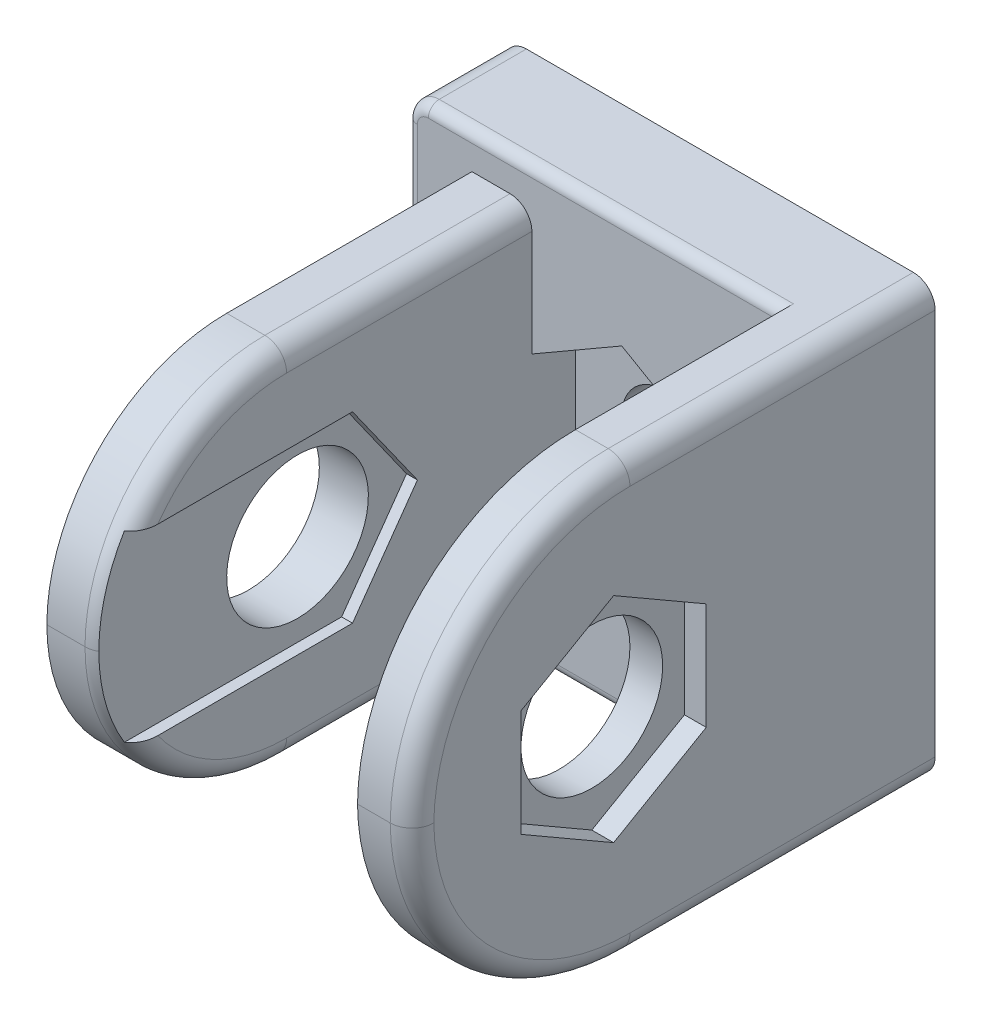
ISO-10303-21;
HEADER;
FILE_DESCRIPTION(('STEP AP214'),'2;1');
FILE_NAME('part.step','',(''),(''),'','','');
FILE_SCHEMA(('AUTOMOTIVE_DESIGN { 1 0 10303 214 1 1 1 1 }'));
ENDSEC;
DATA;
#1=APPLICATION_CONTEXT('core data for automotive mechanical design processes');
#2=APPLICATION_PROTOCOL_DEFINITION('international standard','automotive_design',2000,#1);
#3=PRODUCT_CONTEXT('',#1,'mechanical');
#4=PRODUCT('Part','Part','',(#3));
#5=PRODUCT_RELATED_PRODUCT_CATEGORY('part','',(#4));
#6=PRODUCT_DEFINITION_FORMATION('','',#4);
#7=PRODUCT_DEFINITION_CONTEXT('part definition',#1,'design');
#8=PRODUCT_DEFINITION('design','',#6,#7);
#9=PRODUCT_DEFINITION_SHAPE('','',#8);
#10=(LENGTH_UNIT() NAMED_UNIT(*) SI_UNIT(.MILLI.,.METRE.));
#11=(NAMED_UNIT(*) PLANE_ANGLE_UNIT() SI_UNIT($,.RADIAN.));
#12=(NAMED_UNIT(*) SI_UNIT($,.STERADIAN.) SOLID_ANGLE_UNIT());
#13=UNCERTAINTY_MEASURE_WITH_UNIT(LENGTH_MEASURE(1.E-05),#10,'distance_accuracy_value','');
#14=(GEOMETRIC_REPRESENTATION_CONTEXT(3) GLOBAL_UNCERTAINTY_ASSIGNED_CONTEXT((#13)) GLOBAL_UNIT_ASSIGNED_CONTEXT((#10,
#11,#12)) REPRESENTATION_CONTEXT('',''));
#15=CARTESIAN_POINT('',(0.,0.,0.));
#16=DIRECTION('',(0.,0.,1.));
#17=DIRECTION('',(1.,0.,0.));
#18=AXIS2_PLACEMENT_3D('',#15,#16,#17);
#19=CARTESIAN_POINT('',(0.,0.,9.));
#20=DIRECTION('',(0.,0.,1.));
#21=DIRECTION('',(1.,0.,0.));
#22=AXIS2_PLACEMENT_3D('',#19,#20,#21);
#23=PLANE('',#22);
#24=DIRECTION('',(-0.866025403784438,-0.5,0.));
#25=VECTOR('',#24,1.);
#26=CARTESIAN_POINT('',(0.,9.52627944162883,9.));
#27=LINE('',#26,#25);
#28=CARTESIAN_POINT('',(0.,9.52627944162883,9.));
#29=VERTEX_POINT('',#28);
#30=CARTESIAN_POINT('',(-8.25,4.76313972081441,9.));
#31=VERTEX_POINT('',#30);
#32=EDGE_CURVE('E1265',#29,#31,#27,.T.);
#33=ORIENTED_EDGE('',*,*,#32,.F.);
#34=DIRECTION('',(-0.866025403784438,0.5,0.));
#35=VECTOR('',#34,1.);
#36=CARTESIAN_POINT('',(8.25,4.76313972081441,9.));
#37=LINE('',#36,#35);
#38=CARTESIAN_POINT('',(8.25,4.76313972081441,9.));
#39=VERTEX_POINT('',#38);
#40=EDGE_CURVE('E1271',#39,#29,#37,.T.);
#41=ORIENTED_EDGE('',*,*,#40,.F.);
#42=DIRECTION('',(0.,1.,0.));
#43=VECTOR('',#42,1.);
#44=CARTESIAN_POINT('',(8.25,-4.76313972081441,9.));
#45=LINE('',#44,#43);
#46=CARTESIAN_POINT('',(8.25,-4.76313972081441,9.));
#47=VERTEX_POINT('',#46);
#48=EDGE_CURVE('E1302',#47,#39,#45,.T.);
#49=ORIENTED_EDGE('',*,*,#48,.F.);
#50=DIRECTION('',(0.866025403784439,0.5,0.));
#51=VECTOR('',#50,1.);
#52=CARTESIAN_POINT('',(0.,-9.52627944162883,9.));
#53=LINE('',#52,#51);
#54=CARTESIAN_POINT('',(0.,-9.52627944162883,9.));
#55=VERTEX_POINT('',#54);
#56=EDGE_CURVE('E1298',#55,#47,#53,.T.);
#57=ORIENTED_EDGE('',*,*,#56,.F.);
#58=DIRECTION('',(0.866025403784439,-0.5,0.));
#59=VECTOR('',#58,1.);
#60=CARTESIAN_POINT('',(-8.25,-4.76313972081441,9.));
#61=LINE('',#60,#59);
#62=CARTESIAN_POINT('',(-8.25,-4.76313972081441,9.));
#63=VERTEX_POINT('',#62);
#64=EDGE_CURVE('E1294',#63,#55,#61,.T.);
#65=ORIENTED_EDGE('',*,*,#64,.F.);
#66=DIRECTION('',(0.,1.,0.));
#67=VECTOR('',#66,1.);
#68=CARTESIAN_POINT('',(-8.25,16.5,9.));
#69=LINE('',#68,#67);
#70=CARTESIAN_POINT('',(-8.25,-14.5,9.));
#71=VERTEX_POINT('',#70);
#72=EDGE_CURVE('E1448',#71,#63,#69,.T.);
#73=ORIENTED_EDGE('',*,*,#72,.F.);
#74=CARTESIAN_POINT('',(-10.25,-14.5,9.));
#75=DIRECTION('',(0.,0.,1.));
#76=DIRECTION('',(1.,0.,0.));
#77=AXIS2_PLACEMENT_3D('',#74,#75,#76);
#78=CIRCLE('',#77,2.);
#79=CARTESIAN_POINT('',(-10.25,-16.5,9.));
#80=VERTEX_POINT('',#79);
#81=EDGE_CURVE('E1642',#71,#80,#78,.F.);
#82=ORIENTED_EDGE('',*,*,#81,.T.);
#83=DIRECTION('',(1.,0.,0.));
#84=VECTOR('',#83,1.);
#85=CARTESIAN_POINT('',(-13.75,-16.5,9.));
#86=LINE('',#85,#84);
#87=CARTESIAN_POINT('',(-13.75,-16.5,9.));
#88=VERTEX_POINT('',#87);
#89=EDGE_CURVE('E1459',#88,#80,#86,.T.);
#90=ORIENTED_EDGE('',*,*,#89,.F.);
#91=DIRECTION('',(0.,-1.,0.));
#92=VECTOR('',#91,1.);
#93=CARTESIAN_POINT('',(-13.75,16.5,9.));
#94=LINE('',#93,#92);
#95=CARTESIAN_POINT('',(-13.75,16.5,9.));
#96=VERTEX_POINT('',#95);
#97=EDGE_CURVE('E1455',#96,#88,#94,.T.);
#98=ORIENTED_EDGE('',*,*,#97,.F.);
#99=DIRECTION('',(-1.,0.,0.));
#100=VECTOR('',#99,1.);
#101=CARTESIAN_POINT('',(-13.75,16.5,9.));
#102=LINE('',#101,#100);
#103=CARTESIAN_POINT('',(-10.25,16.5,9.));
#104=VERTEX_POINT('',#103);
#105=EDGE_CURVE('E1451',#104,#96,#102,.T.);
#106=ORIENTED_EDGE('',*,*,#105,.F.);
#107=CARTESIAN_POINT('',(-10.25,14.5,9.));
#108=DIRECTION('',(0.,0.,1.));
#109=DIRECTION('',(1.,0.,0.));
#110=AXIS2_PLACEMENT_3D('',#107,#108,#109);
#111=CIRCLE('',#110,2.);
#112=CARTESIAN_POINT('',(-8.25,14.5,9.));
#113=VERTEX_POINT('',#112);
#114=EDGE_CURVE('E1714',#104,#113,#111,.F.);
#115=ORIENTED_EDGE('',*,*,#114,.T.);
#116=EDGE_CURVE('E1452',#31,#113,#69,.T.);
#117=ORIENTED_EDGE('',*,*,#116,.F.);
#118=EDGE_LOOP('',(#33,#41,#49,#57,#65,#73,#82,#90,#98,#106,#115,#117));
#119=FACE_BOUND('',#118,.T.);
#120=DIRECTION('',(0.,-1.,0.));
#121=VECTOR('',#120,1.);
#122=CARTESIAN_POINT('',(14.75,19.75,9.));
#123=LINE('',#122,#121);
#124=CARTESIAN_POINT('',(14.75,18.75,9.));
#125=VERTEX_POINT('',#124);
#126=CARTESIAN_POINT('',(14.75,-18.75,9.));
#127=VERTEX_POINT('',#126);
#128=EDGE_CURVE('E1470',#125,#127,#123,.T.);
#129=ORIENTED_EDGE('',*,*,#128,.F.);
#130=DIRECTION('',(-1.,0.,0.));
#131=VECTOR('',#130,1.);
#132=CARTESIAN_POINT('',(-17.75,18.75,9.));
#133=LINE('',#132,#131);
#134=CARTESIAN_POINT('',(-17.75,18.75,9.));
#135=VERTEX_POINT('',#134);
#136=EDGE_CURVE('E1652',#125,#135,#133,.T.);
#137=ORIENTED_EDGE('',*,*,#136,.T.);
#138=CARTESIAN_POINT('',(-17.75,17.75,9.));
#139=DIRECTION('',(0.,0.,1.));
#140=DIRECTION('',(1.,0.,0.));
#141=AXIS2_PLACEMENT_3D('',#138,#139,#140);
#142=CIRCLE('',#141,1.);
#143=CARTESIAN_POINT('',(-18.75,17.75,9.));
#144=VERTEX_POINT('',#143);
#145=EDGE_CURVE('E1648',#135,#144,#142,.T.);
#146=ORIENTED_EDGE('',*,*,#145,.T.);
#147=DIRECTION('',(0.,-1.,0.));
#148=VECTOR('',#147,1.);
#149=CARTESIAN_POINT('',(-18.75,-17.75,9.));
#150=LINE('',#149,#148);
#151=CARTESIAN_POINT('',(-18.75,-17.75,9.));
#152=VERTEX_POINT('',#151);
#153=EDGE_CURVE('E1645',#144,#152,#150,.T.);
#154=ORIENTED_EDGE('',*,*,#153,.T.);
#155=CARTESIAN_POINT('',(-17.75,-17.75,9.));
#156=DIRECTION('',(0.,0.,1.));
#157=DIRECTION('',(1.,0.,0.));
#158=AXIS2_PLACEMENT_3D('',#155,#156,#157);
#159=CIRCLE('',#158,1.);
#160=CARTESIAN_POINT('',(-17.75,-18.75,9.));
#161=VERTEX_POINT('',#160);
#162=EDGE_CURVE('E1641',#152,#161,#159,.T.);
#163=ORIENTED_EDGE('',*,*,#162,.T.);
#164=DIRECTION('',(1.,0.,0.));
#165=VECTOR('',#164,1.);
#166=CARTESIAN_POINT('',(14.75,-18.75,9.));
#167=LINE('',#166,#165);
#168=EDGE_CURVE('E1638',#161,#127,#167,.T.);
#169=ORIENTED_EDGE('',*,*,#168,.T.);
#170=EDGE_LOOP('',(#129,#137,#146,#154,#163,#169));
#171=FACE_BOUND('',#170,.T.);
#172=ADVANCED_FACE('F41',(#119,#171),#23,.T.);
#173=CARTESIAN_POINT('',(19.75,19.75,9.));
#174=DIRECTION('',(-1.,0.,0.));
#175=DIRECTION('',(0.,-1.,0.));
#176=AXIS2_PLACEMENT_3D('',#173,#174,#175);
#177=PLANE('',#176);
#178=DIRECTION('',(0.,0.5,-0.866025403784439));
#179=VECTOR('',#178,1.);
#180=CARTESIAN_POINT('',(19.75,-9.81495457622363,29.5005209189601));
#181=LINE('',#180,#179);
#182=CARTESIAN_POINT('',(19.75,-9.81495457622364,29.5005209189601));
#183=VERTEX_POINT('',#182);
#184=CARTESIAN_POINT('',(19.75,-4.90747728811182,21.0005209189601));
#185=VERTEX_POINT('',#184);
#186=EDGE_CURVE('E1410',#183,#185,#181,.T.);
#187=ORIENTED_EDGE('',*,*,#186,.F.);
#188=DIRECTION('',(0.,-0.5,-0.866025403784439));
#189=VECTOR('',#188,1.);
#190=CARTESIAN_POINT('',(19.75,-4.90747728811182,38.0005209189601));
#191=LINE('',#190,#189);
#192=CARTESIAN_POINT('',(19.75,-4.90747728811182,38.0005209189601));
#193=VERTEX_POINT('',#192);
#194=EDGE_CURVE('E1381',#193,#183,#191,.T.);
#195=ORIENTED_EDGE('',*,*,#194,.F.);
#196=DIRECTION('',(0.,-1.,0.));
#197=VECTOR('',#196,1.);
#198=CARTESIAN_POINT('',(19.75,4.90747728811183,38.0005209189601));
#199=LINE('',#198,#197);
#200=CARTESIAN_POINT('',(19.75,4.90747728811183,38.0005209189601));
#201=VERTEX_POINT('',#200);
#202=EDGE_CURVE('E1387',#201,#193,#199,.T.);
#203=ORIENTED_EDGE('',*,*,#202,.F.);
#204=DIRECTION('',(0.,-0.5,0.866025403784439));
#205=VECTOR('',#204,1.);
#206=CARTESIAN_POINT('',(19.75,9.81495457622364,29.5005209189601));
#207=LINE('',#206,#205);
#208=CARTESIAN_POINT('',(19.75,9.81495457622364,29.5005209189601));
#209=VERTEX_POINT('',#208);
#210=EDGE_CURVE('E1422',#209,#201,#207,.T.);
#211=ORIENTED_EDGE('',*,*,#210,.F.);
#212=DIRECTION('',(0.,0.5,0.866025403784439));
#213=VECTOR('',#212,1.);
#214=CARTESIAN_POINT('',(19.75,4.90747728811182,21.0005209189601));
#215=LINE('',#214,#213);
#216=CARTESIAN_POINT('',(19.75,4.90747728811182,21.0005209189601));
#217=VERTEX_POINT('',#216);
#218=EDGE_CURVE('E1418',#217,#209,#215,.T.);
#219=ORIENTED_EDGE('',*,*,#218,.F.);
#220=DIRECTION('',(0.,1.,0.));
#221=VECTOR('',#220,1.);
#222=CARTESIAN_POINT('',(19.75,-4.90747728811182,21.0005209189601));
#223=LINE('',#222,#221);
#224=EDGE_CURVE('E1414',#185,#217,#223,.T.);
#225=ORIENTED_EDGE('',*,*,#224,.F.);
#226=EDGE_LOOP('',(#187,#195,#203,#211,#219,#225));
#227=FACE_BOUND('',#226,.T.);
#228=CARTESIAN_POINT('',(19.75,0.25,28.));
#229=DIRECTION('',(-1.,0.,0.));
#230=DIRECTION('',(0.,-1.,0.));
#231=AXIS2_PLACEMENT_3D('',#228,#229,#230);
#232=CIRCLE('',#231,18.);
#233=CARTESIAN_POINT('',(19.75,0.,45.9982638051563));
#234=VERTEX_POINT('',#233);
#235=CARTESIAN_POINT('',(19.75,-17.75,28.));
#236=VERTEX_POINT('',#235);
#237=EDGE_CURVE('E1702',#234,#236,#232,.F.);
#238=ORIENTED_EDGE('',*,*,#237,.T.);
#239=DIRECTION('',(0.,0.,-1.));
#240=VECTOR('',#239,1.);
#241=CARTESIAN_POINT('',(19.75,-17.75,9.));
#242=LINE('',#241,#240);
#243=CARTESIAN_POINT('',(19.75,-17.75,0.));
#244=VERTEX_POINT('',#243);
#245=EDGE_CURVE('E1698',#236,#244,#242,.T.);
#246=ORIENTED_EDGE('',*,*,#245,.T.);
#247=DIRECTION('',(0.,1.,0.));
#248=VECTOR('',#247,1.);
#249=CARTESIAN_POINT('',(19.75,19.75,0.));
#250=LINE('',#249,#248);
#251=CARTESIAN_POINT('',(19.75,17.75,0.));
#252=VERTEX_POINT('',#251);
#253=EDGE_CURVE('E1478',#244,#252,#250,.T.);
#254=ORIENTED_EDGE('',*,*,#253,.T.);
#255=DIRECTION('',(0.,0.,-1.));
#256=VECTOR('',#255,1.);
#257=CARTESIAN_POINT('',(19.75,17.75,9.));
#258=LINE('',#257,#256);
#259=CARTESIAN_POINT('',(19.75,17.75,28.));
#260=VERTEX_POINT('',#259);
#261=EDGE_CURVE('E1774',#252,#260,#258,.F.);
#262=ORIENTED_EDGE('',*,*,#261,.T.);
#263=CARTESIAN_POINT('',(19.75,-0.25,28.));
#264=DIRECTION('',(-1.,0.,0.));
#265=DIRECTION('',(0.,-1.,0.));
#266=AXIS2_PLACEMENT_3D('',#263,#264,#265);
#267=CIRCLE('',#266,18.);
#268=EDGE_CURVE('E1776',#260,#234,#267,.F.);
#269=ORIENTED_EDGE('',*,*,#268,.T.);
#270=EDGE_LOOP('',(#238,#246,#254,#262,#269));
#271=FACE_BOUND('',#270,.T.);
#272=ADVANCED_FACE('F1860',(#227,#271),#177,.F.);
#273=CARTESIAN_POINT('',(-19.75,19.75,9.));
#274=DIRECTION('',(0.,-1.,0.));
#275=DIRECTION('',(0.,0.,-1.));
#276=AXIS2_PLACEMENT_3D('',#273,#274,#275);
#277=PLANE('',#276);
#278=DIRECTION('',(0.,0.,-1.));
#279=VECTOR('',#278,1.);
#280=CARTESIAN_POINT('',(-17.75,19.75,9.));
#281=LINE('',#280,#279);
#282=CARTESIAN_POINT('',(-17.75,19.75,0.));
#283=VERTEX_POINT('',#282);
#284=CARTESIAN_POINT('',(-17.75,19.75,8.));
#285=VERTEX_POINT('',#284);
#286=EDGE_CURVE('E1809',#283,#285,#281,.F.);
#287=ORIENTED_EDGE('',*,*,#286,.T.);
#288=DIRECTION('',(-1.,0.,0.));
#289=VECTOR('',#288,1.);
#290=CARTESIAN_POINT('',(14.75,19.75,8.));
#291=LINE('',#290,#289);
#292=CARTESIAN_POINT('',(14.75,19.75,8.));
#293=VERTEX_POINT('',#292);
#294=EDGE_CURVE('E1661',#285,#293,#291,.F.);
#295=ORIENTED_EDGE('',*,*,#294,.T.);
#296=DIRECTION('',(0.,0.,-1.));
#297=VECTOR('',#296,1.);
#298=CARTESIAN_POINT('',(14.75,19.75,48.));
#299=LINE('',#298,#297);
#300=CARTESIAN_POINT('',(14.75,19.75,28.));
#301=VERTEX_POINT('',#300);
#302=EDGE_CURVE('E66',#301,#293,#299,.T.);
#303=ORIENTED_EDGE('',*,*,#302,.F.);
#304=DIRECTION('',(-1.,0.,0.));
#305=VECTOR('',#304,1.);
#306=CARTESIAN_POINT('',(19.75,19.75,28.));
#307=LINE('',#306,#305);
#308=CARTESIAN_POINT('',(17.75,19.75,28.));
#309=VERTEX_POINT('',#308);
#310=EDGE_CURVE('E1500',#301,#309,#307,.F.);
#311=ORIENTED_EDGE('',*,*,#310,.T.);
#312=DIRECTION('',(0.,0.,-1.));
#313=VECTOR('',#312,1.);
#314=CARTESIAN_POINT('',(17.75,19.75,9.));
#315=LINE('',#314,#313);
#316=CARTESIAN_POINT('',(17.75,19.75,0.));
#317=VERTEX_POINT('',#316);
#318=EDGE_CURVE('E1806',#309,#317,#315,.T.);
#319=ORIENTED_EDGE('',*,*,#318,.T.);
#320=DIRECTION('',(-1.,0.,0.));
#321=VECTOR('',#320,1.);
#322=CARTESIAN_POINT('',(-19.75,19.75,0.));
#323=LINE('',#322,#321);
#324=EDGE_CURVE('E1482',#317,#283,#323,.T.);
#325=ORIENTED_EDGE('',*,*,#324,.T.);
#326=EDGE_LOOP('',(#287,#295,#303,#311,#319,#325));
#327=FACE_BOUND('',#326,.T.);
#328=ADVANCED_FACE('F1865',(#327),#277,.F.);
#329=CARTESIAN_POINT('',(-19.75,19.75,9.));
#330=DIRECTION('',(1.,0.,0.));
#331=DIRECTION('',(0.,1.,0.));
#332=AXIS2_PLACEMENT_3D('',#329,#330,#331);
#333=PLANE('',#332);
#334=DIRECTION('',(0.,0.,-1.));
#335=VECTOR('',#334,1.);
#336=CARTESIAN_POINT('',(-19.75,-17.75,9.));
#337=LINE('',#336,#335);
#338=CARTESIAN_POINT('',(-19.75,-17.75,0.));
#339=VERTEX_POINT('',#338);
#340=CARTESIAN_POINT('',(-19.75,-17.75,8.));
#341=VERTEX_POINT('',#340);
#342=EDGE_CURVE('E1802',#339,#341,#337,.F.);
#343=ORIENTED_EDGE('',*,*,#342,.T.);
#344=DIRECTION('',(0.,-1.,0.));
#345=VECTOR('',#344,1.);
#346=CARTESIAN_POINT('',(-19.75,17.75,8.));
#347=LINE('',#346,#345);
#348=CARTESIAN_POINT('',(-19.75,17.75,8.));
#349=VERTEX_POINT('',#348);
#350=EDGE_CURVE('E1664',#341,#349,#347,.F.);
#351=ORIENTED_EDGE('',*,*,#350,.T.);
#352=DIRECTION('',(0.,0.,-1.));
#353=VECTOR('',#352,1.);
#354=CARTESIAN_POINT('',(-19.75,17.75,9.));
#355=LINE('',#354,#353);
#356=CARTESIAN_POINT('',(-19.75,17.75,0.));
#357=VERTEX_POINT('',#356);
#358=EDGE_CURVE('E1799',#349,#357,#355,.T.);
#359=ORIENTED_EDGE('',*,*,#358,.T.);
#360=DIRECTION('',(0.,-1.,0.));
#361=VECTOR('',#360,1.);
#362=CARTESIAN_POINT('',(-19.75,19.75,0.));
#363=LINE('',#362,#361);
#364=EDGE_CURVE('E1486',#357,#339,#363,.T.);
#365=ORIENTED_EDGE('',*,*,#364,.T.);
#366=EDGE_LOOP('',(#343,#351,#359,#365));
#367=FACE_BOUND('',#366,.T.);
#368=ADVANCED_FACE('F1879',(#367),#333,.F.);
#369=CARTESIAN_POINT('',(-19.75,-19.75,9.));
#370=DIRECTION('',(0.,1.,0.));
#371=DIRECTION('',(0.,0.,1.));
#372=AXIS2_PLACEMENT_3D('',#369,#370,#371);
#373=PLANE('',#372);
#374=DIRECTION('',(0.,0.,-1.));
#375=VECTOR('',#374,1.);
#376=CARTESIAN_POINT('',(14.75,-19.75,48.));
#377=LINE('',#376,#375);
#378=CARTESIAN_POINT('',(14.75,-19.75,28.));
#379=VERTEX_POINT('',#378);
#380=CARTESIAN_POINT('',(14.75,-19.75,8.));
#381=VERTEX_POINT('',#380);
#382=EDGE_CURVE('E59',#379,#381,#377,.T.);
#383=ORIENTED_EDGE('',*,*,#382,.T.);
#384=DIRECTION('',(1.,0.,0.));
#385=VECTOR('',#384,1.);
#386=CARTESIAN_POINT('',(-17.75,-19.75,8.));
#387=LINE('',#386,#385);
#388=CARTESIAN_POINT('',(-17.75,-19.75,8.));
#389=VERTEX_POINT('',#388);
#390=EDGE_CURVE('E1667',#381,#389,#387,.F.);
#391=ORIENTED_EDGE('',*,*,#390,.T.);
#392=DIRECTION('',(0.,0.,-1.));
#393=VECTOR('',#392,1.);
#394=CARTESIAN_POINT('',(-17.75,-19.75,9.));
#395=LINE('',#394,#393);
#396=CARTESIAN_POINT('',(-17.75,-19.75,0.));
#397=VERTEX_POINT('',#396);
#398=EDGE_CURVE('E1794',#389,#397,#395,.T.);
#399=ORIENTED_EDGE('',*,*,#398,.T.);
#400=DIRECTION('',(1.,0.,0.));
#401=VECTOR('',#400,1.);
#402=CARTESIAN_POINT('',(-19.75,-19.75,0.));
#403=LINE('',#402,#401);
#404=CARTESIAN_POINT('',(17.75,-19.75,0.));
#405=VERTEX_POINT('',#404);
#406=EDGE_CURVE('E1490',#397,#405,#403,.T.);
#407=ORIENTED_EDGE('',*,*,#406,.T.);
#408=DIRECTION('',(0.,0.,-1.));
#409=VECTOR('',#408,1.);
#410=CARTESIAN_POINT('',(17.75,-19.75,9.));
#411=LINE('',#410,#409);
#412=CARTESIAN_POINT('',(17.75,-19.75,28.));
#413=VERTEX_POINT('',#412);
#414=EDGE_CURVE('E1696',#405,#413,#411,.F.);
#415=ORIENTED_EDGE('',*,*,#414,.T.);
#416=DIRECTION('',(1.,0.,0.));
#417=VECTOR('',#416,1.);
#418=CARTESIAN_POINT('',(14.75,-19.75,28.));
#419=LINE('',#418,#417);
#420=EDGE_CURVE('E1504',#413,#379,#419,.F.);
#421=ORIENTED_EDGE('',*,*,#420,.T.);
#422=EDGE_LOOP('',(#383,#391,#399,#407,#415,#421));
#423=FACE_BOUND('',#422,.T.);
#424=ADVANCED_FACE('F1875',(#423),#373,.F.);
#425=CARTESIAN_POINT('',(0.,0.,0.));
#426=DIRECTION('',(0.,0.,1.));
#427=DIRECTION('',(1.,0.,0.));
#428=AXIS2_PLACEMENT_3D('',#425,#426,#427);
#429=PLANE('',#428);
#430=CARTESIAN_POINT('',(7.,14.75,0.));
#431=DIRECTION('',(0.,0.,-1.));
#432=DIRECTION('',(1.,0.,0.));
#433=AXIS2_PLACEMENT_3D('',#430,#431,#432);
#434=CIRCLE('',#433,0.999999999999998);
#435=CARTESIAN_POINT('',(8.,14.75,0.));
#436=VERTEX_POINT('',#435);
#437=CARTESIAN_POINT('',(7.,13.75,0.));
#438=VERTEX_POINT('',#437);
#439=EDGE_CURVE('E710',#436,#438,#434,.T.);
#440=ORIENTED_EDGE('',*,*,#439,.F.);
#441=DIRECTION('',(0.,-1.,0.));
#442=VECTOR('',#441,1.);
#443=CARTESIAN_POINT('',(8.,14.75,0.));
#444=LINE('',#443,#442);
#445=CARTESIAN_POINT('',(8.,17.75,0.));
#446=VERTEX_POINT('',#445);
#447=EDGE_CURVE('E637',#446,#436,#444,.T.);
#448=ORIENTED_EDGE('',*,*,#447,.F.);
#449=DIRECTION('',(1.,0.,0.));
#450=VECTOR('',#449,1.);
#451=CARTESIAN_POINT('',(8.,17.75,0.));
#452=LINE('',#451,#450);
#453=CARTESIAN_POINT('',(-8.,17.75,0.));
#454=VERTEX_POINT('',#453);
#455=EDGE_CURVE('E658',#454,#446,#452,.T.);
#456=ORIENTED_EDGE('',*,*,#455,.F.);
#457=DIRECTION('',(0.,1.,0.));
#458=VECTOR('',#457,1.);
#459=CARTESIAN_POINT('',(-8.,17.75,0.));
#460=LINE('',#459,#458);
#461=CARTESIAN_POINT('',(-8.,14.75,0.));
#462=VERTEX_POINT('',#461);
#463=EDGE_CURVE('E662',#462,#454,#460,.T.);
#464=ORIENTED_EDGE('',*,*,#463,.F.);
#465=CARTESIAN_POINT('',(-7.,14.75,0.));
#466=DIRECTION('',(0.,0.,-1.));
#467=DIRECTION('',(1.,0.,0.));
#468=AXIS2_PLACEMENT_3D('',#465,#466,#467);
#469=CIRCLE('',#468,0.999999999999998);
#470=CARTESIAN_POINT('',(-7.,13.75,0.));
#471=VERTEX_POINT('',#470);
#472=EDGE_CURVE('E750',#471,#462,#469,.T.);
#473=ORIENTED_EDGE('',*,*,#472,.F.);
#474=DIRECTION('',(-1.,0.,0.));
#475=VECTOR('',#474,1.);
#476=CARTESIAN_POINT('',(-7.,13.75,0.));
#477=LINE('',#476,#475);
#478=CARTESIAN_POINT('',(-5.,13.75,0.));
#479=VERTEX_POINT('',#478);
#480=EDGE_CURVE('E746',#479,#471,#477,.T.);
#481=ORIENTED_EDGE('',*,*,#480,.F.);
#482=CARTESIAN_POINT('',(-5.,12.75,0.));
#483=DIRECTION('',(0.,0.,1.));
#484=DIRECTION('',(-1.,0.,0.));
#485=AXIS2_PLACEMENT_3D('',#482,#483,#484);
#486=CIRCLE('',#485,1.);
#487=CARTESIAN_POINT('',(-4.,12.75,0.));
#488=VERTEX_POINT('',#487);
#489=EDGE_CURVE('E742',#488,#479,#486,.T.);
#490=ORIENTED_EDGE('',*,*,#489,.F.);
#491=DIRECTION('',(0.,1.,0.));
#492=VECTOR('',#491,1.);
#493=CARTESIAN_POINT('',(-4.,12.75,0.));
#494=LINE('',#493,#492);
#495=CARTESIAN_POINT('',(-4.,10.75,0.));
#496=VERTEX_POINT('',#495);
#497=EDGE_CURVE('E738',#496,#488,#494,.T.);
#498=ORIENTED_EDGE('',*,*,#497,.F.);
#499=CARTESIAN_POINT('',(-3.,10.75,0.));
#500=DIRECTION('',(0.,0.,-1.));
#501=DIRECTION('',(1.,0.,0.));
#502=AXIS2_PLACEMENT_3D('',#499,#500,#501);
#503=CIRCLE('',#502,1.);
#504=CARTESIAN_POINT('',(-3.,9.75,0.));
#505=VERTEX_POINT('',#504);
#506=EDGE_CURVE('E734',#505,#496,#503,.T.);
#507=ORIENTED_EDGE('',*,*,#506,.F.);
#508=DIRECTION('',(-1.,0.,0.));
#509=VECTOR('',#508,1.);
#510=CARTESIAN_POINT('',(-3.,9.75,0.));
#511=LINE('',#510,#509);
#512=CARTESIAN_POINT('',(3.,9.75,0.));
#513=VERTEX_POINT('',#512);
#514=EDGE_CURVE('E730',#513,#505,#511,.T.);
#515=ORIENTED_EDGE('',*,*,#514,.F.);
#516=CARTESIAN_POINT('',(3.,10.75,0.));
#517=DIRECTION('',(0.,0.,-1.));
#518=DIRECTION('',(1.,0.,0.));
#519=AXIS2_PLACEMENT_3D('',#516,#517,#518);
#520=CIRCLE('',#519,1.);
#521=CARTESIAN_POINT('',(4.,10.75,0.));
#522=VERTEX_POINT('',#521);
#523=EDGE_CURVE('E726',#522,#513,#520,.T.);
#524=ORIENTED_EDGE('',*,*,#523,.F.);
#525=DIRECTION('',(0.,-1.,0.));
#526=VECTOR('',#525,1.);
#527=CARTESIAN_POINT('',(4.,10.75,0.));
#528=LINE('',#527,#526);
#529=CARTESIAN_POINT('',(4.,12.75,0.));
#530=VERTEX_POINT('',#529);
#531=EDGE_CURVE('E722',#530,#522,#528,.T.);
#532=ORIENTED_EDGE('',*,*,#531,.F.);
#533=CARTESIAN_POINT('',(5.,12.75,0.));
#534=DIRECTION('',(0.,0.,1.));
#535=DIRECTION('',(-1.,0.,0.));
#536=AXIS2_PLACEMENT_3D('',#533,#534,#535);
#537=CIRCLE('',#536,1.);
#538=CARTESIAN_POINT('',(5.,13.75,0.));
#539=VERTEX_POINT('',#538);
#540=EDGE_CURVE('E718',#539,#530,#537,.T.);
#541=ORIENTED_EDGE('',*,*,#540,.F.);
#542=DIRECTION('',(-1.,0.,0.));
#543=VECTOR('',#542,1.);
#544=CARTESIAN_POINT('',(5.,13.75,0.));
#545=LINE('',#544,#543);
#546=EDGE_CURVE('E714',#438,#539,#545,.T.);
#547=ORIENTED_EDGE('',*,*,#546,.F.);
#548=EDGE_LOOP('',(#440,#448,#456,#464,#473,#481,#490,#498,#507,#515,#524,#532,#541,#547));
#549=FACE_BOUND('',#548,.T.);
#550=CARTESIAN_POINT('',(-14.75,6.99999999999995,0.));
#551=DIRECTION('',(0.,0.,-1.));
#552=DIRECTION('',(1.,0.,0.));
#553=AXIS2_PLACEMENT_3D('',#550,#551,#552);
#554=CIRCLE('',#553,0.999999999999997);
#555=CARTESIAN_POINT('',(-14.75,7.99999999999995,0.));
#556=VERTEX_POINT('',#555);
#557=CARTESIAN_POINT('',(-13.75,6.99999999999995,0.));
#558=VERTEX_POINT('',#557);
#559=EDGE_CURVE('E857',#556,#558,#554,.T.);
#560=ORIENTED_EDGE('',*,*,#559,.F.);
#561=DIRECTION('',(1.,0.,0.));
#562=VECTOR('',#561,1.);
#563=CARTESIAN_POINT('',(-14.75,7.99999999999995,0.));
#564=LINE('',#563,#562);
#565=CARTESIAN_POINT('',(-17.75,7.99999999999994,0.));
#566=VERTEX_POINT('',#565);
#567=EDGE_CURVE('E854',#566,#556,#564,.T.);
#568=ORIENTED_EDGE('',*,*,#567,.F.);
#569=DIRECTION('',(0.,1.,0.));
#570=VECTOR('',#569,1.);
#571=CARTESIAN_POINT('',(-17.75,7.99999999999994,0.));
#572=LINE('',#571,#570);
#573=CARTESIAN_POINT('',(-17.75,-8.00000000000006,0.));
#574=VERTEX_POINT('',#573);
#575=EDGE_CURVE('E801',#574,#566,#572,.T.);
#576=ORIENTED_EDGE('',*,*,#575,.F.);
#577=DIRECTION('',(-1.,0.,0.));
#578=VECTOR('',#577,1.);
#579=CARTESIAN_POINT('',(-17.75,-8.00000000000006,0.));
#580=LINE('',#579,#578);
#581=CARTESIAN_POINT('',(-14.75,-8.00000000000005,0.));
#582=VERTEX_POINT('',#581);
#583=EDGE_CURVE('E902',#582,#574,#580,.T.);
#584=ORIENTED_EDGE('',*,*,#583,.F.);
#585=CARTESIAN_POINT('',(-14.75,-7.00000000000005,0.));
#586=DIRECTION('',(0.,0.,-1.));
#587=DIRECTION('',(1.,0.,0.));
#588=AXIS2_PLACEMENT_3D('',#585,#586,#587);
#589=CIRCLE('',#588,0.999999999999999);
#590=CARTESIAN_POINT('',(-13.75,-7.00000000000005,0.));
#591=VERTEX_POINT('',#590);
#592=EDGE_CURVE('E898',#591,#582,#589,.T.);
#593=ORIENTED_EDGE('',*,*,#592,.F.);
#594=DIRECTION('',(0.,-1.,0.));
#595=VECTOR('',#594,1.);
#596=CARTESIAN_POINT('',(-13.75,-7.00000000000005,0.));
#597=LINE('',#596,#595);
#598=CARTESIAN_POINT('',(-13.75,-5.00000000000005,0.));
#599=VERTEX_POINT('',#598);
#600=EDGE_CURVE('E894',#599,#591,#597,.T.);
#601=ORIENTED_EDGE('',*,*,#600,.F.);
#602=CARTESIAN_POINT('',(-12.75,-5.00000000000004,0.));
#603=DIRECTION('',(0.,0.,1.));
#604=DIRECTION('',(-1.,0.,0.));
#605=AXIS2_PLACEMENT_3D('',#602,#603,#604);
#606=CIRCLE('',#605,1.);
#607=CARTESIAN_POINT('',(-12.75,-4.00000000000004,0.));
#608=VERTEX_POINT('',#607);
#609=EDGE_CURVE('E890',#608,#599,#606,.T.);
#610=ORIENTED_EDGE('',*,*,#609,.F.);
#611=DIRECTION('',(-1.,0.,0.));
#612=VECTOR('',#611,1.);
#613=CARTESIAN_POINT('',(-12.75,-4.00000000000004,0.));
#614=LINE('',#613,#612);
#615=CARTESIAN_POINT('',(-10.75,-4.00000000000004,0.));
#616=VERTEX_POINT('',#615);
#617=EDGE_CURVE('E886',#616,#608,#614,.T.);
#618=ORIENTED_EDGE('',*,*,#617,.F.);
#619=CARTESIAN_POINT('',(-10.75,-3.00000000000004,0.));
#620=DIRECTION('',(0.,0.,-1.));
#621=DIRECTION('',(1.,0.,0.));
#622=AXIS2_PLACEMENT_3D('',#619,#620,#621);
#623=CIRCLE('',#622,1.);
#624=CARTESIAN_POINT('',(-9.74999999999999,-3.00000000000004,0.));
#625=VERTEX_POINT('',#624);
#626=EDGE_CURVE('E882',#625,#616,#623,.T.);
#627=ORIENTED_EDGE('',*,*,#626,.F.);
#628=DIRECTION('',(0.,-1.,0.));
#629=VECTOR('',#628,1.);
#630=CARTESIAN_POINT('',(-9.74999999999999,-3.00000000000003,0.));
#631=LINE('',#630,#629);
#632=CARTESIAN_POINT('',(-9.75000000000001,2.99999999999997,0.));
#633=VERTEX_POINT('',#632);
#634=EDGE_CURVE('E878',#633,#625,#631,.T.);
#635=ORIENTED_EDGE('',*,*,#634,.F.);
#636=CARTESIAN_POINT('',(-10.75,2.99999999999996,0.));
#637=DIRECTION('',(0.,0.,-1.));
#638=DIRECTION('',(1.,0.,0.));
#639=AXIS2_PLACEMENT_3D('',#636,#637,#638);
#640=CIRCLE('',#639,1.);
#641=CARTESIAN_POINT('',(-10.75,3.99999999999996,0.));
#642=VERTEX_POINT('',#641);
#643=EDGE_CURVE('E874',#642,#633,#640,.T.);
#644=ORIENTED_EDGE('',*,*,#643,.F.);
#645=DIRECTION('',(1.,0.,0.));
#646=VECTOR('',#645,1.);
#647=CARTESIAN_POINT('',(-10.75,3.99999999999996,0.));
#648=LINE('',#647,#646);
#649=CARTESIAN_POINT('',(-12.75,3.99999999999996,0.));
#650=VERTEX_POINT('',#649);
#651=EDGE_CURVE('E870',#650,#642,#648,.T.);
#652=ORIENTED_EDGE('',*,*,#651,.F.);
#653=CARTESIAN_POINT('',(-12.75,4.99999999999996,0.));
#654=DIRECTION('',(0.,0.,1.));
#655=DIRECTION('',(-1.,0.,0.));
#656=AXIS2_PLACEMENT_3D('',#653,#654,#655);
#657=CIRCLE('',#656,1.);
#658=CARTESIAN_POINT('',(-13.75,4.99999999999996,0.));
#659=VERTEX_POINT('',#658);
#660=EDGE_CURVE('E866',#659,#650,#657,.T.);
#661=ORIENTED_EDGE('',*,*,#660,.F.);
#662=DIRECTION('',(0.,-1.,0.));
#663=VECTOR('',#662,1.);
#664=CARTESIAN_POINT('',(-13.75,4.99999999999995,0.));
#665=LINE('',#664,#663);
#666=EDGE_CURVE('E862',#558,#659,#665,.T.);
#667=ORIENTED_EDGE('',*,*,#666,.F.);
#668=EDGE_LOOP('',(#560,#568,#576,#584,#593,#601,#610,#618,#627,#635,#644,#652,#661,#667));
#669=FACE_BOUND('',#668,.T.);
#670=CARTESIAN_POINT('',(-6.9999999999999,-14.75,0.));
#671=DIRECTION('',(0.,0.,-1.));
#672=DIRECTION('',(1.,0.,0.));
#673=AXIS2_PLACEMENT_3D('',#670,#671,#672);
#674=CIRCLE('',#673,0.999999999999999);
#675=CARTESIAN_POINT('',(-7.9999999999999,-14.7500000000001,0.));
#676=VERTEX_POINT('',#675);
#677=CARTESIAN_POINT('',(-6.9999999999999,-13.7500000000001,0.));
#678=VERTEX_POINT('',#677);
#679=EDGE_CURVE('E1011',#676,#678,#674,.T.);
#680=ORIENTED_EDGE('',*,*,#679,.F.);
#681=DIRECTION('',(0.,1.,0.));
#682=VECTOR('',#681,1.);
#683=CARTESIAN_POINT('',(-7.9999999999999,-14.7500000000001,0.));
#684=LINE('',#683,#682);
#685=CARTESIAN_POINT('',(-7.99999999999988,-17.7500000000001,0.));
#686=VERTEX_POINT('',#685);
#687=EDGE_CURVE('E1008',#686,#676,#684,.T.);
#688=ORIENTED_EDGE('',*,*,#687,.F.);
#689=DIRECTION('',(-1.,0.,0.));
#690=VECTOR('',#689,1.);
#691=CARTESIAN_POINT('',(-7.99999999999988,-17.7500000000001,0.));
#692=LINE('',#691,#690);
#693=CARTESIAN_POINT('',(8.00000000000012,-17.75,0.));
#694=VERTEX_POINT('',#693);
#695=EDGE_CURVE('E955',#694,#686,#692,.T.);
#696=ORIENTED_EDGE('',*,*,#695,.F.);
#697=DIRECTION('',(0.,-1.,0.));
#698=VECTOR('',#697,1.);
#699=CARTESIAN_POINT('',(8.00000000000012,-17.75,0.));
#700=LINE('',#699,#698);
#701=CARTESIAN_POINT('',(8.0000000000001,-14.7499999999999,0.));
#702=VERTEX_POINT('',#701);
#703=EDGE_CURVE('E1056',#702,#694,#700,.T.);
#704=ORIENTED_EDGE('',*,*,#703,.F.);
#705=CARTESIAN_POINT('',(7.0000000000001,-14.75,0.));
#706=DIRECTION('',(0.,0.,-1.));
#707=DIRECTION('',(1.,0.,0.));
#708=AXIS2_PLACEMENT_3D('',#705,#706,#707);
#709=CIRCLE('',#708,0.999999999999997);
#710=CARTESIAN_POINT('',(7.0000000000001,-13.75,0.));
#711=VERTEX_POINT('',#710);
#712=EDGE_CURVE('E1052',#711,#702,#709,.T.);
#713=ORIENTED_EDGE('',*,*,#712,.F.);
#714=DIRECTION('',(1.,0.,0.));
#715=VECTOR('',#714,1.);
#716=CARTESIAN_POINT('',(7.0000000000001,-13.75,0.));
#717=LINE('',#716,#715);
#718=CARTESIAN_POINT('',(5.0000000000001,-13.75,0.));
#719=VERTEX_POINT('',#718);
#720=EDGE_CURVE('E1048',#719,#711,#717,.T.);
#721=ORIENTED_EDGE('',*,*,#720,.F.);
#722=CARTESIAN_POINT('',(5.00000000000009,-12.75,0.));
#723=DIRECTION('',(0.,0.,1.));
#724=DIRECTION('',(-1.,0.,0.));
#725=AXIS2_PLACEMENT_3D('',#722,#723,#724);
#726=CIRCLE('',#725,1.);
#727=CARTESIAN_POINT('',(4.00000000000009,-12.75,0.));
#728=VERTEX_POINT('',#727);
#729=EDGE_CURVE('E1044',#728,#719,#726,.T.);
#730=ORIENTED_EDGE('',*,*,#729,.F.);
#731=DIRECTION('',(0.,-1.,0.));
#732=VECTOR('',#731,1.);
#733=CARTESIAN_POINT('',(4.00000000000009,-12.75,0.));
#734=LINE('',#733,#732);
#735=CARTESIAN_POINT('',(4.00000000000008,-10.75,0.));
#736=VERTEX_POINT('',#735);
#737=EDGE_CURVE('E1040',#736,#728,#734,.T.);
#738=ORIENTED_EDGE('',*,*,#737,.F.);
#739=CARTESIAN_POINT('',(3.00000000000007,-10.75,0.));
#740=DIRECTION('',(0.,0.,-1.));
#741=DIRECTION('',(1.,0.,0.));
#742=AXIS2_PLACEMENT_3D('',#739,#740,#741);
#743=CIRCLE('',#742,1.);
#744=CARTESIAN_POINT('',(3.00000000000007,-9.74999999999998,0.));
#745=VERTEX_POINT('',#744);
#746=EDGE_CURVE('E1036',#745,#736,#743,.T.);
#747=ORIENTED_EDGE('',*,*,#746,.F.);
#748=DIRECTION('',(1.,0.,0.));
#749=VECTOR('',#748,1.);
#750=CARTESIAN_POINT('',(3.00000000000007,-9.74999999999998,0.));
#751=LINE('',#750,#749);
#752=CARTESIAN_POINT('',(-2.99999999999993,-9.75000000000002,0.));
#753=VERTEX_POINT('',#752);
#754=EDGE_CURVE('E1032',#753,#745,#751,.T.);
#755=ORIENTED_EDGE('',*,*,#754,.F.);
#756=CARTESIAN_POINT('',(-2.99999999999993,-10.75,0.));
#757=DIRECTION('',(0.,0.,-1.));
#758=DIRECTION('',(1.,0.,0.));
#759=AXIS2_PLACEMENT_3D('',#756,#757,#758);
#760=CIRCLE('',#759,1.);
#761=CARTESIAN_POINT('',(-3.99999999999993,-10.75,0.));
#762=VERTEX_POINT('',#761);
#763=EDGE_CURVE('E1028',#762,#753,#760,.T.);
#764=ORIENTED_EDGE('',*,*,#763,.F.);
#765=DIRECTION('',(0.,1.,0.));
#766=VECTOR('',#765,1.);
#767=CARTESIAN_POINT('',(-3.99999999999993,-10.75,0.));
#768=LINE('',#767,#766);
#769=CARTESIAN_POINT('',(-3.99999999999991,-12.75,0.));
#770=VERTEX_POINT('',#769);
#771=EDGE_CURVE('E1024',#770,#762,#768,.T.);
#772=ORIENTED_EDGE('',*,*,#771,.F.);
#773=CARTESIAN_POINT('',(-4.99999999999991,-12.75,0.));
#774=DIRECTION('',(0.,0.,1.));
#775=DIRECTION('',(-1.,0.,0.));
#776=AXIS2_PLACEMENT_3D('',#773,#774,#775);
#777=CIRCLE('',#776,1.);
#778=CARTESIAN_POINT('',(-4.9999999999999,-13.75,0.));
#779=VERTEX_POINT('',#778);
#780=EDGE_CURVE('E1020',#779,#770,#777,.T.);
#781=ORIENTED_EDGE('',*,*,#780,.F.);
#782=DIRECTION('',(1.,0.,0.));
#783=VECTOR('',#782,1.);
#784=CARTESIAN_POINT('',(-4.9999999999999,-13.75,0.));
#785=LINE('',#784,#783);
#786=EDGE_CURVE('E1016',#678,#779,#785,.T.);
#787=ORIENTED_EDGE('',*,*,#786,.F.);
#788=EDGE_LOOP('',(#680,#688,#696,#704,#713,#721,#730,#738,#747,#755,#764,#772,#781,#787));
#789=FACE_BOUND('',#788,.T.);
#790=CARTESIAN_POINT('',(14.7500000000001,-6.99999999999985,0.));
#791=DIRECTION('',(0.,0.,-1.));
#792=DIRECTION('',(1.,0.,0.));
#793=AXIS2_PLACEMENT_3D('',#790,#791,#792);
#794=CIRCLE('',#793,0.999999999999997);
#795=CARTESIAN_POINT('',(14.7500000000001,-7.99999999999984,0.));
#796=VERTEX_POINT('',#795);
#797=CARTESIAN_POINT('',(13.7500000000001,-6.99999999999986,0.));
#798=VERTEX_POINT('',#797);
#799=EDGE_CURVE('E1165',#796,#798,#794,.T.);
#800=ORIENTED_EDGE('',*,*,#799,.F.);
#801=DIRECTION('',(-1.,0.,0.));
#802=VECTOR('',#801,1.);
#803=CARTESIAN_POINT('',(14.7500000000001,-7.99999999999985,0.));
#804=LINE('',#803,#802);
#805=CARTESIAN_POINT('',(17.7500000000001,-7.99999999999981,0.));
#806=VERTEX_POINT('',#805);
#807=EDGE_CURVE('E1162',#806,#796,#804,.T.);
#808=ORIENTED_EDGE('',*,*,#807,.F.);
#809=DIRECTION('',(0.,-1.,0.));
#810=VECTOR('',#809,1.);
#811=CARTESIAN_POINT('',(17.7500000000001,-7.99999999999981,0.));
#812=LINE('',#811,#810);
#813=CARTESIAN_POINT('',(17.7499999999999,8.00000000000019,0.));
#814=VERTEX_POINT('',#813);
#815=EDGE_CURVE('E1109',#814,#806,#812,.T.);
#816=ORIENTED_EDGE('',*,*,#815,.F.);
#817=DIRECTION('',(1.,0.,0.));
#818=VECTOR('',#817,1.);
#819=CARTESIAN_POINT('',(17.7499999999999,8.00000000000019,0.));
#820=LINE('',#819,#818);
#821=CARTESIAN_POINT('',(14.7499999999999,8.00000000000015,0.));
#822=VERTEX_POINT('',#821);
#823=EDGE_CURVE('E1210',#822,#814,#820,.T.);
#824=ORIENTED_EDGE('',*,*,#823,.F.);
#825=CARTESIAN_POINT('',(14.7499999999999,7.00000000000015,0.));
#826=DIRECTION('',(0.,0.,-1.));
#827=DIRECTION('',(1.,0.,0.));
#828=AXIS2_PLACEMENT_3D('',#825,#826,#827);
#829=CIRCLE('',#828,0.999999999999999);
#830=CARTESIAN_POINT('',(13.7499999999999,7.00000000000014,0.));
#831=VERTEX_POINT('',#830);
#832=EDGE_CURVE('E1206',#831,#822,#829,.T.);
#833=ORIENTED_EDGE('',*,*,#832,.F.);
#834=DIRECTION('',(0.,1.,0.));
#835=VECTOR('',#834,1.);
#836=CARTESIAN_POINT('',(13.7499999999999,7.00000000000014,0.));
#837=LINE('',#836,#835);
#838=CARTESIAN_POINT('',(13.75,5.00000000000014,0.));
#839=VERTEX_POINT('',#838);
#840=EDGE_CURVE('E1202',#839,#831,#837,.T.);
#841=ORIENTED_EDGE('',*,*,#840,.F.);
#842=CARTESIAN_POINT('',(12.75,5.00000000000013,0.));
#843=DIRECTION('',(0.,0.,1.));
#844=DIRECTION('',(-1.,0.,0.));
#845=AXIS2_PLACEMENT_3D('',#842,#843,#844);
#846=CIRCLE('',#845,1.);
#847=CARTESIAN_POINT('',(12.75,4.00000000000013,0.));
#848=VERTEX_POINT('',#847);
#849=EDGE_CURVE('E1198',#848,#839,#846,.T.);
#850=ORIENTED_EDGE('',*,*,#849,.F.);
#851=DIRECTION('',(1.,0.,0.));
#852=VECTOR('',#851,1.);
#853=CARTESIAN_POINT('',(12.75,4.00000000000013,0.));
#854=LINE('',#853,#852);
#855=CARTESIAN_POINT('',(10.75,4.00000000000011,0.));
#856=VERTEX_POINT('',#855);
#857=EDGE_CURVE('E1194',#856,#848,#854,.T.);
#858=ORIENTED_EDGE('',*,*,#857,.F.);
#859=CARTESIAN_POINT('',(10.75,3.00000000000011,0.));
#860=DIRECTION('',(0.,0.,-1.));
#861=DIRECTION('',(1.,0.,0.));
#862=AXIS2_PLACEMENT_3D('',#859,#860,#861);
#863=CIRCLE('',#862,1.);
#864=CARTESIAN_POINT('',(9.74999999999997,3.0000000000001,0.));
#865=VERTEX_POINT('',#864);
#866=EDGE_CURVE('E1190',#865,#856,#863,.T.);
#867=ORIENTED_EDGE('',*,*,#866,.F.);
#868=DIRECTION('',(0.,1.,0.));
#869=VECTOR('',#868,1.);
#870=CARTESIAN_POINT('',(9.74999999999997,3.0000000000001,0.));
#871=LINE('',#870,#869);
#872=CARTESIAN_POINT('',(9.75000000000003,-2.9999999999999,0.));
#873=VERTEX_POINT('',#872);
#874=EDGE_CURVE('E1186',#873,#865,#871,.T.);
#875=ORIENTED_EDGE('',*,*,#874,.F.);
#876=CARTESIAN_POINT('',(10.75,-2.99999999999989,0.));
#877=DIRECTION('',(0.,0.,-1.));
#878=DIRECTION('',(1.,0.,0.));
#879=AXIS2_PLACEMENT_3D('',#876,#877,#878);
#880=CIRCLE('',#879,1.);
#881=CARTESIAN_POINT('',(10.75,-3.99999999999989,0.));
#882=VERTEX_POINT('',#881);
#883=EDGE_CURVE('E1182',#882,#873,#880,.T.);
#884=ORIENTED_EDGE('',*,*,#883,.F.);
#885=DIRECTION('',(-1.,0.,0.));
#886=VECTOR('',#885,1.);
#887=CARTESIAN_POINT('',(10.75,-3.99999999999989,0.));
#888=LINE('',#887,#886);
#889=CARTESIAN_POINT('',(12.75,-3.99999999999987,0.));
#890=VERTEX_POINT('',#889);
#891=EDGE_CURVE('E1178',#890,#882,#888,.T.);
#892=ORIENTED_EDGE('',*,*,#891,.F.);
#893=CARTESIAN_POINT('',(12.7500000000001,-4.99999999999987,0.));
#894=DIRECTION('',(0.,0.,1.));
#895=DIRECTION('',(-1.,0.,0.));
#896=AXIS2_PLACEMENT_3D('',#893,#894,#895);
#897=CIRCLE('',#896,1.);
#898=CARTESIAN_POINT('',(13.7500000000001,-4.99999999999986,0.));
#899=VERTEX_POINT('',#898);
#900=EDGE_CURVE('E1174',#899,#890,#897,.T.);
#901=ORIENTED_EDGE('',*,*,#900,.F.);
#902=DIRECTION('',(0.,1.,0.));
#903=VECTOR('',#902,1.);
#904=CARTESIAN_POINT('',(13.7500000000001,-4.99999999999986,0.));
#905=LINE('',#904,#903);
#906=EDGE_CURVE('E1170',#798,#899,#905,.T.);
#907=ORIENTED_EDGE('',*,*,#906,.F.);
#908=EDGE_LOOP('',(#800,#808,#816,#824,#833,#841,#850,#858,#867,#875,#884,#892,#901,#907));
#909=FACE_BOUND('',#908,.T.);
#910=CARTESIAN_POINT('',(0.,0.,0.));
#911=DIRECTION('',(0.,0.,1.));
#912=DIRECTION('',(1.,0.,0.));
#913=AXIS2_PLACEMENT_3D('',#910,#911,#912);
#914=CIRCLE('',#913,4.);
#915=CARTESIAN_POINT('',(4.,0.,0.));
#916=VERTEX_POINT('',#915);
#917=EDGE_CURVE('E1261',#916,#916,#914,.F.);
#918=ORIENTED_EDGE('',*,*,#917,.F.);
#919=EDGE_LOOP('',(#918));
#920=FACE_BOUND('',#919,.T.);
#921=ORIENTED_EDGE('',*,*,#253,.F.);
#922=CARTESIAN_POINT('',(17.75,-17.75,0.));
#923=DIRECTION('',(0.,0.,1.));
#924=DIRECTION('',(1.,0.,0.));
#925=AXIS2_PLACEMENT_3D('',#922,#923,#924);
#926=CIRCLE('',#925,2.);
#927=EDGE_CURVE('E1791',#244,#405,#926,.F.);
#928=ORIENTED_EDGE('',*,*,#927,.T.);
#929=ORIENTED_EDGE('',*,*,#406,.F.);
#930=CARTESIAN_POINT('',(-17.75,-17.75,0.));
#931=DIRECTION('',(0.,0.,1.));
#932=DIRECTION('',(1.,0.,0.));
#933=AXIS2_PLACEMENT_3D('',#930,#931,#932);
#934=CIRCLE('',#933,2.);
#935=EDGE_CURVE('E1788',#397,#339,#934,.F.);
#936=ORIENTED_EDGE('',*,*,#935,.T.);
#937=ORIENTED_EDGE('',*,*,#364,.F.);
#938=CARTESIAN_POINT('',(-17.75,17.75,0.));
#939=DIRECTION('',(0.,0.,1.));
#940=DIRECTION('',(1.,0.,0.));
#941=AXIS2_PLACEMENT_3D('',#938,#939,#940);
#942=CIRCLE('',#941,2.);
#943=EDGE_CURVE('E1785',#357,#283,#942,.F.);
#944=ORIENTED_EDGE('',*,*,#943,.T.);
#945=ORIENTED_EDGE('',*,*,#324,.F.);
#946=CARTESIAN_POINT('',(17.75,17.75,0.));
#947=DIRECTION('',(0.,0.,1.));
#948=DIRECTION('',(1.,0.,0.));
#949=AXIS2_PLACEMENT_3D('',#946,#947,#948);
#950=CIRCLE('',#949,2.);
#951=EDGE_CURVE('E1782',#317,#252,#950,.F.);
#952=ORIENTED_EDGE('',*,*,#951,.T.);
#953=EDGE_LOOP('',(#921,#928,#929,#936,#937,#944,#945,#952));
#954=FACE_BOUND('',#953,.T.);
#955=ADVANCED_FACE('F1872',(#549,#669,#789,#909,#920,#954),#429,.F.);
#956=CARTESIAN_POINT('',(14.75,19.75,48.));
#957=DIRECTION('',(1.,0.,0.));
#958=DIRECTION('',(0.,1.,0.));
#959=AXIS2_PLACEMENT_3D('',#956,#957,#958);
#960=PLANE('',#959);
#961=CARTESIAN_POINT('',(14.75,0.,29.5005209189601));
#962=DIRECTION('',(1.,0.,0.));
#963=DIRECTION('',(0.,1.,0.));
#964=AXIS2_PLACEMENT_3D('',#961,#962,#963);
#965=CIRCLE('',#964,6.50000000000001);
#966=CARTESIAN_POINT('',(14.75,6.50000000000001,29.5005209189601));
#967=VERTEX_POINT('',#966);
#968=EDGE_CURVE('E1377',#967,#967,#965,.T.);
#969=ORIENTED_EDGE('',*,*,#968,.T.);
#970=EDGE_LOOP('',(#969));
#971=FACE_BOUND('',#970,.T.);
#972=CARTESIAN_POINT('',(14.75,0.25,28.));
#973=DIRECTION('',(1.,0.,0.));
#974=DIRECTION('',(0.,1.,0.));
#975=AXIS2_PLACEMENT_3D('',#972,#973,#974);
#976=CIRCLE('',#975,20.);
#977=CARTESIAN_POINT('',(14.75,0.,47.9984374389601));
#978=VERTEX_POINT('',#977);
#979=EDGE_CURVE('E1494',#379,#978,#976,.F.);
#980=ORIENTED_EDGE('',*,*,#979,.T.);
#981=CARTESIAN_POINT('',(14.75,-0.25,28.));
#982=DIRECTION('',(1.,0.,0.));
#983=DIRECTION('',(0.,1.,0.));
#984=AXIS2_PLACEMENT_3D('',#981,#982,#983);
#985=CIRCLE('',#984,20.);
#986=EDGE_CURVE('E1497',#978,#301,#985,.F.);
#987=ORIENTED_EDGE('',*,*,#986,.T.);
#988=ORIENTED_EDGE('',*,*,#302,.T.);
#989=CARTESIAN_POINT('',(14.75,18.75,8.));
#990=DIRECTION('',(1.,0.,0.));
#991=DIRECTION('',(0.,1.,0.));
#992=AXIS2_PLACEMENT_3D('',#989,#990,#991);
#993=CIRCLE('',#992,1.);
#994=EDGE_CURVE('E51',#293,#125,#993,.T.);
#995=ORIENTED_EDGE('',*,*,#994,.T.);
#996=ORIENTED_EDGE('',*,*,#128,.T.);
#997=CARTESIAN_POINT('',(14.75,-18.75,8.));
#998=DIRECTION('',(1.,0.,0.));
#999=DIRECTION('',(0.,1.,0.));
#1000=AXIS2_PLACEMENT_3D('',#997,#998,#999);
#1001=CIRCLE('',#1000,1.);
#1002=EDGE_CURVE('E11',#127,#381,#1001,.T.);
#1003=ORIENTED_EDGE('',*,*,#1002,.T.);
#1004=ORIENTED_EDGE('',*,*,#382,.F.);
#1005=EDGE_LOOP('',(#980,#987,#988,#995,#996,#1003,#1004));
#1006=FACE_BOUND('',#1005,.T.);
#1007=ADVANCED_FACE('F1870',(#971,#1006),#960,.F.);
#1008=CARTESIAN_POINT('',(-8.25,16.5,48.));
#1009=DIRECTION('',(-1.,0.,0.));
#1010=DIRECTION('',(0.,-1.,0.));
#1011=AXIS2_PLACEMENT_3D('',#1008,#1009,#1010);
#1012=PLANE('',#1011);
#1013=DIRECTION('',(0.,0.,-1.));
#1014=VECTOR('',#1013,1.);
#1015=CARTESIAN_POINT('',(-8.25,14.5,48.));
#1016=LINE('',#1015,#1014);
#1017=CARTESIAN_POINT('',(-8.25,14.5,31.5));
#1018=VERTEX_POINT('',#1017);
#1019=EDGE_CURVE('E1536',#113,#1018,#1016,.F.);
#1020=ORIENTED_EDGE('',*,*,#1019,.T.);
#1021=CARTESIAN_POINT('',(-8.25,0.,31.5));
#1022=DIRECTION('',(-1.,0.,0.));
#1023=DIRECTION('',(0.,-1.,0.));
#1024=AXIS2_PLACEMENT_3D('',#1021,#1022,#1023);
#1025=CIRCLE('',#1024,14.5);
#1026=CARTESIAN_POINT('',(-8.25,8.4,43.3190524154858));
#1027=VERTEX_POINT('',#1026);
#1028=EDGE_CURVE('E1539',#1018,#1027,#1025,.F.);
#1029=ORIENTED_EDGE('',*,*,#1028,.T.);
#1030=DIRECTION('',(0.,0.,1.));
#1031=VECTOR('',#1030,1.);
#1032=CARTESIAN_POINT('',(-8.25,8.4,45.7017604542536));
#1033=LINE('',#1032,#1031);
#1034=CARTESIAN_POINT('',(-8.25,8.4,25.4559505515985));
#1035=VERTEX_POINT('',#1034);
#1036=EDGE_CURVE('E1333',#1035,#1027,#1033,.T.);
#1037=ORIENTED_EDGE('',*,*,#1036,.F.);
#1038=DIRECTION('',(0.,0.815775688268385,0.578368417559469));
#1039=VECTOR('',#1038,1.);
#1040=CARTESIAN_POINT('',(-8.25,8.4,25.4559505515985));
#1041=LINE('',#1040,#1039);
#1042=CARTESIAN_POINT('',(-8.25,0.,19.5005209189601));
#1043=VERTEX_POINT('',#1042);
#1044=EDGE_CURVE('E1352',#1043,#1035,#1041,.T.);
#1045=ORIENTED_EDGE('',*,*,#1044,.F.);
#1046=DIRECTION('',(0.,0.815775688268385,-0.578368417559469));
#1047=VECTOR('',#1046,1.);
#1048=CARTESIAN_POINT('',(-8.25,-8.4,25.4559505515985));
#1049=LINE('',#1048,#1047);
#1050=CARTESIAN_POINT('',(-8.25,-8.4,25.4559505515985));
#1051=VERTEX_POINT('',#1050);
#1052=EDGE_CURVE('E1348',#1051,#1043,#1049,.T.);
#1053=ORIENTED_EDGE('',*,*,#1052,.F.);
#1054=DIRECTION('',(0.,0.,-1.));
#1055=VECTOR('',#1054,1.);
#1056=CARTESIAN_POINT('',(-8.25,-8.4,45.7017604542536));
#1057=LINE('',#1056,#1055);
#1058=CARTESIAN_POINT('',(-8.25,-8.4,43.3190524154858));
#1059=VERTEX_POINT('',#1058);
#1060=EDGE_CURVE('E1312',#1059,#1051,#1057,.T.);
#1061=ORIENTED_EDGE('',*,*,#1060,.F.);
#1062=CARTESIAN_POINT('',(-8.25,0.,31.5));
#1063=DIRECTION('',(-1.,0.,0.));
#1064=DIRECTION('',(0.,-1.,0.));
#1065=AXIS2_PLACEMENT_3D('',#1062,#1063,#1064);
#1066=CIRCLE('',#1065,14.5);
#1067=CARTESIAN_POINT('',(-8.25,-14.5,31.5));
#1068=VERTEX_POINT('',#1067);
#1069=EDGE_CURVE('E1533',#1059,#1068,#1066,.F.);
#1070=ORIENTED_EDGE('',*,*,#1069,.T.);
#1071=DIRECTION('',(0.,0.,-1.));
#1072=VECTOR('',#1071,1.);
#1073=CARTESIAN_POINT('',(-8.25,-14.5,48.));
#1074=LINE('',#1073,#1072);
#1075=EDGE_CURVE('E1524',#1068,#71,#1074,.T.);
#1076=ORIENTED_EDGE('',*,*,#1075,.T.);
#1077=ORIENTED_EDGE('',*,*,#72,.T.);
#1078=DIRECTION('',(0.,0.,1.));
#1079=VECTOR('',#1078,1.);
#1080=CARTESIAN_POINT('',(-8.25,-4.76313972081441,5.));
#1081=LINE('',#1080,#1079);
#1082=CARTESIAN_POINT('',(-8.25,-4.76313972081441,5.));
#1083=VERTEX_POINT('',#1082);
#1084=EDGE_CURVE('E1322',#1083,#63,#1081,.T.);
#1085=ORIENTED_EDGE('',*,*,#1084,.F.);
#1086=DIRECTION('',(0.,-1.,0.));
#1087=VECTOR('',#1086,1.);
#1088=CARTESIAN_POINT('',(-8.25,4.76313972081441,5.));
#1089=LINE('',#1088,#1087);
#1090=CARTESIAN_POINT('',(-8.25,4.76313972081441,5.));
#1091=VERTEX_POINT('',#1090);
#1092=EDGE_CURVE('E1270',#1091,#1083,#1089,.T.);
#1093=ORIENTED_EDGE('',*,*,#1092,.F.);
#1094=DIRECTION('',(0.,0.,1.));
#1095=VECTOR('',#1094,1.);
#1096=CARTESIAN_POINT('',(-8.25,4.76313972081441,5.));
#1097=LINE('',#1096,#1095);
#1098=EDGE_CURVE('E1291',#1091,#31,#1097,.T.);
#1099=ORIENTED_EDGE('',*,*,#1098,.T.);
#1100=ORIENTED_EDGE('',*,*,#116,.T.);
#1101=EDGE_LOOP('',(#1020,#1029,#1037,#1045,#1053,#1061,#1070,#1076,#1077,#1085,#1093,#1099,#1100));
#1102=FACE_BOUND('',#1101,.T.);
#1103=ADVANCED_FACE('F1742',(#1102),#1012,.F.);
#1104=CARTESIAN_POINT('',(-13.75,16.5,48.));
#1105=DIRECTION('',(0.,-1.,0.));
#1106=DIRECTION('',(0.,0.,-1.));
#1107=AXIS2_PLACEMENT_3D('',#1104,#1105,#1106);
#1108=PLANE('',#1107);
#1109=DIRECTION('',(-1.,0.,0.));
#1110=VECTOR('',#1109,1.);
#1111=CARTESIAN_POINT('',(-8.25,16.5,31.5));
#1112=LINE('',#1111,#1110);
#1113=CARTESIAN_POINT('',(-13.75,16.5,31.5));
#1114=VERTEX_POINT('',#1113);
#1115=CARTESIAN_POINT('',(-10.25,16.5,31.5));
#1116=VERTEX_POINT('',#1115);
#1117=EDGE_CURVE('E1517',#1114,#1116,#1112,.F.);
#1118=ORIENTED_EDGE('',*,*,#1117,.T.);
#1119=DIRECTION('',(0.,0.,-1.));
#1120=VECTOR('',#1119,1.);
#1121=CARTESIAN_POINT('',(-10.25,16.5,48.));
#1122=LINE('',#1121,#1120);
#1123=EDGE_CURVE('E1716',#1116,#104,#1122,.T.);
#1124=ORIENTED_EDGE('',*,*,#1123,.T.);
#1125=ORIENTED_EDGE('',*,*,#105,.T.);
#1126=DIRECTION('',(0.,0.,-1.));
#1127=VECTOR('',#1126,1.);
#1128=CARTESIAN_POINT('',(-13.75,16.5,48.));
#1129=LINE('',#1128,#1127);
#1130=EDGE_CURVE('E1466',#1114,#96,#1129,.T.);
#1131=ORIENTED_EDGE('',*,*,#1130,.F.);
#1132=EDGE_LOOP('',(#1118,#1124,#1125,#1131));
#1133=FACE_BOUND('',#1132,.T.);
#1134=ADVANCED_FACE('F1816',(#1133),#1108,.F.);
#1135=CARTESIAN_POINT('',(-13.75,16.5,48.));
#1136=DIRECTION('',(1.,0.,0.));
#1137=DIRECTION('',(0.,1.,0.));
#1138=AXIS2_PLACEMENT_3D('',#1135,#1136,#1137);
#1139=PLANE('',#1138);
#1140=CARTESIAN_POINT('',(-13.75,0.,29.5005209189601));
#1141=DIRECTION('',(1.,0.,0.));
#1142=DIRECTION('',(0.,1.,0.));
#1143=AXIS2_PLACEMENT_3D('',#1140,#1141,#1142);
#1144=CIRCLE('',#1143,6.50000000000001);
#1145=CARTESIAN_POINT('',(-13.75,6.50000000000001,29.5005209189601));
#1146=VERTEX_POINT('',#1145);
#1147=EDGE_CURVE('E1373',#1146,#1146,#1144,.F.);
#1148=ORIENTED_EDGE('',*,*,#1147,.F.);
#1149=EDGE_LOOP('',(#1148));
#1150=FACE_BOUND('',#1149,.T.);
#1151=CARTESIAN_POINT('',(-13.75,0.,31.5));
#1152=DIRECTION('',(1.,0.,0.));
#1153=DIRECTION('',(0.,1.,0.));
#1154=AXIS2_PLACEMENT_3D('',#1151,#1152,#1153);
#1155=CIRCLE('',#1154,16.5);
#1156=CARTESIAN_POINT('',(-13.75,-16.5,31.5));
#1157=VERTEX_POINT('',#1156);
#1158=CARTESIAN_POINT('',(-13.75,0.,48.));
#1159=VERTEX_POINT('',#1158);
#1160=EDGE_CURVE('E1507',#1157,#1159,#1155,.F.);
#1161=ORIENTED_EDGE('',*,*,#1160,.T.);
#1162=CARTESIAN_POINT('',(-13.75,0.,31.5));
#1163=DIRECTION('',(1.,0.,0.));
#1164=DIRECTION('',(0.,1.,0.));
#1165=AXIS2_PLACEMENT_3D('',#1162,#1163,#1164);
#1166=CIRCLE('',#1165,16.5);
#1167=EDGE_CURVE('E1514',#1159,#1114,#1166,.F.);
#1168=ORIENTED_EDGE('',*,*,#1167,.T.);
#1169=ORIENTED_EDGE('',*,*,#1130,.T.);
#1170=ORIENTED_EDGE('',*,*,#97,.T.);
#1171=DIRECTION('',(0.,0.,-1.));
#1172=VECTOR('',#1171,1.);
#1173=CARTESIAN_POINT('',(-13.75,-16.5,48.));
#1174=LINE('',#1173,#1172);
#1175=EDGE_CURVE('E1463',#1157,#88,#1174,.T.);
#1176=ORIENTED_EDGE('',*,*,#1175,.F.);
#1177=EDGE_LOOP('',(#1161,#1168,#1169,#1170,#1176));
#1178=FACE_BOUND('',#1177,.T.);
#1179=ADVANCED_FACE('F1847',(#1150,#1178),#1139,.F.);
#1180=CARTESIAN_POINT('',(-13.75,-16.5,48.));
#1181=DIRECTION('',(0.,1.,0.));
#1182=DIRECTION('',(0.,0.,1.));
#1183=AXIS2_PLACEMENT_3D('',#1180,#1181,#1182);
#1184=PLANE('',#1183);
#1185=ORIENTED_EDGE('',*,*,#89,.T.);
#1186=DIRECTION('',(0.,0.,-1.));
#1187=VECTOR('',#1186,1.);
#1188=CARTESIAN_POINT('',(-10.25,-16.5,48.));
#1189=LINE('',#1188,#1187);
#1190=CARTESIAN_POINT('',(-10.25,-16.5,31.5));
#1191=VERTEX_POINT('',#1190);
#1192=EDGE_CURVE('E1710',#80,#1191,#1189,.F.);
#1193=ORIENTED_EDGE('',*,*,#1192,.T.);
#1194=DIRECTION('',(1.,0.,0.));
#1195=VECTOR('',#1194,1.);
#1196=CARTESIAN_POINT('',(-13.75,-16.5,31.5));
#1197=LINE('',#1196,#1195);
#1198=EDGE_CURVE('E1521',#1191,#1157,#1197,.F.);
#1199=ORIENTED_EDGE('',*,*,#1198,.T.);
#1200=ORIENTED_EDGE('',*,*,#1175,.T.);
#1201=EDGE_LOOP('',(#1185,#1193,#1199,#1200));
#1202=FACE_BOUND('',#1201,.T.);
#1203=ADVANCED_FACE('F1845',(#1202),#1184,.F.);
#1204=CARTESIAN_POINT('',(0.,0.25,28.));
#1205=DIRECTION('',(-1.,0.,0.));
#1206=DIRECTION('',(0.,0.,1.));
#1207=AXIS2_PLACEMENT_3D('',#1204,#1205,#1206);
#1208=CYLINDRICAL_SURFACE('',#1207,20.);
#1209=ORIENTED_EDGE('',*,*,#420,.F.);
#1210=CARTESIAN_POINT('',(17.75,0.25,28.));
#1211=DIRECTION('',(-1.,0.,0.));
#1212=DIRECTION('',(0.,-1.,0.));
#1213=AXIS2_PLACEMENT_3D('',#1210,#1211,#1212);
#1214=CIRCLE('',#1213,20.);
#1215=CARTESIAN_POINT('',(17.75,0.,47.9984374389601));
#1216=VERTEX_POINT('',#1215);
#1217=EDGE_CURVE('E1703',#413,#1216,#1214,.T.);
#1218=ORIENTED_EDGE('',*,*,#1217,.T.);
#1219=DIRECTION('',(-1.,0.,0.));
#1220=VECTOR('',#1219,1.);
#1221=CARTESIAN_POINT('',(17.25,0.,47.9984374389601));
#1222=LINE('',#1221,#1220);
#1223=EDGE_CURVE('E1508',#978,#1216,#1222,.F.);
#1224=ORIENTED_EDGE('',*,*,#1223,.F.);
#1225=ORIENTED_EDGE('',*,*,#979,.F.);
#1226=EDGE_LOOP('',(#1209,#1218,#1224,#1225));
#1227=FACE_BOUND('',#1226,.T.);
#1228=ADVANCED_FACE('F1855',(#1227),#1208,.T.);
#1229=CARTESIAN_POINT('',(0.,-0.25,28.));
#1230=DIRECTION('',(1.,0.,0.));
#1231=DIRECTION('',(0.,0.,-1.));
#1232=AXIS2_PLACEMENT_3D('',#1229,#1230,#1231);
#1233=CYLINDRICAL_SURFACE('',#1232,20.);
#1234=ORIENTED_EDGE('',*,*,#1223,.T.);
#1235=CARTESIAN_POINT('',(17.75,-0.25,28.));
#1236=DIRECTION('',(-1.,0.,0.));
#1237=DIRECTION('',(0.,-1.,0.));
#1238=AXIS2_PLACEMENT_3D('',#1235,#1236,#1237);
#1239=CIRCLE('',#1238,20.);
#1240=EDGE_CURVE('E1709',#1216,#309,#1239,.T.);
#1241=ORIENTED_EDGE('',*,*,#1240,.T.);
#1242=ORIENTED_EDGE('',*,*,#310,.F.);
#1243=ORIENTED_EDGE('',*,*,#986,.F.);
#1244=EDGE_LOOP('',(#1234,#1241,#1242,#1243));
#1245=FACE_BOUND('',#1244,.T.);
#1246=ADVANCED_FACE('F1886',(#1245),#1233,.T.);
#1247=CARTESIAN_POINT('',(0.,0.,31.5));
#1248=DIRECTION('',(-1.,0.,0.));
#1249=DIRECTION('',(0.,0.,1.));
#1250=AXIS2_PLACEMENT_3D('',#1247,#1248,#1249);
#1251=CYLINDRICAL_SURFACE('',#1250,16.5);
#1252=ORIENTED_EDGE('',*,*,#1198,.F.);
#1253=CARTESIAN_POINT('',(-10.25,0.,31.5));
#1254=DIRECTION('',(-1.,0.,0.));
#1255=DIRECTION('',(0.,-1.,0.));
#1256=AXIS2_PLACEMENT_3D('',#1253,#1254,#1255);
#1257=CIRCLE('',#1256,16.5);
#1258=CARTESIAN_POINT('',(-10.25,0.,48.));
#1259=VERTEX_POINT('',#1258);
#1260=EDGE_CURVE('E1591',#1191,#1259,#1257,.T.);
#1261=ORIENTED_EDGE('',*,*,#1260,.T.);
#1262=DIRECTION('',(1.,0.,0.));
#1263=VECTOR('',#1262,1.);
#1264=CARTESIAN_POINT('',(-8.25,0.,48.));
#1265=LINE('',#1264,#1263);
#1266=EDGE_CURVE('E1432',#1159,#1259,#1265,.T.);
#1267=ORIENTED_EDGE('',*,*,#1266,.F.);
#1268=ORIENTED_EDGE('',*,*,#1160,.F.);
#1269=EDGE_LOOP('',(#1252,#1261,#1267,#1268));
#1270=FACE_BOUND('',#1269,.T.);
#1271=ADVANCED_FACE('F1842',(#1270),#1251,.T.);
#1272=CARTESIAN_POINT('',(0.,0.,31.5));
#1273=DIRECTION('',(1.,0.,0.));
#1274=DIRECTION('',(0.,0.,-1.));
#1275=AXIS2_PLACEMENT_3D('',#1272,#1273,#1274);
#1276=CYLINDRICAL_SURFACE('',#1275,16.5);
#1277=ORIENTED_EDGE('',*,*,#1266,.T.);
#1278=CARTESIAN_POINT('',(-10.25,0.,31.5));
#1279=DIRECTION('',(-1.,0.,0.));
#1280=DIRECTION('',(0.,-1.,0.));
#1281=AXIS2_PLACEMENT_3D('',#1278,#1279,#1280);
#1282=CIRCLE('',#1281,16.5);
#1283=EDGE_CURVE('E1592',#1259,#1116,#1282,.T.);
#1284=ORIENTED_EDGE('',*,*,#1283,.T.);
#1285=ORIENTED_EDGE('',*,*,#1117,.F.);
#1286=ORIENTED_EDGE('',*,*,#1167,.F.);
#1287=EDGE_LOOP('',(#1277,#1284,#1285,#1286));
#1288=FACE_BOUND('',#1287,.T.);
#1289=ADVANCED_FACE('F1836',(#1288),#1276,.T.);
#1290=CARTESIAN_POINT('',(17.75,-4.90747728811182,38.0005209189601));
#1291=DIRECTION('',(0.,-0.866025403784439,0.5));
#1292=DIRECTION('',(0.,-0.5,-0.866025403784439));
#1293=AXIS2_PLACEMENT_3D('',#1290,#1291,#1292);
#1294=PLANE('',#1293);
#1295=ORIENTED_EDGE('',*,*,#194,.T.);
#1296=DIRECTION('',(1.,0.,0.));
#1297=VECTOR('',#1296,1.);
#1298=CARTESIAN_POINT('',(17.75,-9.81495457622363,29.5005209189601));
#1299=LINE('',#1298,#1297);
#1300=CARTESIAN_POINT('',(17.75,-9.81495457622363,29.5005209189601));
#1301=VERTEX_POINT('',#1300);
#1302=EDGE_CURVE('E1407',#1301,#183,#1299,.T.);
#1303=ORIENTED_EDGE('',*,*,#1302,.F.);
#1304=DIRECTION('',(0.,-0.5,-0.866025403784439));
#1305=VECTOR('',#1304,1.);
#1306=CARTESIAN_POINT('',(17.75,-4.90747728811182,38.0005209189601));
#1307=LINE('',#1306,#1305);
#1308=CARTESIAN_POINT('',(17.75,-4.90747728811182,38.0005209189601));
#1309=VERTEX_POINT('',#1308);
#1310=EDGE_CURVE('E1382',#1309,#1301,#1307,.T.);
#1311=ORIENTED_EDGE('',*,*,#1310,.F.);
#1312=DIRECTION('',(1.,0.,0.));
#1313=VECTOR('',#1312,1.);
#1314=CARTESIAN_POINT('',(17.75,-4.90747728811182,38.0005209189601));
#1315=LINE('',#1314,#1313);
#1316=EDGE_CURVE('E1429',#1309,#193,#1315,.T.);
#1317=ORIENTED_EDGE('',*,*,#1316,.T.);
#1318=EDGE_LOOP('',(#1295,#1303,#1311,#1317));
#1319=FACE_BOUND('',#1318,.T.);
#1320=ADVANCED_FACE('F1893',(#1319),#1294,.F.);
#1321=CARTESIAN_POINT('',(17.75,4.90747728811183,38.0005209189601));
#1322=DIRECTION('',(0.,0.,1.));
#1323=DIRECTION('',(1.,0.,0.));
#1324=AXIS2_PLACEMENT_3D('',#1321,#1322,#1323);
#1325=PLANE('',#1324);
#1326=ORIENTED_EDGE('',*,*,#202,.T.);
#1327=ORIENTED_EDGE('',*,*,#1316,.F.);
#1328=DIRECTION('',(0.,-1.,0.));
#1329=VECTOR('',#1328,1.);
#1330=CARTESIAN_POINT('',(17.75,4.90747728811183,38.0005209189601));
#1331=LINE('',#1330,#1329);
#1332=CARTESIAN_POINT('',(17.75,4.90747728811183,38.0005209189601));
#1333=VERTEX_POINT('',#1332);
#1334=EDGE_CURVE('E1403',#1333,#1309,#1331,.T.);
#1335=ORIENTED_EDGE('',*,*,#1334,.F.);
#1336=DIRECTION('',(1.,0.,0.));
#1337=VECTOR('',#1336,1.);
#1338=CARTESIAN_POINT('',(17.75,4.90747728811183,38.0005209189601));
#1339=LINE('',#1338,#1337);
#1340=EDGE_CURVE('E1433',#1333,#201,#1339,.T.);
#1341=ORIENTED_EDGE('',*,*,#1340,.T.);
#1342=EDGE_LOOP('',(#1326,#1327,#1335,#1341));
#1343=FACE_BOUND('',#1342,.T.);
#1344=ADVANCED_FACE('F1910',(#1343),#1325,.F.);
#1345=CARTESIAN_POINT('',(17.75,9.81495457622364,29.5005209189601));
#1346=DIRECTION('',(0.,0.866025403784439,0.5));
#1347=DIRECTION('',(0.,-0.5,0.866025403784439));
#1348=AXIS2_PLACEMENT_3D('',#1345,#1346,#1347);
#1349=PLANE('',#1348);
#1350=ORIENTED_EDGE('',*,*,#210,.T.);
#1351=ORIENTED_EDGE('',*,*,#1340,.F.);
#1352=DIRECTION('',(0.,-0.5,0.866025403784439));
#1353=VECTOR('',#1352,1.);
#1354=CARTESIAN_POINT('',(17.75,9.81495457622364,29.5005209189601));
#1355=LINE('',#1354,#1353);
#1356=CARTESIAN_POINT('',(17.75,9.81495457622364,29.5005209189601));
#1357=VERTEX_POINT('',#1356);
#1358=EDGE_CURVE('E1399',#1357,#1333,#1355,.T.);
#1359=ORIENTED_EDGE('',*,*,#1358,.F.);
#1360=DIRECTION('',(1.,0.,0.));
#1361=VECTOR('',#1360,1.);
#1362=CARTESIAN_POINT('',(17.75,9.81495457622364,29.5005209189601));
#1363=LINE('',#1362,#1361);
#1364=EDGE_CURVE('E1436',#1357,#209,#1363,.T.);
#1365=ORIENTED_EDGE('',*,*,#1364,.T.);
#1366=EDGE_LOOP('',(#1350,#1351,#1359,#1365));
#1367=FACE_BOUND('',#1366,.T.);
#1368=ADVANCED_FACE('F1918',(#1367),#1349,.F.);
#1369=CARTESIAN_POINT('',(17.75,4.90747728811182,21.0005209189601));
#1370=DIRECTION('',(0.,0.866025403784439,-0.5));
#1371=DIRECTION('',(0.,0.5,0.866025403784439));
#1372=AXIS2_PLACEMENT_3D('',#1369,#1370,#1371);
#1373=PLANE('',#1372);
#1374=ORIENTED_EDGE('',*,*,#218,.T.);
#1375=ORIENTED_EDGE('',*,*,#1364,.F.);
#1376=DIRECTION('',(0.,0.5,0.866025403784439));
#1377=VECTOR('',#1376,1.);
#1378=CARTESIAN_POINT('',(17.75,4.90747728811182,21.0005209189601));
#1379=LINE('',#1378,#1377);
#1380=CARTESIAN_POINT('',(17.75,4.90747728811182,21.0005209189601));
#1381=VERTEX_POINT('',#1380);
#1382=EDGE_CURVE('E1395',#1381,#1357,#1379,.T.);
#1383=ORIENTED_EDGE('',*,*,#1382,.F.);
#1384=DIRECTION('',(1.,0.,0.));
#1385=VECTOR('',#1384,1.);
#1386=CARTESIAN_POINT('',(17.75,4.90747728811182,21.0005209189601));
#1387=LINE('',#1386,#1385);
#1388=EDGE_CURVE('E1439',#1381,#217,#1387,.T.);
#1389=ORIENTED_EDGE('',*,*,#1388,.T.);
#1390=EDGE_LOOP('',(#1374,#1375,#1383,#1389));
#1391=FACE_BOUND('',#1390,.T.);
#1392=ADVANCED_FACE('F1926',(#1391),#1373,.F.);
#1393=CARTESIAN_POINT('',(17.75,-4.90747728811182,21.0005209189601));
#1394=DIRECTION('',(0.,0.,-1.));
#1395=DIRECTION('',(0.,1.,0.));
#1396=AXIS2_PLACEMENT_3D('',#1393,#1394,#1395);
#1397=PLANE('',#1396);
#1398=ORIENTED_EDGE('',*,*,#224,.T.);
#1399=ORIENTED_EDGE('',*,*,#1388,.F.);
#1400=DIRECTION('',(0.,1.,0.));
#1401=VECTOR('',#1400,1.);
#1402=CARTESIAN_POINT('',(17.75,-4.90747728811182,21.0005209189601));
#1403=LINE('',#1402,#1401);
#1404=CARTESIAN_POINT('',(17.75,-4.90747728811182,21.0005209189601));
#1405=VERTEX_POINT('',#1404);
#1406=EDGE_CURVE('E1391',#1405,#1381,#1403,.T.);
#1407=ORIENTED_EDGE('',*,*,#1406,.F.);
#1408=DIRECTION('',(1.,0.,0.));
#1409=VECTOR('',#1408,1.);
#1410=CARTESIAN_POINT('',(17.75,-4.90747728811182,21.0005209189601));
#1411=LINE('',#1410,#1409);
#1412=EDGE_CURVE('E1442',#1405,#185,#1411,.T.);
#1413=ORIENTED_EDGE('',*,*,#1412,.T.);
#1414=EDGE_LOOP('',(#1398,#1399,#1407,#1413));
#1415=FACE_BOUND('',#1414,.T.);
#1416=ADVANCED_FACE('F1934',(#1415),#1397,.F.);
#1417=CARTESIAN_POINT('',(17.75,-9.81495457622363,29.5005209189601));
#1418=DIRECTION('',(0.,-0.866025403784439,-0.5));
#1419=DIRECTION('',(0.,0.5,-0.866025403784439));
#1420=AXIS2_PLACEMENT_3D('',#1417,#1418,#1419);
#1421=PLANE('',#1420);
#1422=ORIENTED_EDGE('',*,*,#186,.T.);
#1423=ORIENTED_EDGE('',*,*,#1412,.F.);
#1424=DIRECTION('',(0.,0.5,-0.866025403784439));
#1425=VECTOR('',#1424,1.);
#1426=CARTESIAN_POINT('',(17.75,-9.81495457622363,29.5005209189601));
#1427=LINE('',#1426,#1425);
#1428=EDGE_CURVE('E1386',#1301,#1405,#1427,.T.);
#1429=ORIENTED_EDGE('',*,*,#1428,.F.);
#1430=ORIENTED_EDGE('',*,*,#1302,.T.);
#1431=EDGE_LOOP('',(#1422,#1423,#1429,#1430));
#1432=FACE_BOUND('',#1431,.T.);
#1433=ADVANCED_FACE('F1942',(#1432),#1421,.F.);
#1434=CARTESIAN_POINT('',(17.75,0.,0.));
#1435=DIRECTION('',(1.,0.,0.));
#1436=DIRECTION('',(0.,0.,-1.));
#1437=AXIS2_PLACEMENT_3D('',#1434,#1435,#1436);
#1438=PLANE('',#1437);
#1439=CARTESIAN_POINT('',(17.75,0.,29.5005209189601));
#1440=DIRECTION('',(1.,0.,0.));
#1441=DIRECTION('',(0.,0.,-1.));
#1442=AXIS2_PLACEMENT_3D('',#1439,#1440,#1441);
#1443=CIRCLE('',#1442,6.50000000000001);
#1444=CARTESIAN_POINT('',(17.75,0.,23.0005209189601));
#1445=VERTEX_POINT('',#1444);
#1446=EDGE_CURVE('E1369',#1445,#1445,#1443,.T.);
#1447=ORIENTED_EDGE('',*,*,#1446,.F.);
#1448=EDGE_LOOP('',(#1447));
#1449=FACE_BOUND('',#1448,.T.);
#1450=ORIENTED_EDGE('',*,*,#1310,.T.);
#1451=ORIENTED_EDGE('',*,*,#1428,.T.);
#1452=ORIENTED_EDGE('',*,*,#1406,.T.);
#1453=ORIENTED_EDGE('',*,*,#1382,.T.);
#1454=ORIENTED_EDGE('',*,*,#1358,.T.);
#1455=ORIENTED_EDGE('',*,*,#1334,.T.);
#1456=EDGE_LOOP('',(#1450,#1451,#1452,#1453,#1454,#1455));
#1457=FACE_BOUND('',#1456,.T.);
#1458=ADVANCED_FACE('F1950',(#1449,#1457),#1438,.T.);
#1459=CARTESIAN_POINT('',(-32.1347763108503,0.,29.5005209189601));
#1460=DIRECTION('',(1.,0.,0.));
#1461=DIRECTION('',(0.,0.,-1.));
#1462=AXIS2_PLACEMENT_3D('',#1459,#1460,#1461);
#1463=CYLINDRICAL_SURFACE('',#1462,6.50000000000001);
#1464=CARTESIAN_POINT('',(-9.25,0.,29.5005209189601));
#1465=DIRECTION('',(-1.,0.,0.));
#1466=DIRECTION('',(0.,-1.,0.));
#1467=AXIS2_PLACEMENT_3D('',#1464,#1465,#1466);
#1468=CIRCLE('',#1467,6.50000000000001);
#1469=CARTESIAN_POINT('',(-9.25,-6.50000000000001,29.5005209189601));
#1470=VERTEX_POINT('',#1469);
#1471=EDGE_CURVE('E1362',#1470,#1470,#1468,.F.);
#1472=ORIENTED_EDGE('',*,*,#1471,.T.);
#1473=EDGE_LOOP('',(#1472));
#1474=FACE_BOUND('',#1473,.T.);
#1475=ORIENTED_EDGE('',*,*,#1147,.T.);
#1476=EDGE_LOOP('',(#1475));
#1477=FACE_BOUND('',#1476,.T.);
#1478=ADVANCED_FACE('F1958',(#1474,#1477),#1463,.F.);
#1479=ORIENTED_EDGE('',*,*,#1446,.T.);
#1480=EDGE_LOOP('',(#1479));
#1481=FACE_BOUND('',#1480,.T.);
#1482=ORIENTED_EDGE('',*,*,#968,.F.);
#1483=EDGE_LOOP('',(#1482));
#1484=FACE_BOUND('',#1483,.T.);
#1485=ADVANCED_FACE('F1580',(#1481,#1484),#1463,.F.);
#1486=CARTESIAN_POINT('',(-9.25,0.,31.5));
#1487=DIRECTION('',(-1.,0.,0.));
#1488=DIRECTION('',(0.,-1.,0.));
#1489=AXIS2_PLACEMENT_3D('',#1486,#1487,#1488);
#1490=PLANE('',#1489);
#1491=DIRECTION('',(0.,0.,1.));
#1492=VECTOR('',#1491,1.);
#1493=CARTESIAN_POINT('',(-9.25000000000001,8.4,45.7017604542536));
#1494=LINE('',#1493,#1492);
#1495=CARTESIAN_POINT('',(-9.25000000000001,8.4,25.4559505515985));
#1496=VERTEX_POINT('',#1495);
#1497=CARTESIAN_POINT('',(-9.25,8.4,45.3895454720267));
#1498=VERTEX_POINT('',#1497);
#1499=EDGE_CURVE('E1341',#1496,#1498,#1494,.T.);
#1500=ORIENTED_EDGE('',*,*,#1499,.T.);
#1501=CARTESIAN_POINT('',(-9.25,0.,31.5));
#1502=DIRECTION('',(-1.,0.,0.));
#1503=DIRECTION('',(0.,-1.,0.));
#1504=AXIS2_PLACEMENT_3D('',#1501,#1502,#1503);
#1505=CIRCLE('',#1504,16.2320508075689);
#1506=CARTESIAN_POINT('',(-9.25,0.,47.7320508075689));
#1507=VERTEX_POINT('',#1506);
#1508=EDGE_CURVE('E1770',#1498,#1507,#1505,.F.);
#1509=ORIENTED_EDGE('',*,*,#1508,.T.);
#1510=CARTESIAN_POINT('',(-9.25,0.,31.5));
#1511=DIRECTION('',(-1.,0.,0.));
#1512=DIRECTION('',(0.,-1.,0.));
#1513=AXIS2_PLACEMENT_3D('',#1510,#1511,#1512);
#1514=CIRCLE('',#1513,16.2320508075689);
#1515=CARTESIAN_POINT('',(-9.25,-8.4,45.3895454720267));
#1516=VERTEX_POINT('',#1515);
#1517=EDGE_CURVE('E1552',#1507,#1516,#1514,.F.);
#1518=ORIENTED_EDGE('',*,*,#1517,.T.);
#1519=DIRECTION('',(0.,0.,-1.));
#1520=VECTOR('',#1519,1.);
#1521=CARTESIAN_POINT('',(-9.25,-8.4,45.7017604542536));
#1522=LINE('',#1521,#1520);
#1523=CARTESIAN_POINT('',(-9.25,-8.4,25.4559505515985));
#1524=VERTEX_POINT('',#1523);
#1525=EDGE_CURVE('E1329',#1516,#1524,#1522,.T.);
#1526=ORIENTED_EDGE('',*,*,#1525,.T.);
#1527=DIRECTION('',(0.,0.815775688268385,-0.578368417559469));
#1528=VECTOR('',#1527,1.);
#1529=CARTESIAN_POINT('',(-9.25,-8.4,25.4559505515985));
#1530=LINE('',#1529,#1528);
#1531=CARTESIAN_POINT('',(-9.25,0.,19.5005209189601));
#1532=VERTEX_POINT('',#1531);
#1533=EDGE_CURVE('E1332',#1524,#1532,#1530,.T.);
#1534=ORIENTED_EDGE('',*,*,#1533,.T.);
#1535=DIRECTION('',(0.,0.815775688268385,0.578368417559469));
#1536=VECTOR('',#1535,1.);
#1537=CARTESIAN_POINT('',(-9.25000000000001,8.4,25.4559505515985));
#1538=LINE('',#1537,#1536);
#1539=EDGE_CURVE('E1337',#1532,#1496,#1538,.T.);
#1540=ORIENTED_EDGE('',*,*,#1539,.T.);
#1541=EDGE_LOOP('',(#1500,#1509,#1518,#1526,#1534,#1540));
#1542=FACE_BOUND('',#1541,.T.);
#1543=ORIENTED_EDGE('',*,*,#1471,.F.);
#1544=EDGE_LOOP('',(#1543));
#1545=FACE_BOUND('',#1544,.T.);
#1546=ADVANCED_FACE('F1564',(#1542,#1545),#1490,.F.);
#1547=CARTESIAN_POINT('',(-9.25000000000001,8.4,45.7017604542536));
#1548=DIRECTION('',(0.,1.,0.));
#1549=DIRECTION('',(-1.,0.,0.));
#1550=AXIS2_PLACEMENT_3D('',#1547,#1548,#1549);
#1551=PLANE('',#1550);
#1552=ORIENTED_EDGE('',*,*,#1036,.T.);
#1553=CARTESIAN_POINT('',(-8.25,8.4,43.3190524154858));
#1554=CARTESIAN_POINT('',(-8.25001538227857,8.4,43.4037932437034));
#1555=CARTESIAN_POINT('',(-8.25358217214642,8.4,43.4884882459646));
#1556=CARTESIAN_POINT('',(-8.26803824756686,8.4,43.6573483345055));
#1557=CARTESIAN_POINT('',(-8.27893620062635,8.4,43.7415126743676));
#1558=CARTESIAN_POINT('',(-8.3231393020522,8.4,43.993356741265));
#1559=CARTESIAN_POINT('',(-8.36795988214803,8.4,44.1592481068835));
#1560=CARTESIAN_POINT('',(-8.47530787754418,8.4,44.442304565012));
#1561=CARTESIAN_POINT('',(-8.53144028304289,8.4,44.5619357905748));
#1562=CARTESIAN_POINT('',(-8.66239849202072,8.4,44.7898554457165));
#1563=CARTESIAN_POINT('',(-8.73711505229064,8.4,44.8982050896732));
#1564=CARTESIAN_POINT('',(-8.86290013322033,8.4,45.0495584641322));
#1565=CARTESIAN_POINT('',(-8.90724566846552,8.4,45.0982587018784));
#1566=CARTESIAN_POINT('',(-9.00032563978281,8.4,45.1912761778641));
#1567=CARTESIAN_POINT('',(-9.049058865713,8.4,45.235594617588));
#1568=CARTESIAN_POINT('',(-9.15126238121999,8.4,45.3197345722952));
#1569=CARTESIAN_POINT('',(-9.20478251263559,8.4,45.3594957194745));
#1570=CARTESIAN_POINT('',(-9.31570574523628,8.4,45.4333241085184));
#1571=CARTESIAN_POINT('',(-9.3731135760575,8.4,45.467384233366));
#1572=CARTESIAN_POINT('',(-9.43222616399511,8.4,45.4982562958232));
#1573=B_SPLINE_CURVE_WITH_KNOTS('',3,(#1553,#1554,#1555,#1556,#1557,#1558,#1559,#1560,#1561,
#1562,#1563,#1564,#1565,#1566,#1567,#1568,#1569,#1570,#1571,#1572),.UNSPECIFIED.,.F.,.F.,(4,2,2,
2,2,2,2,2,2,4),(0.,0.254045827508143,0.508392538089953,1.02045855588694,1.41539933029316,
1.80807123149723,2.00542705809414,2.20272861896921,2.40239860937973,2.60231603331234),.UNSPECIFIED.);
#1574=EDGE_CURVE('E1543',#1027,#1498,#1573,.T.);
#1575=ORIENTED_EDGE('',*,*,#1574,.T.);
#1576=ORIENTED_EDGE('',*,*,#1499,.F.);
#1577=DIRECTION('',(1.,0.,0.));
#1578=VECTOR('',#1577,1.);
#1579=CARTESIAN_POINT('',(-9.25000000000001,8.4,25.4559505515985));
#1580=LINE('',#1579,#1578);
#1581=EDGE_CURVE('E1359',#1496,#1035,#1580,.T.);
#1582=ORIENTED_EDGE('',*,*,#1581,.T.);
#1583=EDGE_LOOP('',(#1552,#1575,#1576,#1582));
#1584=FACE_BOUND('',#1583,.T.);
#1585=ADVANCED_FACE('F1558',(#1584),#1551,.F.);
#1586=CARTESIAN_POINT('',(-9.25000000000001,8.4,25.4559505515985));
#1587=DIRECTION('',(0.,0.578368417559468,-0.815775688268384));
#1588=DIRECTION('',(0.,0.815775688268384,0.578368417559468));
#1589=AXIS2_PLACEMENT_3D('',#1586,#1587,#1588);
#1590=PLANE('',#1589);
#1591=ORIENTED_EDGE('',*,*,#1044,.T.);
#1592=ORIENTED_EDGE('',*,*,#1581,.F.);
#1593=ORIENTED_EDGE('',*,*,#1539,.F.);
#1594=DIRECTION('',(1.,0.,0.));
#1595=VECTOR('',#1594,1.);
#1596=CARTESIAN_POINT('',(-9.25,0.,19.5005209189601));
#1597=LINE('',#1596,#1595);
#1598=EDGE_CURVE('E1363',#1532,#1043,#1597,.T.);
#1599=ORIENTED_EDGE('',*,*,#1598,.T.);
#1600=EDGE_LOOP('',(#1591,#1592,#1593,#1599));
#1601=FACE_BOUND('',#1600,.T.);
#1602=ADVANCED_FACE('F1563',(#1601),#1590,.F.);
#1603=CARTESIAN_POINT('',(-9.25,-8.4,25.4559505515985));
#1604=DIRECTION('',(0.,-0.578368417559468,-0.815775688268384));
#1605=DIRECTION('',(0.,0.815775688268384,-0.578368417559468));
#1606=AXIS2_PLACEMENT_3D('',#1603,#1604,#1605);
#1607=PLANE('',#1606);
#1608=ORIENTED_EDGE('',*,*,#1052,.T.);
#1609=ORIENTED_EDGE('',*,*,#1598,.F.);
#1610=ORIENTED_EDGE('',*,*,#1533,.F.);
#1611=DIRECTION('',(1.,0.,0.));
#1612=VECTOR('',#1611,1.);
#1613=CARTESIAN_POINT('',(-9.25,-8.4,25.4559505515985));
#1614=LINE('',#1613,#1612);
#1615=EDGE_CURVE('E1345',#1524,#1051,#1614,.T.);
#1616=ORIENTED_EDGE('',*,*,#1615,.T.);
#1617=EDGE_LOOP('',(#1608,#1609,#1610,#1616));
#1618=FACE_BOUND('',#1617,.T.);
#1619=ADVANCED_FACE('F1569',(#1618),#1607,.F.);
#1620=CARTESIAN_POINT('',(-9.25,-8.4,45.7017604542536));
#1621=DIRECTION('',(0.,-1.,0.));
#1622=DIRECTION('',(1.,0.,0.));
#1623=AXIS2_PLACEMENT_3D('',#1620,#1621,#1622);
#1624=PLANE('',#1623);
#1625=ORIENTED_EDGE('',*,*,#1525,.F.);
#1626=CARTESIAN_POINT('',(-9.25,-8.4,45.3895454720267));
#1627=CARTESIAN_POINT('',(-9.19957390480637,-8.4,45.355523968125));
#1628=CARTESIAN_POINT('',(-9.15079574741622,-8.4,45.3191444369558));
#1629=CARTESIAN_POINT('',(-9.05678111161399,-8.4,45.2421414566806));
#1630=CARTESIAN_POINT('',(-9.01154152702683,-8.4,45.2015218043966));
#1631=CARTESIAN_POINT('',(-8.88195010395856,-8.4,45.0744822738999));
#1632=CARTESIAN_POINT('',(-8.80304532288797,-8.4,44.9824141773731));
#1633=CARTESIAN_POINT('',(-8.66126207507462,-8.4,44.7873145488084));
#1634=CARTESIAN_POINT('',(-8.59833160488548,-8.4,44.6843201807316));
#1635=CARTESIAN_POINT('',(-8.48821457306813,-8.4,44.4701009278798));
#1636=CARTESIAN_POINT('',(-8.44105200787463,-8.4,44.3588638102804));
#1637=CARTESIAN_POINT('',(-8.35717238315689,-8.4,44.1158673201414));
#1638=CARTESIAN_POINT('',(-8.32267393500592,-8.4,43.9833442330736));
#1639=CARTESIAN_POINT('',(-8.27314494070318,-8.4,43.7146926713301));
#1640=CARTESIAN_POINT('',(-8.25813155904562,-8.4,43.5785611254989));
#1641=CARTESIAN_POINT('',(-8.24604228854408,-8.4,43.284303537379));
#1642=CARTESIAN_POINT('',(-8.25210391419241,-8.4,43.1260357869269));
#1643=CARTESIAN_POINT('',(-8.27925768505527,-8.4,42.8910475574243));
#1644=CARTESIAN_POINT('',(-8.2913067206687,-8.4,42.8131656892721));
#1645=CARTESIAN_POINT('',(-8.32133508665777,-8.4,42.6585751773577));
#1646=CARTESIAN_POINT('',(-8.33931284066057,-8.4,42.5818662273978));
#1647=CARTESIAN_POINT('',(-8.36021843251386,-8.4,42.5059235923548));
#1648=B_SPLINE_CURVE_WITH_KNOTS('',3,(#1626,#1627,#1628,#1629,#1630,#1631,#1632,#1633,#1634,
#1635,#1636,#1637,#1638,#1639,#1640,#1641,#1642,#1643,#1644,#1645,#1646,#1647),.UNSPECIFIED.,
.F.,.F.,(4,2,2,2,2,2,2,2,2,2,4),(0.,0.182338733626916,0.364515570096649,0.7264277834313,
1.0871462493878,1.44841120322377,1.85764737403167,2.26724379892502,2.740264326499,
2.97649557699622,3.21266406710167),.UNSPECIFIED.);
#1649=EDGE_CURVE('E1583',#1516,#1059,#1648,.T.);
#1650=ORIENTED_EDGE('',*,*,#1649,.T.);
#1651=ORIENTED_EDGE('',*,*,#1060,.T.);
#1652=ORIENTED_EDGE('',*,*,#1615,.F.);
#1653=EDGE_LOOP('',(#1625,#1650,#1651,#1652));
#1654=FACE_BOUND('',#1653,.T.);
#1655=ADVANCED_FACE('F1573',(#1654),#1624,.F.);
#1656=CARTESIAN_POINT('',(0.,9.52627944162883,5.));
#1657=DIRECTION('',(-0.5,0.866025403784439,0.));
#1658=DIRECTION('',(-0.866025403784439,-0.5,0.));
#1659=AXIS2_PLACEMENT_3D('',#1656,#1657,#1658);
#1660=PLANE('',#1659);
#1661=ORIENTED_EDGE('',*,*,#32,.T.);
#1662=ORIENTED_EDGE('',*,*,#1098,.F.);
#1663=DIRECTION('',(-0.866025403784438,-0.5,0.));
#1664=VECTOR('',#1663,1.);
#1665=CARTESIAN_POINT('',(0.,9.52627944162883,5.));
#1666=LINE('',#1665,#1664);
#1667=CARTESIAN_POINT('',(0.,9.52627944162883,5.));
#1668=VERTEX_POINT('',#1667);
#1669=EDGE_CURVE('E1266',#1668,#1091,#1666,.T.);
#1670=ORIENTED_EDGE('',*,*,#1669,.F.);
#1671=DIRECTION('',(0.,0.,1.));
#1672=VECTOR('',#1671,1.);
#1673=CARTESIAN_POINT('',(0.,9.52627944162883,5.));
#1674=LINE('',#1673,#1672);
#1675=EDGE_CURVE('E1309',#1668,#29,#1674,.T.);
#1676=ORIENTED_EDGE('',*,*,#1675,.T.);
#1677=EDGE_LOOP('',(#1661,#1662,#1670,#1676));
#1678=FACE_BOUND('',#1677,.T.);
#1679=ADVANCED_FACE('F1578',(#1678),#1660,.F.);
#1680=CARTESIAN_POINT('',(8.25,4.76313972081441,5.));
#1681=DIRECTION('',(0.5,0.866025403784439,0.));
#1682=DIRECTION('',(-0.866025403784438,0.5,0.));
#1683=AXIS2_PLACEMENT_3D('',#1680,#1681,#1682);
#1684=PLANE('',#1683);
#1685=ORIENTED_EDGE('',*,*,#40,.T.);
#1686=ORIENTED_EDGE('',*,*,#1675,.F.);
#1687=DIRECTION('',(-0.866025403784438,0.5,0.));
#1688=VECTOR('',#1687,1.);
#1689=CARTESIAN_POINT('',(8.25,4.76313972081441,5.));
#1690=LINE('',#1689,#1688);
#1691=CARTESIAN_POINT('',(8.25,4.76313972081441,5.));
#1692=VERTEX_POINT('',#1691);
#1693=EDGE_CURVE('E1287',#1692,#1668,#1690,.T.);
#1694=ORIENTED_EDGE('',*,*,#1693,.F.);
#1695=DIRECTION('',(0.,0.,1.));
#1696=VECTOR('',#1695,1.);
#1697=CARTESIAN_POINT('',(8.25,4.76313972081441,5.));
#1698=LINE('',#1697,#1696);
#1699=EDGE_CURVE('E1313',#1692,#39,#1698,.T.);
#1700=ORIENTED_EDGE('',*,*,#1699,.T.);
#1701=EDGE_LOOP('',(#1685,#1686,#1694,#1700));
#1702=FACE_BOUND('',#1701,.T.);
#1703=ADVANCED_FACE('F1998',(#1702),#1684,.F.);
#1704=CARTESIAN_POINT('',(8.25,-4.76313972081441,5.));
#1705=DIRECTION('',(1.,0.,0.));
#1706=DIRECTION('',(0.,0.,-1.));
#1707=AXIS2_PLACEMENT_3D('',#1704,#1705,#1706);
#1708=PLANE('',#1707);
#1709=ORIENTED_EDGE('',*,*,#48,.T.);
#1710=ORIENTED_EDGE('',*,*,#1699,.F.);
#1711=DIRECTION('',(0.,1.,0.));
#1712=VECTOR('',#1711,1.);
#1713=CARTESIAN_POINT('',(8.25,-4.76313972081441,5.));
#1714=LINE('',#1713,#1712);
#1715=CARTESIAN_POINT('',(8.25,-4.76313972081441,5.));
#1716=VERTEX_POINT('',#1715);
#1717=EDGE_CURVE('E1283',#1716,#1692,#1714,.T.);
#1718=ORIENTED_EDGE('',*,*,#1717,.F.);
#1719=DIRECTION('',(0.,0.,1.));
#1720=VECTOR('',#1719,1.);
#1721=CARTESIAN_POINT('',(8.25,-4.76313972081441,5.));
#1722=LINE('',#1721,#1720);
#1723=EDGE_CURVE('E1316',#1716,#47,#1722,.T.);
#1724=ORIENTED_EDGE('',*,*,#1723,.T.);
#1725=EDGE_LOOP('',(#1709,#1710,#1718,#1724));
#1726=FACE_BOUND('',#1725,.T.);
#1727=ADVANCED_FACE('F2004',(#1726),#1708,.F.);
#1728=CARTESIAN_POINT('',(0.,-9.52627944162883,5.));
#1729=DIRECTION('',(0.5,-0.866025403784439,0.));
#1730=DIRECTION('',(0.866025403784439,0.5,0.));
#1731=AXIS2_PLACEMENT_3D('',#1728,#1729,#1730);
#1732=PLANE('',#1731);
#1733=ORIENTED_EDGE('',*,*,#56,.T.);
#1734=ORIENTED_EDGE('',*,*,#1723,.F.);
#1735=DIRECTION('',(0.866025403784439,0.5,0.));
#1736=VECTOR('',#1735,1.);
#1737=CARTESIAN_POINT('',(0.,-9.52627944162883,5.));
#1738=LINE('',#1737,#1736);
#1739=CARTESIAN_POINT('',(0.,-9.52627944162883,5.));
#1740=VERTEX_POINT('',#1739);
#1741=EDGE_CURVE('E1279',#1740,#1716,#1738,.T.);
#1742=ORIENTED_EDGE('',*,*,#1741,.F.);
#1743=DIRECTION('',(0.,0.,1.));
#1744=VECTOR('',#1743,1.);
#1745=CARTESIAN_POINT('',(0.,-9.52627944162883,5.));
#1746=LINE('',#1745,#1744);
#1747=EDGE_CURVE('E1319',#1740,#55,#1746,.T.);
#1748=ORIENTED_EDGE('',*,*,#1747,.T.);
#1749=EDGE_LOOP('',(#1733,#1734,#1742,#1748));
#1750=FACE_BOUND('',#1749,.T.);
#1751=ADVANCED_FACE('F2012',(#1750),#1732,.F.);
#1752=CARTESIAN_POINT('',(-8.25,-4.76313972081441,5.));
#1753=DIRECTION('',(-0.5,-0.866025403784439,0.));
#1754=DIRECTION('',(0.866025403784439,-0.5,0.));
#1755=AXIS2_PLACEMENT_3D('',#1752,#1753,#1754);
#1756=PLANE('',#1755);
#1757=ORIENTED_EDGE('',*,*,#64,.T.);
#1758=ORIENTED_EDGE('',*,*,#1747,.F.);
#1759=DIRECTION('',(0.866025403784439,-0.5,0.));
#1760=VECTOR('',#1759,1.);
#1761=CARTESIAN_POINT('',(-8.25,-4.76313972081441,5.));
#1762=LINE('',#1761,#1760);
#1763=EDGE_CURVE('E1275',#1083,#1740,#1762,.T.);
#1764=ORIENTED_EDGE('',*,*,#1763,.F.);
#1765=ORIENTED_EDGE('',*,*,#1084,.T.);
#1766=EDGE_LOOP('',(#1757,#1758,#1764,#1765));
#1767=FACE_BOUND('',#1766,.T.);
#1768=ADVANCED_FACE('F1752',(#1767),#1756,.F.);
#1769=CARTESIAN_POINT('',(0.,0.,5.));
#1770=DIRECTION('',(0.,0.,1.));
#1771=DIRECTION('',(1.,0.,0.));
#1772=AXIS2_PLACEMENT_3D('',#1769,#1770,#1771);
#1773=PLANE('',#1772);
#1774=CARTESIAN_POINT('',(0.,0.,5.));
#1775=DIRECTION('',(0.,0.,1.));
#1776=DIRECTION('',(1.,0.,0.));
#1777=AXIS2_PLACEMENT_3D('',#1774,#1775,#1776);
#1778=CIRCLE('',#1777,4.);
#1779=CARTESIAN_POINT('',(4.,0.,5.));
#1780=VERTEX_POINT('',#1779);
#1781=EDGE_CURVE('E760',#1780,#1780,#1778,.T.);
#1782=ORIENTED_EDGE('',*,*,#1781,.F.);
#1783=EDGE_LOOP('',(#1782));
#1784=FACE_BOUND('',#1783,.T.);
#1785=ORIENTED_EDGE('',*,*,#1669,.T.);
#1786=ORIENTED_EDGE('',*,*,#1092,.T.);
#1787=ORIENTED_EDGE('',*,*,#1763,.T.);
#1788=ORIENTED_EDGE('',*,*,#1741,.T.);
#1789=ORIENTED_EDGE('',*,*,#1717,.T.);
#1790=ORIENTED_EDGE('',*,*,#1693,.T.);
#1791=EDGE_LOOP('',(#1785,#1786,#1787,#1788,#1789,#1790));
#1792=FACE_BOUND('',#1791,.T.);
#1793=ADVANCED_FACE('F1760',(#1784,#1792),#1773,.T.);
#1794=CARTESIAN_POINT('',(0.,0.,-11.3137084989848));
#1795=DIRECTION('',(0.,0.,1.));
#1796=DIRECTION('',(1.,0.,0.));
#1797=AXIS2_PLACEMENT_3D('',#1794,#1795,#1796);
#1798=CYLINDRICAL_SURFACE('',#1797,4.);
#1799=ORIENTED_EDGE('',*,*,#917,.T.);
#1800=EDGE_LOOP('',(#1799));
#1801=FACE_BOUND('',#1800,.T.);
#1802=ORIENTED_EDGE('',*,*,#1781,.T.);
#1803=EDGE_LOOP('',(#1802));
#1804=FACE_BOUND('',#1803,.T.);
#1805=ADVANCED_FACE('F2033',(#1801,#1804),#1798,.F.);
#1806=CARTESIAN_POINT('',(14.7500000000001,-7.99999999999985,6.5));
#1807=DIRECTION('',(0.,-1.,0.));
#1808=DIRECTION('',(1.,0.,0.));
#1809=AXIS2_PLACEMENT_3D('',#1806,#1807,#1808);
#1810=PLANE('',#1809);
#1811=ORIENTED_EDGE('',*,*,#807,.T.);
#1812=DIRECTION('',(0.,0.,-1.));
#1813=VECTOR('',#1812,1.);
#1814=CARTESIAN_POINT('',(14.7500000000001,-7.99999999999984,6.5));
#1815=LINE('',#1814,#1813);
#1816=CARTESIAN_POINT('',(14.7500000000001,-7.99999999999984,6.5));
#1817=VERTEX_POINT('',#1816);
#1818=EDGE_CURVE('E1161',#1817,#796,#1815,.T.);
#1819=ORIENTED_EDGE('',*,*,#1818,.F.);
#1820=DIRECTION('',(-1.,0.,0.));
#1821=VECTOR('',#1820,1.);
#1822=CARTESIAN_POINT('',(14.7500000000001,-7.99999999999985,6.5));
#1823=LINE('',#1822,#1821);
#1824=CARTESIAN_POINT('',(17.7500000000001,-7.99999999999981,6.5));
#1825=VERTEX_POINT('',#1824);
#1826=EDGE_CURVE('E1104',#1825,#1817,#1823,.T.);
#1827=ORIENTED_EDGE('',*,*,#1826,.F.);
#1828=DIRECTION('',(0.,0.,-1.));
#1829=VECTOR('',#1828,1.);
#1830=CARTESIAN_POINT('',(17.7500000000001,-7.99999999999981,6.5));
#1831=LINE('',#1830,#1829);
#1832=EDGE_CURVE('E1012',#1825,#806,#1831,.T.);
#1833=ORIENTED_EDGE('',*,*,#1832,.T.);
#1834=EDGE_LOOP('',(#1811,#1819,#1827,#1833));
#1835=FACE_BOUND('',#1834,.T.);
#1836=ADVANCED_FACE('F2041',(#1835),#1810,.F.);
#1837=CARTESIAN_POINT('',(17.7500000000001,-7.99999999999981,6.5));
#1838=DIRECTION('',(1.,0.,0.));
#1839=DIRECTION('',(0.,1.,0.));
#1840=AXIS2_PLACEMENT_3D('',#1837,#1838,#1839);
#1841=PLANE('',#1840);
#1842=ORIENTED_EDGE('',*,*,#815,.T.);
#1843=ORIENTED_EDGE('',*,*,#1832,.F.);
#1844=DIRECTION('',(0.,-1.,0.));
#1845=VECTOR('',#1844,1.);
#1846=CARTESIAN_POINT('',(17.7500000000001,-7.99999999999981,6.5));
#1847=LINE('',#1846,#1845);
#1848=CARTESIAN_POINT('',(17.7499999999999,8.00000000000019,6.5));
#1849=VERTEX_POINT('',#1848);
#1850=EDGE_CURVE('E1157',#1849,#1825,#1847,.T.);
#1851=ORIENTED_EDGE('',*,*,#1850,.F.);
#1852=DIRECTION('',(0.,0.,-1.));
#1853=VECTOR('',#1852,1.);
#1854=CARTESIAN_POINT('',(17.7499999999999,8.00000000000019,6.5));
#1855=LINE('',#1854,#1853);
#1856=EDGE_CURVE('E1219',#1849,#814,#1855,.T.);
#1857=ORIENTED_EDGE('',*,*,#1856,.T.);
#1858=EDGE_LOOP('',(#1842,#1843,#1851,#1857));
#1859=FACE_BOUND('',#1858,.T.);
#1860=ADVANCED_FACE('F2049',(#1859),#1841,.F.);
#1861=CARTESIAN_POINT('',(17.7499999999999,8.00000000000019,6.5));
#1862=DIRECTION('',(0.,1.,0.));
#1863=DIRECTION('',(-1.,0.,0.));
#1864=AXIS2_PLACEMENT_3D('',#1861,#1862,#1863);
#1865=PLANE('',#1864);
#1866=ORIENTED_EDGE('',*,*,#823,.T.);
#1867=ORIENTED_EDGE('',*,*,#1856,.F.);
#1868=DIRECTION('',(1.,0.,0.));
#1869=VECTOR('',#1868,1.);
#1870=CARTESIAN_POINT('',(17.7499999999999,8.00000000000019,6.5));
#1871=LINE('',#1870,#1869);
#1872=CARTESIAN_POINT('',(14.7499999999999,8.00000000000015,6.5));
#1873=VERTEX_POINT('',#1872);
#1874=EDGE_CURVE('E1153',#1873,#1849,#1871,.T.);
#1875=ORIENTED_EDGE('',*,*,#1874,.F.);
#1876=DIRECTION('',(0.,0.,-1.));
#1877=VECTOR('',#1876,1.);
#1878=CARTESIAN_POINT('',(14.7499999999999,8.00000000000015,6.5));
#1879=LINE('',#1878,#1877);
#1880=EDGE_CURVE('E1222',#1873,#822,#1879,.T.);
#1881=ORIENTED_EDGE('',*,*,#1880,.T.);
#1882=EDGE_LOOP('',(#1866,#1867,#1875,#1881));
#1883=FACE_BOUND('',#1882,.T.);
#1884=ADVANCED_FACE('F2057',(#1883),#1865,.F.);
#1885=CARTESIAN_POINT('',(14.7499999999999,7.00000000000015,6.5));
#1886=DIRECTION('',(0.,0.,-1.));
#1887=DIRECTION('',(-1.,0.,0.));
#1888=AXIS2_PLACEMENT_3D('',#1885,#1886,#1887);
#1889=CYLINDRICAL_SURFACE('',#1888,0.999999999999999);
#1890=ORIENTED_EDGE('',*,*,#832,.T.);
#1891=ORIENTED_EDGE('',*,*,#1880,.F.);
#1892=CARTESIAN_POINT('',(14.7499999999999,7.00000000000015,6.5));
#1893=DIRECTION('',(0.,0.,-1.));
#1894=DIRECTION('',(1.,0.,0.));
#1895=AXIS2_PLACEMENT_3D('',#1892,#1893,#1894);
#1896=CIRCLE('',#1895,0.999999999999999);
#1897=CARTESIAN_POINT('',(13.7499999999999,7.00000000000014,6.5));
#1898=VERTEX_POINT('',#1897);
#1899=EDGE_CURVE('E1149',#1898,#1873,#1896,.T.);
#1900=ORIENTED_EDGE('',*,*,#1899,.F.);
#1901=DIRECTION('',(0.,0.,-1.));
#1902=VECTOR('',#1901,1.);
#1903=CARTESIAN_POINT('',(13.7499999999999,7.00000000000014,6.5));
#1904=LINE('',#1903,#1902);
#1905=EDGE_CURVE('E1225',#1898,#831,#1904,.T.);
#1906=ORIENTED_EDGE('',*,*,#1905,.T.);
#1907=EDGE_LOOP('',(#1890,#1891,#1900,#1906));
#1908=FACE_BOUND('',#1907,.T.);
#1909=ADVANCED_FACE('F2065',(#1908),#1889,.F.);
#1910=CARTESIAN_POINT('',(13.7499999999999,7.00000000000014,6.5));
#1911=DIRECTION('',(-1.,0.,0.));
#1912=DIRECTION('',(0.,-1.,0.));
#1913=AXIS2_PLACEMENT_3D('',#1910,#1911,#1912);
#1914=PLANE('',#1913);
#1915=ORIENTED_EDGE('',*,*,#840,.T.);
#1916=ORIENTED_EDGE('',*,*,#1905,.F.);
#1917=DIRECTION('',(0.,1.,0.));
#1918=VECTOR('',#1917,1.);
#1919=CARTESIAN_POINT('',(13.7499999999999,7.00000000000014,6.5));
#1920=LINE('',#1919,#1918);
#1921=CARTESIAN_POINT('',(13.75,5.00000000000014,6.5));
#1922=VERTEX_POINT('',#1921);
#1923=EDGE_CURVE('E1145',#1922,#1898,#1920,.T.);
#1924=ORIENTED_EDGE('',*,*,#1923,.F.);
#1925=DIRECTION('',(0.,0.,-1.));
#1926=VECTOR('',#1925,1.);
#1927=CARTESIAN_POINT('',(13.75,5.00000000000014,6.5));
#1928=LINE('',#1927,#1926);
#1929=EDGE_CURVE('E1228',#1922,#839,#1928,.T.);
#1930=ORIENTED_EDGE('',*,*,#1929,.T.);
#1931=EDGE_LOOP('',(#1915,#1916,#1924,#1930));
#1932=FACE_BOUND('',#1931,.T.);
#1933=ADVANCED_FACE('F2073',(#1932),#1914,.F.);
#1934=CARTESIAN_POINT('',(12.75,5.00000000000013,6.5));
#1935=DIRECTION('',(0.,0.,-1.));
#1936=DIRECTION('',(-1.,0.,0.));
#1937=AXIS2_PLACEMENT_3D('',#1934,#1935,#1936);
#1938=CYLINDRICAL_SURFACE('',#1937,1.);
#1939=ORIENTED_EDGE('',*,*,#849,.T.);
#1940=ORIENTED_EDGE('',*,*,#1929,.F.);
#1941=CARTESIAN_POINT('',(12.75,5.00000000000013,6.5));
#1942=DIRECTION('',(0.,0.,1.));
#1943=DIRECTION('',(-1.,0.,0.));
#1944=AXIS2_PLACEMENT_3D('',#1941,#1942,#1943);
#1945=CIRCLE('',#1944,1.);
#1946=CARTESIAN_POINT('',(12.75,4.00000000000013,6.5));
#1947=VERTEX_POINT('',#1946);
#1948=EDGE_CURVE('E1141',#1947,#1922,#1945,.T.);
#1949=ORIENTED_EDGE('',*,*,#1948,.F.);
#1950=DIRECTION('',(0.,0.,-1.));
#1951=VECTOR('',#1950,1.);
#1952=CARTESIAN_POINT('',(12.75,4.00000000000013,6.5));
#1953=LINE('',#1952,#1951);
#1954=EDGE_CURVE('E1231',#1947,#848,#1953,.T.);
#1955=ORIENTED_EDGE('',*,*,#1954,.T.);
#1956=EDGE_LOOP('',(#1939,#1940,#1949,#1955));
#1957=FACE_BOUND('',#1956,.T.);
#1958=ADVANCED_FACE('F2081',(#1957),#1938,.T.);
#1959=CARTESIAN_POINT('',(12.75,4.00000000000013,6.5));
#1960=DIRECTION('',(0.,1.,0.));
#1961=DIRECTION('',(-1.,0.,0.));
#1962=AXIS2_PLACEMENT_3D('',#1959,#1960,#1961);
#1963=PLANE('',#1962);
#1964=ORIENTED_EDGE('',*,*,#857,.T.);
#1965=ORIENTED_EDGE('',*,*,#1954,.F.);
#1966=DIRECTION('',(1.,0.,0.));
#1967=VECTOR('',#1966,1.);
#1968=CARTESIAN_POINT('',(12.75,4.00000000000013,6.5));
#1969=LINE('',#1968,#1967);
#1970=CARTESIAN_POINT('',(10.75,4.00000000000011,6.5));
#1971=VERTEX_POINT('',#1970);
#1972=EDGE_CURVE('E1137',#1971,#1947,#1969,.T.);
#1973=ORIENTED_EDGE('',*,*,#1972,.F.);
#1974=DIRECTION('',(0.,0.,-1.));
#1975=VECTOR('',#1974,1.);
#1976=CARTESIAN_POINT('',(10.75,4.00000000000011,6.5));
#1977=LINE('',#1976,#1975);
#1978=EDGE_CURVE('E1234',#1971,#856,#1977,.T.);
#1979=ORIENTED_EDGE('',*,*,#1978,.T.);
#1980=EDGE_LOOP('',(#1964,#1965,#1973,#1979));
#1981=FACE_BOUND('',#1980,.T.);
#1982=ADVANCED_FACE('F2089',(#1981),#1963,.F.);
#1983=CARTESIAN_POINT('',(10.75,3.00000000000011,6.5));
#1984=DIRECTION('',(0.,0.,-1.));
#1985=DIRECTION('',(-1.,0.,0.));
#1986=AXIS2_PLACEMENT_3D('',#1983,#1984,#1985);
#1987=CYLINDRICAL_SURFACE('',#1986,1.);
#1988=ORIENTED_EDGE('',*,*,#866,.T.);
#1989=ORIENTED_EDGE('',*,*,#1978,.F.);
#1990=CARTESIAN_POINT('',(10.75,3.00000000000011,6.5));
#1991=DIRECTION('',(0.,0.,-1.));
#1992=DIRECTION('',(1.,0.,0.));
#1993=AXIS2_PLACEMENT_3D('',#1990,#1991,#1992);
#1994=CIRCLE('',#1993,1.);
#1995=CARTESIAN_POINT('',(9.74999999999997,3.0000000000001,6.5));
#1996=VERTEX_POINT('',#1995);
#1997=EDGE_CURVE('E1133',#1996,#1971,#1994,.T.);
#1998=ORIENTED_EDGE('',*,*,#1997,.F.);
#1999=DIRECTION('',(0.,0.,-1.));
#2000=VECTOR('',#1999,1.);
#2001=CARTESIAN_POINT('',(9.74999999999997,3.0000000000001,6.5));
#2002=LINE('',#2001,#2000);
#2003=EDGE_CURVE('E1237',#1996,#865,#2002,.T.);
#2004=ORIENTED_EDGE('',*,*,#2003,.T.);
#2005=EDGE_LOOP('',(#1988,#1989,#1998,#2004));
#2006=FACE_BOUND('',#2005,.T.);
#2007=ADVANCED_FACE('F2097',(#2006),#1987,.F.);
#2008=CARTESIAN_POINT('',(9.74999999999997,3.0000000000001,6.5));
#2009=DIRECTION('',(-1.,0.,0.));
#2010=DIRECTION('',(0.,-1.,0.));
#2011=AXIS2_PLACEMENT_3D('',#2008,#2009,#2010);
#2012=PLANE('',#2011);
#2013=ORIENTED_EDGE('',*,*,#874,.T.);
#2014=ORIENTED_EDGE('',*,*,#2003,.F.);
#2015=DIRECTION('',(0.,1.,0.));
#2016=VECTOR('',#2015,1.);
#2017=CARTESIAN_POINT('',(9.74999999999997,3.0000000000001,6.5));
#2018=LINE('',#2017,#2016);
#2019=CARTESIAN_POINT('',(9.75000000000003,-2.9999999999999,6.5));
#2020=VERTEX_POINT('',#2019);
#2021=EDGE_CURVE('E1129',#2020,#1996,#2018,.T.);
#2022=ORIENTED_EDGE('',*,*,#2021,.F.);
#2023=DIRECTION('',(0.,0.,-1.));
#2024=VECTOR('',#2023,1.);
#2025=CARTESIAN_POINT('',(9.75000000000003,-2.9999999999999,6.5));
#2026=LINE('',#2025,#2024);
#2027=EDGE_CURVE('E1240',#2020,#873,#2026,.T.);
#2028=ORIENTED_EDGE('',*,*,#2027,.T.);
#2029=EDGE_LOOP('',(#2013,#2014,#2022,#2028));
#2030=FACE_BOUND('',#2029,.T.);
#2031=ADVANCED_FACE('F2105',(#2030),#2012,.F.);
#2032=CARTESIAN_POINT('',(10.75,-2.99999999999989,6.5));
#2033=DIRECTION('',(0.,0.,-1.));
#2034=DIRECTION('',(-1.,0.,0.));
#2035=AXIS2_PLACEMENT_3D('',#2032,#2033,#2034);
#2036=CYLINDRICAL_SURFACE('',#2035,1.);
#2037=ORIENTED_EDGE('',*,*,#883,.T.);
#2038=ORIENTED_EDGE('',*,*,#2027,.F.);
#2039=CARTESIAN_POINT('',(10.75,-2.99999999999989,6.5));
#2040=DIRECTION('',(0.,0.,-1.));
#2041=DIRECTION('',(1.,0.,0.));
#2042=AXIS2_PLACEMENT_3D('',#2039,#2040,#2041);
#2043=CIRCLE('',#2042,1.);
#2044=CARTESIAN_POINT('',(10.75,-3.99999999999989,6.5));
#2045=VERTEX_POINT('',#2044);
#2046=EDGE_CURVE('E1125',#2045,#2020,#2043,.T.);
#2047=ORIENTED_EDGE('',*,*,#2046,.F.);
#2048=DIRECTION('',(0.,0.,-1.));
#2049=VECTOR('',#2048,1.);
#2050=CARTESIAN_POINT('',(10.75,-3.99999999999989,6.5));
#2051=LINE('',#2050,#2049);
#2052=EDGE_CURVE('E1243',#2045,#882,#2051,.T.);
#2053=ORIENTED_EDGE('',*,*,#2052,.T.);
#2054=EDGE_LOOP('',(#2037,#2038,#2047,#2053));
#2055=FACE_BOUND('',#2054,.T.);
#2056=ADVANCED_FACE('F2113',(#2055),#2036,.F.);
#2057=CARTESIAN_POINT('',(10.75,-3.99999999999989,6.5));
#2058=DIRECTION('',(0.,-1.,0.));
#2059=DIRECTION('',(1.,0.,0.));
#2060=AXIS2_PLACEMENT_3D('',#2057,#2058,#2059);
#2061=PLANE('',#2060);
#2062=ORIENTED_EDGE('',*,*,#891,.T.);
#2063=ORIENTED_EDGE('',*,*,#2052,.F.);
#2064=DIRECTION('',(-1.,0.,0.));
#2065=VECTOR('',#2064,1.);
#2066=CARTESIAN_POINT('',(10.75,-3.99999999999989,6.5));
#2067=LINE('',#2066,#2065);
#2068=CARTESIAN_POINT('',(12.75,-3.99999999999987,6.5));
#2069=VERTEX_POINT('',#2068);
#2070=EDGE_CURVE('E1121',#2069,#2045,#2067,.T.);
#2071=ORIENTED_EDGE('',*,*,#2070,.F.);
#2072=DIRECTION('',(0.,0.,-1.));
#2073=VECTOR('',#2072,1.);
#2074=CARTESIAN_POINT('',(12.75,-3.99999999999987,6.5));
#2075=LINE('',#2074,#2073);
#2076=EDGE_CURVE('E1246',#2069,#890,#2075,.T.);
#2077=ORIENTED_EDGE('',*,*,#2076,.T.);
#2078=EDGE_LOOP('',(#2062,#2063,#2071,#2077));
#2079=FACE_BOUND('',#2078,.T.);
#2080=ADVANCED_FACE('F2121',(#2079),#2061,.F.);
#2081=CARTESIAN_POINT('',(12.7500000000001,-4.99999999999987,6.5));
#2082=DIRECTION('',(0.,0.,-1.));
#2083=DIRECTION('',(-1.,0.,0.));
#2084=AXIS2_PLACEMENT_3D('',#2081,#2082,#2083);
#2085=CYLINDRICAL_SURFACE('',#2084,1.);
#2086=ORIENTED_EDGE('',*,*,#900,.T.);
#2087=ORIENTED_EDGE('',*,*,#2076,.F.);
#2088=CARTESIAN_POINT('',(12.7500000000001,-4.99999999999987,6.5));
#2089=DIRECTION('',(0.,0.,1.));
#2090=DIRECTION('',(-1.,0.,0.));
#2091=AXIS2_PLACEMENT_3D('',#2088,#2089,#2090);
#2092=CIRCLE('',#2091,1.);
#2093=CARTESIAN_POINT('',(13.7500000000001,-4.99999999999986,6.5));
#2094=VERTEX_POINT('',#2093);
#2095=EDGE_CURVE('E1117',#2094,#2069,#2092,.T.);
#2096=ORIENTED_EDGE('',*,*,#2095,.F.);
#2097=DIRECTION('',(0.,0.,-1.));
#2098=VECTOR('',#2097,1.);
#2099=CARTESIAN_POINT('',(13.7500000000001,-4.99999999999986,6.5));
#2100=LINE('',#2099,#2098);
#2101=EDGE_CURVE('E1249',#2094,#899,#2100,.T.);
#2102=ORIENTED_EDGE('',*,*,#2101,.T.);
#2103=EDGE_LOOP('',(#2086,#2087,#2096,#2102));
#2104=FACE_BOUND('',#2103,.T.);
#2105=ADVANCED_FACE('F2129',(#2104),#2085,.T.);
#2106=CARTESIAN_POINT('',(13.7500000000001,-4.99999999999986,6.5));
#2107=DIRECTION('',(-1.,0.,0.));
#2108=DIRECTION('',(0.,-1.,0.));
#2109=AXIS2_PLACEMENT_3D('',#2106,#2107,#2108);
#2110=PLANE('',#2109);
#2111=ORIENTED_EDGE('',*,*,#906,.T.);
#2112=ORIENTED_EDGE('',*,*,#2101,.F.);
#2113=DIRECTION('',(0.,1.,0.));
#2114=VECTOR('',#2113,1.);
#2115=CARTESIAN_POINT('',(13.7500000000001,-4.99999999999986,6.5));
#2116=LINE('',#2115,#2114);
#2117=CARTESIAN_POINT('',(13.7500000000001,-6.99999999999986,6.5));
#2118=VERTEX_POINT('',#2117);
#2119=EDGE_CURVE('E1113',#2118,#2094,#2116,.T.);
#2120=ORIENTED_EDGE('',*,*,#2119,.F.);
#2121=DIRECTION('',(0.,0.,-1.));
#2122=VECTOR('',#2121,1.);
#2123=CARTESIAN_POINT('',(13.7500000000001,-6.99999999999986,6.5));
#2124=LINE('',#2123,#2122);
#2125=EDGE_CURVE('E1252',#2118,#798,#2124,.T.);
#2126=ORIENTED_EDGE('',*,*,#2125,.T.);
#2127=EDGE_LOOP('',(#2111,#2112,#2120,#2126));
#2128=FACE_BOUND('',#2127,.T.);
#2129=ADVANCED_FACE('F2137',(#2128),#2110,.F.);
#2130=CARTESIAN_POINT('',(14.7500000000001,-6.99999999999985,6.5));
#2131=DIRECTION('',(0.,0.,-1.));
#2132=DIRECTION('',(-1.,0.,0.));
#2133=AXIS2_PLACEMENT_3D('',#2130,#2131,#2132);
#2134=CYLINDRICAL_SURFACE('',#2133,0.999999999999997);
#2135=ORIENTED_EDGE('',*,*,#799,.T.);
#2136=ORIENTED_EDGE('',*,*,#2125,.F.);
#2137=CARTESIAN_POINT('',(14.7500000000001,-6.99999999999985,6.5));
#2138=DIRECTION('',(0.,0.,-1.));
#2139=DIRECTION('',(1.,0.,0.));
#2140=AXIS2_PLACEMENT_3D('',#2137,#2138,#2139);
#2141=CIRCLE('',#2140,0.999999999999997);
#2142=EDGE_CURVE('E1108',#1817,#2118,#2141,.T.);
#2143=ORIENTED_EDGE('',*,*,#2142,.F.);
#2144=ORIENTED_EDGE('',*,*,#1818,.T.);
#2145=EDGE_LOOP('',(#2135,#2136,#2143,#2144));
#2146=FACE_BOUND('',#2145,.T.);
#2147=ADVANCED_FACE('F2145',(#2146),#2134,.F.);
#2148=CARTESIAN_POINT('',(14.7499999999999,7.00000000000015,6.5));
#2149=DIRECTION('',(0.,0.,1.));
#2150=DIRECTION('',(1.,0.,0.));
#2151=AXIS2_PLACEMENT_3D('',#2148,#2149,#2150);
#2152=PLANE('',#2151);
#2153=ORIENTED_EDGE('',*,*,#1826,.T.);
#2154=ORIENTED_EDGE('',*,*,#2142,.T.);
#2155=ORIENTED_EDGE('',*,*,#2119,.T.);
#2156=ORIENTED_EDGE('',*,*,#2095,.T.);
#2157=ORIENTED_EDGE('',*,*,#2070,.T.);
#2158=ORIENTED_EDGE('',*,*,#2046,.T.);
#2159=ORIENTED_EDGE('',*,*,#2021,.T.);
#2160=ORIENTED_EDGE('',*,*,#1997,.T.);
#2161=ORIENTED_EDGE('',*,*,#1972,.T.);
#2162=ORIENTED_EDGE('',*,*,#1948,.T.);
#2163=ORIENTED_EDGE('',*,*,#1923,.T.);
#2164=ORIENTED_EDGE('',*,*,#1899,.T.);
#2165=ORIENTED_EDGE('',*,*,#1874,.T.);
#2166=ORIENTED_EDGE('',*,*,#1850,.T.);
#2167=EDGE_LOOP('',(#2153,#2154,#2155,#2156,#2157,#2158,#2159,#2160,#2161,#2162,#2163,#2164,
#2165,#2166));
#2168=FACE_BOUND('',#2167,.T.);
#2169=ADVANCED_FACE('F2153',(#2168),#2152,.F.);
#2170=CARTESIAN_POINT('',(-7.9999999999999,-14.7500000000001,6.5));
#2171=DIRECTION('',(-1.,0.,0.));
#2172=DIRECTION('',(0.,-1.,0.));
#2173=AXIS2_PLACEMENT_3D('',#2170,#2171,#2172);
#2174=PLANE('',#2173);
#2175=ORIENTED_EDGE('',*,*,#687,.T.);
#2176=DIRECTION('',(0.,0.,-1.));
#2177=VECTOR('',#2176,1.);
#2178=CARTESIAN_POINT('',(-7.9999999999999,-14.7500000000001,6.5));
#2179=LINE('',#2178,#2177);
#2180=CARTESIAN_POINT('',(-7.9999999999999,-14.7500000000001,6.5));
#2181=VERTEX_POINT('',#2180);
#2182=EDGE_CURVE('E1007',#2181,#676,#2179,.T.);
#2183=ORIENTED_EDGE('',*,*,#2182,.F.);
#2184=DIRECTION('',(0.,1.,0.));
#2185=VECTOR('',#2184,1.);
#2186=CARTESIAN_POINT('',(-7.9999999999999,-14.7500000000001,6.5));
#2187=LINE('',#2186,#2185);
#2188=CARTESIAN_POINT('',(-7.99999999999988,-17.7500000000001,6.5));
#2189=VERTEX_POINT('',#2188);
#2190=EDGE_CURVE('E950',#2189,#2181,#2187,.T.);
#2191=ORIENTED_EDGE('',*,*,#2190,.F.);
#2192=DIRECTION('',(0.,0.,-1.));
#2193=VECTOR('',#2192,1.);
#2194=CARTESIAN_POINT('',(-7.99999999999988,-17.7500000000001,6.5));
#2195=LINE('',#2194,#2193);
#2196=EDGE_CURVE('E858',#2189,#686,#2195,.T.);
#2197=ORIENTED_EDGE('',*,*,#2196,.T.);
#2198=EDGE_LOOP('',(#2175,#2183,#2191,#2197));
#2199=FACE_BOUND('',#2198,.T.);
#2200=ADVANCED_FACE('F2161',(#2199),#2174,.F.);
#2201=CARTESIAN_POINT('',(-7.99999999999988,-17.7500000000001,6.5));
#2202=DIRECTION('',(0.,-1.,0.));
#2203=DIRECTION('',(1.,0.,0.));
#2204=AXIS2_PLACEMENT_3D('',#2201,#2202,#2203);
#2205=PLANE('',#2204);
#2206=ORIENTED_EDGE('',*,*,#695,.T.);
#2207=ORIENTED_EDGE('',*,*,#2196,.F.);
#2208=DIRECTION('',(-1.,0.,0.));
#2209=VECTOR('',#2208,1.);
#2210=CARTESIAN_POINT('',(-7.99999999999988,-17.7500000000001,6.5));
#2211=LINE('',#2210,#2209);
#2212=CARTESIAN_POINT('',(8.00000000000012,-17.75,6.5));
#2213=VERTEX_POINT('',#2212);
#2214=EDGE_CURVE('E1003',#2213,#2189,#2211,.T.);
#2215=ORIENTED_EDGE('',*,*,#2214,.F.);
#2216=DIRECTION('',(0.,0.,-1.));
#2217=VECTOR('',#2216,1.);
#2218=CARTESIAN_POINT('',(8.00000000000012,-17.75,6.5));
#2219=LINE('',#2218,#2217);
#2220=EDGE_CURVE('E1065',#2213,#694,#2219,.T.);
#2221=ORIENTED_EDGE('',*,*,#2220,.T.);
#2222=EDGE_LOOP('',(#2206,#2207,#2215,#2221));
#2223=FACE_BOUND('',#2222,.T.);
#2224=ADVANCED_FACE('F2169',(#2223),#2205,.F.);
#2225=CARTESIAN_POINT('',(8.00000000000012,-17.75,6.5));
#2226=DIRECTION('',(1.,0.,0.));
#2227=DIRECTION('',(0.,1.,0.));
#2228=AXIS2_PLACEMENT_3D('',#2225,#2226,#2227);
#2229=PLANE('',#2228);
#2230=ORIENTED_EDGE('',*,*,#703,.T.);
#2231=ORIENTED_EDGE('',*,*,#2220,.F.);
#2232=DIRECTION('',(0.,-1.,0.));
#2233=VECTOR('',#2232,1.);
#2234=CARTESIAN_POINT('',(8.00000000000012,-17.75,6.5));
#2235=LINE('',#2234,#2233);
#2236=CARTESIAN_POINT('',(8.0000000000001,-14.7499999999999,6.5));
#2237=VERTEX_POINT('',#2236);
#2238=EDGE_CURVE('E999',#2237,#2213,#2235,.T.);
#2239=ORIENTED_EDGE('',*,*,#2238,.F.);
#2240=DIRECTION('',(0.,0.,-1.));
#2241=VECTOR('',#2240,1.);
#2242=CARTESIAN_POINT('',(8.0000000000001,-14.7499999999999,6.5));
#2243=LINE('',#2242,#2241);
#2244=EDGE_CURVE('E1068',#2237,#702,#2243,.T.);
#2245=ORIENTED_EDGE('',*,*,#2244,.T.);
#2246=EDGE_LOOP('',(#2230,#2231,#2239,#2245));
#2247=FACE_BOUND('',#2246,.T.);
#2248=ADVANCED_FACE('F2177',(#2247),#2229,.F.);
#2249=CARTESIAN_POINT('',(7.0000000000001,-14.75,6.5));
#2250=DIRECTION('',(0.,0.,-1.));
#2251=DIRECTION('',(-1.,0.,0.));
#2252=AXIS2_PLACEMENT_3D('',#2249,#2250,#2251);
#2253=CYLINDRICAL_SURFACE('',#2252,0.999999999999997);
#2254=ORIENTED_EDGE('',*,*,#712,.T.);
#2255=ORIENTED_EDGE('',*,*,#2244,.F.);
#2256=CARTESIAN_POINT('',(7.0000000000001,-14.75,6.5));
#2257=DIRECTION('',(0.,0.,-1.));
#2258=DIRECTION('',(1.,0.,0.));
#2259=AXIS2_PLACEMENT_3D('',#2256,#2257,#2258);
#2260=CIRCLE('',#2259,0.999999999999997);
#2261=CARTESIAN_POINT('',(7.0000000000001,-13.75,6.5));
#2262=VERTEX_POINT('',#2261);
#2263=EDGE_CURVE('E995',#2262,#2237,#2260,.T.);
#2264=ORIENTED_EDGE('',*,*,#2263,.F.);
#2265=DIRECTION('',(0.,0.,-1.));
#2266=VECTOR('',#2265,1.);
#2267=CARTESIAN_POINT('',(7.0000000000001,-13.75,6.5));
#2268=LINE('',#2267,#2266);
#2269=EDGE_CURVE('E1071',#2262,#711,#2268,.T.);
#2270=ORIENTED_EDGE('',*,*,#2269,.T.);
#2271=EDGE_LOOP('',(#2254,#2255,#2264,#2270));
#2272=FACE_BOUND('',#2271,.T.);
#2273=ADVANCED_FACE('F2185',(#2272),#2253,.F.);
#2274=CARTESIAN_POINT('',(7.0000000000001,-13.75,6.5));
#2275=DIRECTION('',(0.,1.,0.));
#2276=DIRECTION('',(-1.,0.,0.));
#2277=AXIS2_PLACEMENT_3D('',#2274,#2275,#2276);
#2278=PLANE('',#2277);
#2279=ORIENTED_EDGE('',*,*,#720,.T.);
#2280=ORIENTED_EDGE('',*,*,#2269,.F.);
#2281=DIRECTION('',(1.,0.,0.));
#2282=VECTOR('',#2281,1.);
#2283=CARTESIAN_POINT('',(7.0000000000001,-13.75,6.5));
#2284=LINE('',#2283,#2282);
#2285=CARTESIAN_POINT('',(5.0000000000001,-13.75,6.5));
#2286=VERTEX_POINT('',#2285);
#2287=EDGE_CURVE('E991',#2286,#2262,#2284,.T.);
#2288=ORIENTED_EDGE('',*,*,#2287,.F.);
#2289=DIRECTION('',(0.,0.,-1.));
#2290=VECTOR('',#2289,1.);
#2291=CARTESIAN_POINT('',(5.0000000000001,-13.75,6.5));
#2292=LINE('',#2291,#2290);
#2293=EDGE_CURVE('E1074',#2286,#719,#2292,.T.);
#2294=ORIENTED_EDGE('',*,*,#2293,.T.);
#2295=EDGE_LOOP('',(#2279,#2280,#2288,#2294));
#2296=FACE_BOUND('',#2295,.T.);
#2297=ADVANCED_FACE('F2193',(#2296),#2278,.F.);
#2298=CARTESIAN_POINT('',(5.00000000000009,-12.75,6.5));
#2299=DIRECTION('',(0.,0.,-1.));
#2300=DIRECTION('',(-1.,0.,0.));
#2301=AXIS2_PLACEMENT_3D('',#2298,#2299,#2300);
#2302=CYLINDRICAL_SURFACE('',#2301,1.);
#2303=ORIENTED_EDGE('',*,*,#729,.T.);
#2304=ORIENTED_EDGE('',*,*,#2293,.F.);
#2305=CARTESIAN_POINT('',(5.00000000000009,-12.75,6.5));
#2306=DIRECTION('',(0.,0.,1.));
#2307=DIRECTION('',(-1.,0.,0.));
#2308=AXIS2_PLACEMENT_3D('',#2305,#2306,#2307);
#2309=CIRCLE('',#2308,1.);
#2310=CARTESIAN_POINT('',(4.00000000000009,-12.75,6.5));
#2311=VERTEX_POINT('',#2310);
#2312=EDGE_CURVE('E987',#2311,#2286,#2309,.T.);
#2313=ORIENTED_EDGE('',*,*,#2312,.F.);
#2314=DIRECTION('',(0.,0.,-1.));
#2315=VECTOR('',#2314,1.);
#2316=CARTESIAN_POINT('',(4.00000000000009,-12.75,6.5));
#2317=LINE('',#2316,#2315);
#2318=EDGE_CURVE('E1077',#2311,#728,#2317,.T.);
#2319=ORIENTED_EDGE('',*,*,#2318,.T.);
#2320=EDGE_LOOP('',(#2303,#2304,#2313,#2319));
#2321=FACE_BOUND('',#2320,.T.);
#2322=ADVANCED_FACE('F2201',(#2321),#2302,.T.);
#2323=CARTESIAN_POINT('',(4.00000000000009,-12.75,6.5));
#2324=DIRECTION('',(1.,0.,0.));
#2325=DIRECTION('',(0.,1.,0.));
#2326=AXIS2_PLACEMENT_3D('',#2323,#2324,#2325);
#2327=PLANE('',#2326);
#2328=ORIENTED_EDGE('',*,*,#737,.T.);
#2329=ORIENTED_EDGE('',*,*,#2318,.F.);
#2330=DIRECTION('',(0.,-1.,0.));
#2331=VECTOR('',#2330,1.);
#2332=CARTESIAN_POINT('',(4.00000000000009,-12.75,6.5));
#2333=LINE('',#2332,#2331);
#2334=CARTESIAN_POINT('',(4.00000000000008,-10.75,6.5));
#2335=VERTEX_POINT('',#2334);
#2336=EDGE_CURVE('E983',#2335,#2311,#2333,.T.);
#2337=ORIENTED_EDGE('',*,*,#2336,.F.);
#2338=DIRECTION('',(0.,0.,-1.));
#2339=VECTOR('',#2338,1.);
#2340=CARTESIAN_POINT('',(4.00000000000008,-10.75,6.5));
#2341=LINE('',#2340,#2339);
#2342=EDGE_CURVE('E1080',#2335,#736,#2341,.T.);
#2343=ORIENTED_EDGE('',*,*,#2342,.T.);
#2344=EDGE_LOOP('',(#2328,#2329,#2337,#2343));
#2345=FACE_BOUND('',#2344,.T.);
#2346=ADVANCED_FACE('F2209',(#2345),#2327,.F.);
#2347=CARTESIAN_POINT('',(3.00000000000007,-10.75,6.5));
#2348=DIRECTION('',(0.,0.,-1.));
#2349=DIRECTION('',(-1.,0.,0.));
#2350=AXIS2_PLACEMENT_3D('',#2347,#2348,#2349);
#2351=CYLINDRICAL_SURFACE('',#2350,1.);
#2352=ORIENTED_EDGE('',*,*,#746,.T.);
#2353=ORIENTED_EDGE('',*,*,#2342,.F.);
#2354=CARTESIAN_POINT('',(3.00000000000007,-10.75,6.5));
#2355=DIRECTION('',(0.,0.,-1.));
#2356=DIRECTION('',(1.,0.,0.));
#2357=AXIS2_PLACEMENT_3D('',#2354,#2355,#2356);
#2358=CIRCLE('',#2357,1.);
#2359=CARTESIAN_POINT('',(3.00000000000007,-9.74999999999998,6.5));
#2360=VERTEX_POINT('',#2359);
#2361=EDGE_CURVE('E979',#2360,#2335,#2358,.T.);
#2362=ORIENTED_EDGE('',*,*,#2361,.F.);
#2363=DIRECTION('',(0.,0.,-1.));
#2364=VECTOR('',#2363,1.);
#2365=CARTESIAN_POINT('',(3.00000000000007,-9.74999999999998,6.5));
#2366=LINE('',#2365,#2364);
#2367=EDGE_CURVE('E1083',#2360,#745,#2366,.T.);
#2368=ORIENTED_EDGE('',*,*,#2367,.T.);
#2369=EDGE_LOOP('',(#2352,#2353,#2362,#2368));
#2370=FACE_BOUND('',#2369,.T.);
#2371=ADVANCED_FACE('F2217',(#2370),#2351,.F.);
#2372=CARTESIAN_POINT('',(3.00000000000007,-9.74999999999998,6.5));
#2373=DIRECTION('',(0.,1.,0.));
#2374=DIRECTION('',(-1.,0.,0.));
#2375=AXIS2_PLACEMENT_3D('',#2372,#2373,#2374);
#2376=PLANE('',#2375);
#2377=ORIENTED_EDGE('',*,*,#754,.T.);
#2378=ORIENTED_EDGE('',*,*,#2367,.F.);
#2379=DIRECTION('',(1.,0.,0.));
#2380=VECTOR('',#2379,1.);
#2381=CARTESIAN_POINT('',(3.00000000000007,-9.74999999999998,6.5));
#2382=LINE('',#2381,#2380);
#2383=CARTESIAN_POINT('',(-2.99999999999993,-9.75000000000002,6.5));
#2384=VERTEX_POINT('',#2383);
#2385=EDGE_CURVE('E975',#2384,#2360,#2382,.T.);
#2386=ORIENTED_EDGE('',*,*,#2385,.F.);
#2387=DIRECTION('',(0.,0.,-1.));
#2388=VECTOR('',#2387,1.);
#2389=CARTESIAN_POINT('',(-2.99999999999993,-9.75000000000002,6.5));
#2390=LINE('',#2389,#2388);
#2391=EDGE_CURVE('E1086',#2384,#753,#2390,.T.);
#2392=ORIENTED_EDGE('',*,*,#2391,.T.);
#2393=EDGE_LOOP('',(#2377,#2378,#2386,#2392));
#2394=FACE_BOUND('',#2393,.T.);
#2395=ADVANCED_FACE('F2225',(#2394),#2376,.F.);
#2396=CARTESIAN_POINT('',(-2.99999999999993,-10.75,6.5));
#2397=DIRECTION('',(0.,0.,-1.));
#2398=DIRECTION('',(-1.,0.,0.));
#2399=AXIS2_PLACEMENT_3D('',#2396,#2397,#2398);
#2400=CYLINDRICAL_SURFACE('',#2399,1.);
#2401=ORIENTED_EDGE('',*,*,#763,.T.);
#2402=ORIENTED_EDGE('',*,*,#2391,.F.);
#2403=CARTESIAN_POINT('',(-2.99999999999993,-10.75,6.5));
#2404=DIRECTION('',(0.,0.,-1.));
#2405=DIRECTION('',(1.,0.,0.));
#2406=AXIS2_PLACEMENT_3D('',#2403,#2404,#2405);
#2407=CIRCLE('',#2406,1.);
#2408=CARTESIAN_POINT('',(-3.99999999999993,-10.75,6.5));
#2409=VERTEX_POINT('',#2408);
#2410=EDGE_CURVE('E971',#2409,#2384,#2407,.T.);
#2411=ORIENTED_EDGE('',*,*,#2410,.F.);
#2412=DIRECTION('',(0.,0.,-1.));
#2413=VECTOR('',#2412,1.);
#2414=CARTESIAN_POINT('',(-3.99999999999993,-10.75,6.5));
#2415=LINE('',#2414,#2413);
#2416=EDGE_CURVE('E1089',#2409,#762,#2415,.T.);
#2417=ORIENTED_EDGE('',*,*,#2416,.T.);
#2418=EDGE_LOOP('',(#2401,#2402,#2411,#2417));
#2419=FACE_BOUND('',#2418,.T.);
#2420=ADVANCED_FACE('F2233',(#2419),#2400,.F.);
#2421=CARTESIAN_POINT('',(-3.99999999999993,-10.75,6.5));
#2422=DIRECTION('',(-1.,0.,0.));
#2423=DIRECTION('',(0.,-1.,0.));
#2424=AXIS2_PLACEMENT_3D('',#2421,#2422,#2423);
#2425=PLANE('',#2424);
#2426=ORIENTED_EDGE('',*,*,#771,.T.);
#2427=ORIENTED_EDGE('',*,*,#2416,.F.);
#2428=DIRECTION('',(0.,1.,0.));
#2429=VECTOR('',#2428,1.);
#2430=CARTESIAN_POINT('',(-3.99999999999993,-10.75,6.5));
#2431=LINE('',#2430,#2429);
#2432=CARTESIAN_POINT('',(-3.99999999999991,-12.75,6.5));
#2433=VERTEX_POINT('',#2432);
#2434=EDGE_CURVE('E967',#2433,#2409,#2431,.T.);
#2435=ORIENTED_EDGE('',*,*,#2434,.F.);
#2436=DIRECTION('',(0.,0.,-1.));
#2437=VECTOR('',#2436,1.);
#2438=CARTESIAN_POINT('',(-3.99999999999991,-12.75,6.5));
#2439=LINE('',#2438,#2437);
#2440=EDGE_CURVE('E1092',#2433,#770,#2439,.T.);
#2441=ORIENTED_EDGE('',*,*,#2440,.T.);
#2442=EDGE_LOOP('',(#2426,#2427,#2435,#2441));
#2443=FACE_BOUND('',#2442,.T.);
#2444=ADVANCED_FACE('F2241',(#2443),#2425,.F.);
#2445=CARTESIAN_POINT('',(-4.99999999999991,-12.75,6.5));
#2446=DIRECTION('',(0.,0.,-1.));
#2447=DIRECTION('',(-1.,0.,0.));
#2448=AXIS2_PLACEMENT_3D('',#2445,#2446,#2447);
#2449=CYLINDRICAL_SURFACE('',#2448,1.);
#2450=ORIENTED_EDGE('',*,*,#780,.T.);
#2451=ORIENTED_EDGE('',*,*,#2440,.F.);
#2452=CARTESIAN_POINT('',(-4.99999999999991,-12.75,6.5));
#2453=DIRECTION('',(0.,0.,1.));
#2454=DIRECTION('',(-1.,0.,0.));
#2455=AXIS2_PLACEMENT_3D('',#2452,#2453,#2454);
#2456=CIRCLE('',#2455,1.);
#2457=CARTESIAN_POINT('',(-4.9999999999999,-13.75,6.5));
#2458=VERTEX_POINT('',#2457);
#2459=EDGE_CURVE('E963',#2458,#2433,#2456,.T.);
#2460=ORIENTED_EDGE('',*,*,#2459,.F.);
#2461=DIRECTION('',(0.,0.,-1.));
#2462=VECTOR('',#2461,1.);
#2463=CARTESIAN_POINT('',(-4.9999999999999,-13.75,6.5));
#2464=LINE('',#2463,#2462);
#2465=EDGE_CURVE('E1095',#2458,#779,#2464,.T.);
#2466=ORIENTED_EDGE('',*,*,#2465,.T.);
#2467=EDGE_LOOP('',(#2450,#2451,#2460,#2466));
#2468=FACE_BOUND('',#2467,.T.);
#2469=ADVANCED_FACE('F2249',(#2468),#2449,.T.);
#2470=CARTESIAN_POINT('',(-4.9999999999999,-13.75,6.5));
#2471=DIRECTION('',(0.,1.,0.));
#2472=DIRECTION('',(-1.,0.,0.));
#2473=AXIS2_PLACEMENT_3D('',#2470,#2471,#2472);
#2474=PLANE('',#2473);
#2475=ORIENTED_EDGE('',*,*,#786,.T.);
#2476=ORIENTED_EDGE('',*,*,#2465,.F.);
#2477=DIRECTION('',(1.,0.,0.));
#2478=VECTOR('',#2477,1.);
#2479=CARTESIAN_POINT('',(-4.9999999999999,-13.75,6.5));
#2480=LINE('',#2479,#2478);
#2481=CARTESIAN_POINT('',(-6.9999999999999,-13.7500000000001,6.5));
#2482=VERTEX_POINT('',#2481);
#2483=EDGE_CURVE('E959',#2482,#2458,#2480,.T.);
#2484=ORIENTED_EDGE('',*,*,#2483,.F.);
#2485=DIRECTION('',(0.,0.,-1.));
#2486=VECTOR('',#2485,1.);
#2487=CARTESIAN_POINT('',(-6.9999999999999,-13.7500000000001,6.5));
#2488=LINE('',#2487,#2486);
#2489=EDGE_CURVE('E1098',#2482,#678,#2488,.T.);
#2490=ORIENTED_EDGE('',*,*,#2489,.T.);
#2491=EDGE_LOOP('',(#2475,#2476,#2484,#2490));
#2492=FACE_BOUND('',#2491,.T.);
#2493=ADVANCED_FACE('F2257',(#2492),#2474,.F.);
#2494=CARTESIAN_POINT('',(-6.9999999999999,-14.75,6.5));
#2495=DIRECTION('',(0.,0.,-1.));
#2496=DIRECTION('',(-1.,0.,0.));
#2497=AXIS2_PLACEMENT_3D('',#2494,#2495,#2496);
#2498=CYLINDRICAL_SURFACE('',#2497,0.999999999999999);
#2499=ORIENTED_EDGE('',*,*,#679,.T.);
#2500=ORIENTED_EDGE('',*,*,#2489,.F.);
#2501=CARTESIAN_POINT('',(-6.9999999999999,-14.75,6.5));
#2502=DIRECTION('',(0.,0.,-1.));
#2503=DIRECTION('',(1.,0.,0.));
#2504=AXIS2_PLACEMENT_3D('',#2501,#2502,#2503);
#2505=CIRCLE('',#2504,0.999999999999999);
#2506=EDGE_CURVE('E954',#2181,#2482,#2505,.T.);
#2507=ORIENTED_EDGE('',*,*,#2506,.F.);
#2508=ORIENTED_EDGE('',*,*,#2182,.T.);
#2509=EDGE_LOOP('',(#2499,#2500,#2507,#2508));
#2510=FACE_BOUND('',#2509,.T.);
#2511=ADVANCED_FACE('F2265',(#2510),#2498,.F.);
#2512=CARTESIAN_POINT('',(7.0000000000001,-14.75,6.5));
#2513=DIRECTION('',(0.,0.,1.));
#2514=DIRECTION('',(1.,0.,0.));
#2515=AXIS2_PLACEMENT_3D('',#2512,#2513,#2514);
#2516=PLANE('',#2515);
#2517=ORIENTED_EDGE('',*,*,#2190,.T.);
#2518=ORIENTED_EDGE('',*,*,#2506,.T.);
#2519=ORIENTED_EDGE('',*,*,#2483,.T.);
#2520=ORIENTED_EDGE('',*,*,#2459,.T.);
#2521=ORIENTED_EDGE('',*,*,#2434,.T.);
#2522=ORIENTED_EDGE('',*,*,#2410,.T.);
#2523=ORIENTED_EDGE('',*,*,#2385,.T.);
#2524=ORIENTED_EDGE('',*,*,#2361,.T.);
#2525=ORIENTED_EDGE('',*,*,#2336,.T.);
#2526=ORIENTED_EDGE('',*,*,#2312,.T.);
#2527=ORIENTED_EDGE('',*,*,#2287,.T.);
#2528=ORIENTED_EDGE('',*,*,#2263,.T.);
#2529=ORIENTED_EDGE('',*,*,#2238,.T.);
#2530=ORIENTED_EDGE('',*,*,#2214,.T.);
#2531=EDGE_LOOP('',(#2517,#2518,#2519,#2520,#2521,#2522,#2523,#2524,#2525,#2526,#2527,#2528,
#2529,#2530));
#2532=FACE_BOUND('',#2531,.T.);
#2533=ADVANCED_FACE('F2273',(#2532),#2516,.F.);
#2534=CARTESIAN_POINT('',(-14.75,7.99999999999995,6.5));
#2535=DIRECTION('',(0.,1.,0.));
#2536=DIRECTION('',(-1.,0.,0.));
#2537=AXIS2_PLACEMENT_3D('',#2534,#2535,#2536);
#2538=PLANE('',#2537);
#2539=ORIENTED_EDGE('',*,*,#567,.T.);
#2540=DIRECTION('',(0.,0.,-1.));
#2541=VECTOR('',#2540,1.);
#2542=CARTESIAN_POINT('',(-14.75,7.99999999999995,6.5));
#2543=LINE('',#2542,#2541);
#2544=CARTESIAN_POINT('',(-14.75,7.99999999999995,6.5));
#2545=VERTEX_POINT('',#2544);
#2546=EDGE_CURVE('E853',#2545,#556,#2543,.T.);
#2547=ORIENTED_EDGE('',*,*,#2546,.F.);
#2548=DIRECTION('',(1.,0.,0.));
#2549=VECTOR('',#2548,1.);
#2550=CARTESIAN_POINT('',(-14.75,7.99999999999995,6.5));
#2551=LINE('',#2550,#2549);
#2552=CARTESIAN_POINT('',(-17.75,7.99999999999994,6.5));
#2553=VERTEX_POINT('',#2552);
#2554=EDGE_CURVE('E796',#2553,#2545,#2551,.T.);
#2555=ORIENTED_EDGE('',*,*,#2554,.F.);
#2556=DIRECTION('',(0.,0.,-1.));
#2557=VECTOR('',#2556,1.);
#2558=CARTESIAN_POINT('',(-17.75,7.99999999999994,6.5));
#2559=LINE('',#2558,#2557);
#2560=EDGE_CURVE('E711',#2553,#566,#2559,.T.);
#2561=ORIENTED_EDGE('',*,*,#2560,.T.);
#2562=EDGE_LOOP('',(#2539,#2547,#2555,#2561));
#2563=FACE_BOUND('',#2562,.T.);
#2564=ADVANCED_FACE('F2281',(#2563),#2538,.F.);
#2565=CARTESIAN_POINT('',(-17.75,7.99999999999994,6.5));
#2566=DIRECTION('',(-1.,0.,0.));
#2567=DIRECTION('',(0.,-1.,0.));
#2568=AXIS2_PLACEMENT_3D('',#2565,#2566,#2567);
#2569=PLANE('',#2568);
#2570=ORIENTED_EDGE('',*,*,#575,.T.);
#2571=ORIENTED_EDGE('',*,*,#2560,.F.);
#2572=DIRECTION('',(0.,1.,0.));
#2573=VECTOR('',#2572,1.);
#2574=CARTESIAN_POINT('',(-17.75,7.99999999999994,6.5));
#2575=LINE('',#2574,#2573);
#2576=CARTESIAN_POINT('',(-17.75,-8.00000000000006,6.5));
#2577=VERTEX_POINT('',#2576);
#2578=EDGE_CURVE('E849',#2577,#2553,#2575,.T.);
#2579=ORIENTED_EDGE('',*,*,#2578,.F.);
#2580=DIRECTION('',(0.,0.,-1.));
#2581=VECTOR('',#2580,1.);
#2582=CARTESIAN_POINT('',(-17.75,-8.00000000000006,6.5));
#2583=LINE('',#2582,#2581);
#2584=EDGE_CURVE('E911',#2577,#574,#2583,.T.);
#2585=ORIENTED_EDGE('',*,*,#2584,.T.);
#2586=EDGE_LOOP('',(#2570,#2571,#2579,#2585));
#2587=FACE_BOUND('',#2586,.T.);
#2588=ADVANCED_FACE('F2289',(#2587),#2569,.F.);
#2589=CARTESIAN_POINT('',(-17.75,-8.00000000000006,6.5));
#2590=DIRECTION('',(0.,-1.,0.));
#2591=DIRECTION('',(1.,0.,0.));
#2592=AXIS2_PLACEMENT_3D('',#2589,#2590,#2591);
#2593=PLANE('',#2592);
#2594=ORIENTED_EDGE('',*,*,#583,.T.);
#2595=ORIENTED_EDGE('',*,*,#2584,.F.);
#2596=DIRECTION('',(-1.,0.,0.));
#2597=VECTOR('',#2596,1.);
#2598=CARTESIAN_POINT('',(-17.75,-8.00000000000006,6.5));
#2599=LINE('',#2598,#2597);
#2600=CARTESIAN_POINT('',(-14.75,-8.00000000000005,6.5));
#2601=VERTEX_POINT('',#2600);
#2602=EDGE_CURVE('E845',#2601,#2577,#2599,.T.);
#2603=ORIENTED_EDGE('',*,*,#2602,.F.);
#2604=DIRECTION('',(0.,0.,-1.));
#2605=VECTOR('',#2604,1.);
#2606=CARTESIAN_POINT('',(-14.75,-8.00000000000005,6.5));
#2607=LINE('',#2606,#2605);
#2608=EDGE_CURVE('E914',#2601,#582,#2607,.T.);
#2609=ORIENTED_EDGE('',*,*,#2608,.T.);
#2610=EDGE_LOOP('',(#2594,#2595,#2603,#2609));
#2611=FACE_BOUND('',#2610,.T.);
#2612=ADVANCED_FACE('F2297',(#2611),#2593,.F.);
#2613=CARTESIAN_POINT('',(-14.75,-7.00000000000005,6.5));
#2614=DIRECTION('',(0.,0.,-1.));
#2615=DIRECTION('',(-1.,0.,0.));
#2616=AXIS2_PLACEMENT_3D('',#2613,#2614,#2615);
#2617=CYLINDRICAL_SURFACE('',#2616,0.999999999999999);
#2618=ORIENTED_EDGE('',*,*,#592,.T.);
#2619=ORIENTED_EDGE('',*,*,#2608,.F.);
#2620=CARTESIAN_POINT('',(-14.75,-7.00000000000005,6.5));
#2621=DIRECTION('',(0.,0.,-1.));
#2622=DIRECTION('',(1.,0.,0.));
#2623=AXIS2_PLACEMENT_3D('',#2620,#2621,#2622);
#2624=CIRCLE('',#2623,0.999999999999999);
#2625=CARTESIAN_POINT('',(-13.75,-7.00000000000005,6.5));
#2626=VERTEX_POINT('',#2625);
#2627=EDGE_CURVE('E841',#2626,#2601,#2624,.T.);
#2628=ORIENTED_EDGE('',*,*,#2627,.F.);
#2629=DIRECTION('',(0.,0.,-1.));
#2630=VECTOR('',#2629,1.);
#2631=CARTESIAN_POINT('',(-13.75,-7.00000000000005,6.5));
#2632=LINE('',#2631,#2630);
#2633=EDGE_CURVE('E917',#2626,#591,#2632,.T.);
#2634=ORIENTED_EDGE('',*,*,#2633,.T.);
#2635=EDGE_LOOP('',(#2618,#2619,#2628,#2634));
#2636=FACE_BOUND('',#2635,.T.);
#2637=ADVANCED_FACE('F2305',(#2636),#2617,.F.);
#2638=CARTESIAN_POINT('',(-13.75,-7.00000000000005,6.5));
#2639=DIRECTION('',(1.,0.,0.));
#2640=DIRECTION('',(0.,1.,0.));
#2641=AXIS2_PLACEMENT_3D('',#2638,#2639,#2640);
#2642=PLANE('',#2641);
#2643=ORIENTED_EDGE('',*,*,#600,.T.);
#2644=ORIENTED_EDGE('',*,*,#2633,.F.);
#2645=DIRECTION('',(0.,-1.,0.));
#2646=VECTOR('',#2645,1.);
#2647=CARTESIAN_POINT('',(-13.75,-7.00000000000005,6.5));
#2648=LINE('',#2647,#2646);
#2649=CARTESIAN_POINT('',(-13.75,-5.00000000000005,6.5));
#2650=VERTEX_POINT('',#2649);
#2651=EDGE_CURVE('E837',#2650,#2626,#2648,.T.);
#2652=ORIENTED_EDGE('',*,*,#2651,.F.);
#2653=DIRECTION('',(0.,0.,-1.));
#2654=VECTOR('',#2653,1.);
#2655=CARTESIAN_POINT('',(-13.75,-5.00000000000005,6.5));
#2656=LINE('',#2655,#2654);
#2657=EDGE_CURVE('E920',#2650,#599,#2656,.T.);
#2658=ORIENTED_EDGE('',*,*,#2657,.T.);
#2659=EDGE_LOOP('',(#2643,#2644,#2652,#2658));
#2660=FACE_BOUND('',#2659,.T.);
#2661=ADVANCED_FACE('F2313',(#2660),#2642,.F.);
#2662=CARTESIAN_POINT('',(-12.75,-5.00000000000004,6.5));
#2663=DIRECTION('',(0.,0.,-1.));
#2664=DIRECTION('',(-1.,0.,0.));
#2665=AXIS2_PLACEMENT_3D('',#2662,#2663,#2664);
#2666=CYLINDRICAL_SURFACE('',#2665,1.);
#2667=ORIENTED_EDGE('',*,*,#609,.T.);
#2668=ORIENTED_EDGE('',*,*,#2657,.F.);
#2669=CARTESIAN_POINT('',(-12.75,-5.00000000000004,6.5));
#2670=DIRECTION('',(0.,0.,1.));
#2671=DIRECTION('',(-1.,0.,0.));
#2672=AXIS2_PLACEMENT_3D('',#2669,#2670,#2671);
#2673=CIRCLE('',#2672,1.);
#2674=CARTESIAN_POINT('',(-12.75,-4.00000000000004,6.5));
#2675=VERTEX_POINT('',#2674);
#2676=EDGE_CURVE('E833',#2675,#2650,#2673,.T.);
#2677=ORIENTED_EDGE('',*,*,#2676,.F.);
#2678=DIRECTION('',(0.,0.,-1.));
#2679=VECTOR('',#2678,1.);
#2680=CARTESIAN_POINT('',(-12.75,-4.00000000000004,6.5));
#2681=LINE('',#2680,#2679);
#2682=EDGE_CURVE('E923',#2675,#608,#2681,.T.);
#2683=ORIENTED_EDGE('',*,*,#2682,.T.);
#2684=EDGE_LOOP('',(#2667,#2668,#2677,#2683));
#2685=FACE_BOUND('',#2684,.T.);
#2686=ADVANCED_FACE('F2321',(#2685),#2666,.T.);
#2687=CARTESIAN_POINT('',(-12.75,-4.00000000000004,6.5));
#2688=DIRECTION('',(0.,-1.,0.));
#2689=DIRECTION('',(1.,0.,0.));
#2690=AXIS2_PLACEMENT_3D('',#2687,#2688,#2689);
#2691=PLANE('',#2690);
#2692=ORIENTED_EDGE('',*,*,#617,.T.);
#2693=ORIENTED_EDGE('',*,*,#2682,.F.);
#2694=DIRECTION('',(-1.,0.,0.));
#2695=VECTOR('',#2694,1.);
#2696=CARTESIAN_POINT('',(-12.75,-4.00000000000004,6.5));
#2697=LINE('',#2696,#2695);
#2698=CARTESIAN_POINT('',(-10.75,-4.00000000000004,6.5));
#2699=VERTEX_POINT('',#2698);
#2700=EDGE_CURVE('E829',#2699,#2675,#2697,.T.);
#2701=ORIENTED_EDGE('',*,*,#2700,.F.);
#2702=DIRECTION('',(0.,0.,-1.));
#2703=VECTOR('',#2702,1.);
#2704=CARTESIAN_POINT('',(-10.75,-4.00000000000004,6.5));
#2705=LINE('',#2704,#2703);
#2706=EDGE_CURVE('E926',#2699,#616,#2705,.T.);
#2707=ORIENTED_EDGE('',*,*,#2706,.T.);
#2708=EDGE_LOOP('',(#2692,#2693,#2701,#2707));
#2709=FACE_BOUND('',#2708,.T.);
#2710=ADVANCED_FACE('F2329',(#2709),#2691,.F.);
#2711=CARTESIAN_POINT('',(-10.75,-3.00000000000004,6.5));
#2712=DIRECTION('',(0.,0.,-1.));
#2713=DIRECTION('',(-1.,0.,0.));
#2714=AXIS2_PLACEMENT_3D('',#2711,#2712,#2713);
#2715=CYLINDRICAL_SURFACE('',#2714,1.);
#2716=ORIENTED_EDGE('',*,*,#626,.T.);
#2717=ORIENTED_EDGE('',*,*,#2706,.F.);
#2718=CARTESIAN_POINT('',(-10.75,-3.00000000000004,6.5));
#2719=DIRECTION('',(0.,0.,-1.));
#2720=DIRECTION('',(1.,0.,0.));
#2721=AXIS2_PLACEMENT_3D('',#2718,#2719,#2720);
#2722=CIRCLE('',#2721,1.);
#2723=CARTESIAN_POINT('',(-9.74999999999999,-3.00000000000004,6.5));
#2724=VERTEX_POINT('',#2723);
#2725=EDGE_CURVE('E825',#2724,#2699,#2722,.T.);
#2726=ORIENTED_EDGE('',*,*,#2725,.F.);
#2727=DIRECTION('',(0.,0.,-1.));
#2728=VECTOR('',#2727,1.);
#2729=CARTESIAN_POINT('',(-9.74999999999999,-3.00000000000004,6.5));
#2730=LINE('',#2729,#2728);
#2731=EDGE_CURVE('E929',#2724,#625,#2730,.T.);
#2732=ORIENTED_EDGE('',*,*,#2731,.T.);
#2733=EDGE_LOOP('',(#2716,#2717,#2726,#2732));
#2734=FACE_BOUND('',#2733,.T.);
#2735=ADVANCED_FACE('F2337',(#2734),#2715,.F.);
#2736=CARTESIAN_POINT('',(-9.74999999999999,-3.00000000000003,6.5));
#2737=DIRECTION('',(1.,0.,0.));
#2738=DIRECTION('',(0.,1.,0.));
#2739=AXIS2_PLACEMENT_3D('',#2736,#2737,#2738);
#2740=PLANE('',#2739);
#2741=ORIENTED_EDGE('',*,*,#634,.T.);
#2742=ORIENTED_EDGE('',*,*,#2731,.F.);
#2743=DIRECTION('',(0.,-1.,0.));
#2744=VECTOR('',#2743,1.);
#2745=CARTESIAN_POINT('',(-9.74999999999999,-3.00000000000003,6.5));
#2746=LINE('',#2745,#2744);
#2747=CARTESIAN_POINT('',(-9.75000000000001,2.99999999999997,6.5));
#2748=VERTEX_POINT('',#2747);
#2749=EDGE_CURVE('E821',#2748,#2724,#2746,.T.);
#2750=ORIENTED_EDGE('',*,*,#2749,.F.);
#2751=DIRECTION('',(0.,0.,-1.));
#2752=VECTOR('',#2751,1.);
#2753=CARTESIAN_POINT('',(-9.75000000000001,2.99999999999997,6.5));
#2754=LINE('',#2753,#2752);
#2755=EDGE_CURVE('E932',#2748,#633,#2754,.T.);
#2756=ORIENTED_EDGE('',*,*,#2755,.T.);
#2757=EDGE_LOOP('',(#2741,#2742,#2750,#2756));
#2758=FACE_BOUND('',#2757,.T.);
#2759=ADVANCED_FACE('F2345',(#2758),#2740,.F.);
#2760=CARTESIAN_POINT('',(-10.75,2.99999999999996,6.5));
#2761=DIRECTION('',(0.,0.,-1.));
#2762=DIRECTION('',(-1.,0.,0.));
#2763=AXIS2_PLACEMENT_3D('',#2760,#2761,#2762);
#2764=CYLINDRICAL_SURFACE('',#2763,1.);
#2765=ORIENTED_EDGE('',*,*,#643,.T.);
#2766=ORIENTED_EDGE('',*,*,#2755,.F.);
#2767=CARTESIAN_POINT('',(-10.75,2.99999999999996,6.5));
#2768=DIRECTION('',(0.,0.,-1.));
#2769=DIRECTION('',(1.,0.,0.));
#2770=AXIS2_PLACEMENT_3D('',#2767,#2768,#2769);
#2771=CIRCLE('',#2770,1.);
#2772=CARTESIAN_POINT('',(-10.75,3.99999999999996,6.5));
#2773=VERTEX_POINT('',#2772);
#2774=EDGE_CURVE('E817',#2773,#2748,#2771,.T.);
#2775=ORIENTED_EDGE('',*,*,#2774,.F.);
#2776=DIRECTION('',(0.,0.,-1.));
#2777=VECTOR('',#2776,1.);
#2778=CARTESIAN_POINT('',(-10.75,3.99999999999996,6.5));
#2779=LINE('',#2778,#2777);
#2780=EDGE_CURVE('E935',#2773,#642,#2779,.T.);
#2781=ORIENTED_EDGE('',*,*,#2780,.T.);
#2782=EDGE_LOOP('',(#2765,#2766,#2775,#2781));
#2783=FACE_BOUND('',#2782,.T.);
#2784=ADVANCED_FACE('F2353',(#2783),#2764,.F.);
#2785=CARTESIAN_POINT('',(-10.75,3.99999999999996,6.5));
#2786=DIRECTION('',(0.,1.,0.));
#2787=DIRECTION('',(-1.,0.,0.));
#2788=AXIS2_PLACEMENT_3D('',#2785,#2786,#2787);
#2789=PLANE('',#2788);
#2790=ORIENTED_EDGE('',*,*,#651,.T.);
#2791=ORIENTED_EDGE('',*,*,#2780,.F.);
#2792=DIRECTION('',(1.,0.,0.));
#2793=VECTOR('',#2792,1.);
#2794=CARTESIAN_POINT('',(-10.75,3.99999999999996,6.5));
#2795=LINE('',#2794,#2793);
#2796=CARTESIAN_POINT('',(-12.75,3.99999999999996,6.5));
#2797=VERTEX_POINT('',#2796);
#2798=EDGE_CURVE('E813',#2797,#2773,#2795,.T.);
#2799=ORIENTED_EDGE('',*,*,#2798,.F.);
#2800=DIRECTION('',(0.,0.,-1.));
#2801=VECTOR('',#2800,1.);
#2802=CARTESIAN_POINT('',(-12.75,3.99999999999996,6.5));
#2803=LINE('',#2802,#2801);
#2804=EDGE_CURVE('E938',#2797,#650,#2803,.T.);
#2805=ORIENTED_EDGE('',*,*,#2804,.T.);
#2806=EDGE_LOOP('',(#2790,#2791,#2799,#2805));
#2807=FACE_BOUND('',#2806,.T.);
#2808=ADVANCED_FACE('F2361',(#2807),#2789,.F.);
#2809=CARTESIAN_POINT('',(-12.75,4.99999999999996,6.5));
#2810=DIRECTION('',(0.,0.,-1.));
#2811=DIRECTION('',(-1.,0.,0.));
#2812=AXIS2_PLACEMENT_3D('',#2809,#2810,#2811);
#2813=CYLINDRICAL_SURFACE('',#2812,1.);
#2814=ORIENTED_EDGE('',*,*,#660,.T.);
#2815=ORIENTED_EDGE('',*,*,#2804,.F.);
#2816=CARTESIAN_POINT('',(-12.75,4.99999999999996,6.5));
#2817=DIRECTION('',(0.,0.,1.));
#2818=DIRECTION('',(-1.,0.,0.));
#2819=AXIS2_PLACEMENT_3D('',#2816,#2817,#2818);
#2820=CIRCLE('',#2819,1.);
#2821=CARTESIAN_POINT('',(-13.75,4.99999999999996,6.5));
#2822=VERTEX_POINT('',#2821);
#2823=EDGE_CURVE('E809',#2822,#2797,#2820,.T.);
#2824=ORIENTED_EDGE('',*,*,#2823,.F.);
#2825=DIRECTION('',(0.,0.,-1.));
#2826=VECTOR('',#2825,1.);
#2827=CARTESIAN_POINT('',(-13.75,4.99999999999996,6.5));
#2828=LINE('',#2827,#2826);
#2829=EDGE_CURVE('E941',#2822,#659,#2828,.T.);
#2830=ORIENTED_EDGE('',*,*,#2829,.T.);
#2831=EDGE_LOOP('',(#2814,#2815,#2824,#2830));
#2832=FACE_BOUND('',#2831,.T.);
#2833=ADVANCED_FACE('F2369',(#2832),#2813,.T.);
#2834=CARTESIAN_POINT('',(-13.75,4.99999999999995,6.5));
#2835=DIRECTION('',(1.,0.,0.));
#2836=DIRECTION('',(0.,1.,0.));
#2837=AXIS2_PLACEMENT_3D('',#2834,#2835,#2836);
#2838=PLANE('',#2837);
#2839=ORIENTED_EDGE('',*,*,#666,.T.);
#2840=ORIENTED_EDGE('',*,*,#2829,.F.);
#2841=DIRECTION('',(0.,-1.,0.));
#2842=VECTOR('',#2841,1.);
#2843=CARTESIAN_POINT('',(-13.75,4.99999999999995,6.5));
#2844=LINE('',#2843,#2842);
#2845=CARTESIAN_POINT('',(-13.75,6.99999999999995,6.5));
#2846=VERTEX_POINT('',#2845);
#2847=EDGE_CURVE('E805',#2846,#2822,#2844,.T.);
#2848=ORIENTED_EDGE('',*,*,#2847,.F.);
#2849=DIRECTION('',(0.,0.,-1.));
#2850=VECTOR('',#2849,1.);
#2851=CARTESIAN_POINT('',(-13.75,6.99999999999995,6.5));
#2852=LINE('',#2851,#2850);
#2853=EDGE_CURVE('E944',#2846,#558,#2852,.T.);
#2854=ORIENTED_EDGE('',*,*,#2853,.T.);
#2855=EDGE_LOOP('',(#2839,#2840,#2848,#2854));
#2856=FACE_BOUND('',#2855,.T.);
#2857=ADVANCED_FACE('F2377',(#2856),#2838,.F.);
#2858=CARTESIAN_POINT('',(-14.75,6.99999999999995,6.5));
#2859=DIRECTION('',(0.,0.,-1.));
#2860=DIRECTION('',(-1.,0.,0.));
#2861=AXIS2_PLACEMENT_3D('',#2858,#2859,#2860);
#2862=CYLINDRICAL_SURFACE('',#2861,0.999999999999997);
#2863=ORIENTED_EDGE('',*,*,#559,.T.);
#2864=ORIENTED_EDGE('',*,*,#2853,.F.);
#2865=CARTESIAN_POINT('',(-14.75,6.99999999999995,6.5));
#2866=DIRECTION('',(0.,0.,-1.));
#2867=DIRECTION('',(1.,0.,0.));
#2868=AXIS2_PLACEMENT_3D('',#2865,#2866,#2867);
#2869=CIRCLE('',#2868,0.999999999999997);
#2870=EDGE_CURVE('E800',#2545,#2846,#2869,.T.);
#2871=ORIENTED_EDGE('',*,*,#2870,.F.);
#2872=ORIENTED_EDGE('',*,*,#2546,.T.);
#2873=EDGE_LOOP('',(#2863,#2864,#2871,#2872));
#2874=FACE_BOUND('',#2873,.T.);
#2875=ADVANCED_FACE('F2385',(#2874),#2862,.F.);
#2876=CARTESIAN_POINT('',(-14.75,-7.00000000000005,6.5));
#2877=DIRECTION('',(0.,0.,1.));
#2878=DIRECTION('',(1.,0.,0.));
#2879=AXIS2_PLACEMENT_3D('',#2876,#2877,#2878);
#2880=PLANE('',#2879);
#2881=ORIENTED_EDGE('',*,*,#2554,.T.);
#2882=ORIENTED_EDGE('',*,*,#2870,.T.);
#2883=ORIENTED_EDGE('',*,*,#2847,.T.);
#2884=ORIENTED_EDGE('',*,*,#2823,.T.);
#2885=ORIENTED_EDGE('',*,*,#2798,.T.);
#2886=ORIENTED_EDGE('',*,*,#2774,.T.);
#2887=ORIENTED_EDGE('',*,*,#2749,.T.);
#2888=ORIENTED_EDGE('',*,*,#2725,.T.);
#2889=ORIENTED_EDGE('',*,*,#2700,.T.);
#2890=ORIENTED_EDGE('',*,*,#2676,.T.);
#2891=ORIENTED_EDGE('',*,*,#2651,.T.);
#2892=ORIENTED_EDGE('',*,*,#2627,.T.);
#2893=ORIENTED_EDGE('',*,*,#2602,.T.);
#2894=ORIENTED_EDGE('',*,*,#2578,.T.);
#2895=EDGE_LOOP('',(#2881,#2882,#2883,#2884,#2885,#2886,#2887,#2888,#2889,#2890,#2891,#2892,
#2893,#2894));
#2896=FACE_BOUND('',#2895,.T.);
#2897=ADVANCED_FACE('F2393',(#2896),#2880,.F.);
#2898=CARTESIAN_POINT('',(8.,14.75,6.5));
#2899=DIRECTION('',(1.,0.,0.));
#2900=DIRECTION('',(0.,0.,-1.));
#2901=AXIS2_PLACEMENT_3D('',#2898,#2899,#2900);
#2902=PLANE('',#2901);
#2903=ORIENTED_EDGE('',*,*,#447,.T.);
#2904=DIRECTION('',(0.,0.,-1.));
#2905=VECTOR('',#2904,1.);
#2906=CARTESIAN_POINT('',(8.,14.75,6.5));
#2907=LINE('',#2906,#2905);
#2908=CARTESIAN_POINT('',(8.,14.75,6.5));
#2909=VERTEX_POINT('',#2908);
#2910=EDGE_CURVE('E630',#2909,#436,#2907,.T.);
#2911=ORIENTED_EDGE('',*,*,#2910,.F.);
#2912=DIRECTION('',(0.,-1.,0.));
#2913=VECTOR('',#2912,1.);
#2914=CARTESIAN_POINT('',(8.,14.75,6.5));
#2915=LINE('',#2914,#2913);
#2916=CARTESIAN_POINT('',(8.,17.75,6.5));
#2917=VERTEX_POINT('',#2916);
#2918=EDGE_CURVE('E634',#2917,#2909,#2915,.T.);
#2919=ORIENTED_EDGE('',*,*,#2918,.F.);
#2920=DIRECTION('',(0.,0.,-1.));
#2921=VECTOR('',#2920,1.);
#2922=CARTESIAN_POINT('',(8.,17.75,6.5));
#2923=LINE('',#2922,#2921);
#2924=EDGE_CURVE('E757',#2917,#446,#2923,.T.);
#2925=ORIENTED_EDGE('',*,*,#2924,.T.);
#2926=EDGE_LOOP('',(#2903,#2911,#2919,#2925));
#2927=FACE_BOUND('',#2926,.T.);
#2928=ADVANCED_FACE('F632',(#2927),#2902,.F.);
#2929=CARTESIAN_POINT('',(8.,17.75,6.5));
#2930=DIRECTION('',(0.,1.,0.));
#2931=DIRECTION('',(-1.,0.,0.));
#2932=AXIS2_PLACEMENT_3D('',#2929,#2930,#2931);
#2933=PLANE('',#2932);
#2934=ORIENTED_EDGE('',*,*,#455,.T.);
#2935=ORIENTED_EDGE('',*,*,#2924,.F.);
#2936=DIRECTION('',(1.,0.,0.));
#2937=VECTOR('',#2936,1.);
#2938=CARTESIAN_POINT('',(8.,17.75,6.5));
#2939=LINE('',#2938,#2937);
#2940=CARTESIAN_POINT('',(-8.,17.75,6.5));
#2941=VERTEX_POINT('',#2940);
#2942=EDGE_CURVE('E643',#2941,#2917,#2939,.T.);
#2943=ORIENTED_EDGE('',*,*,#2942,.F.);
#2944=DIRECTION('',(0.,0.,-1.));
#2945=VECTOR('',#2944,1.);
#2946=CARTESIAN_POINT('',(-8.,17.75,6.5));
#2947=LINE('',#2946,#2945);
#2948=EDGE_CURVE('E761',#2941,#454,#2947,.T.);
#2949=ORIENTED_EDGE('',*,*,#2948,.T.);
#2950=EDGE_LOOP('',(#2934,#2935,#2943,#2949));
#2951=FACE_BOUND('',#2950,.T.);
#2952=ADVANCED_FACE('F2408',(#2951),#2933,.F.);
#2953=CARTESIAN_POINT('',(-8.,17.75,6.5));
#2954=DIRECTION('',(-1.,0.,0.));
#2955=DIRECTION('',(0.,0.,1.));
#2956=AXIS2_PLACEMENT_3D('',#2953,#2954,#2955);
#2957=PLANE('',#2956);
#2958=ORIENTED_EDGE('',*,*,#463,.T.);
#2959=ORIENTED_EDGE('',*,*,#2948,.F.);
#2960=DIRECTION('',(0.,1.,0.));
#2961=VECTOR('',#2960,1.);
#2962=CARTESIAN_POINT('',(-8.,17.75,6.5));
#2963=LINE('',#2962,#2961);
#2964=CARTESIAN_POINT('',(-8.,14.75,6.5));
#2965=VERTEX_POINT('',#2964);
#2966=EDGE_CURVE('E703',#2965,#2941,#2963,.T.);
#2967=ORIENTED_EDGE('',*,*,#2966,.F.);
#2968=DIRECTION('',(0.,0.,-1.));
#2969=VECTOR('',#2968,1.);
#2970=CARTESIAN_POINT('',(-8.,14.75,6.5));
#2971=LINE('',#2970,#2969);
#2972=EDGE_CURVE('E764',#2965,#462,#2971,.T.);
#2973=ORIENTED_EDGE('',*,*,#2972,.T.);
#2974=EDGE_LOOP('',(#2958,#2959,#2967,#2973));
#2975=FACE_BOUND('',#2974,.T.);
#2976=ADVANCED_FACE('F2415',(#2975),#2957,.F.);
#2977=CARTESIAN_POINT('',(-7.,14.75,6.5));
#2978=DIRECTION('',(0.,0.,-1.));
#2979=DIRECTION('',(-1.,0.,0.));
#2980=AXIS2_PLACEMENT_3D('',#2977,#2978,#2979);
#2981=CYLINDRICAL_SURFACE('',#2980,0.999999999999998);
#2982=ORIENTED_EDGE('',*,*,#472,.T.);
#2983=ORIENTED_EDGE('',*,*,#2972,.F.);
#2984=CARTESIAN_POINT('',(-7.,14.75,6.5));
#2985=DIRECTION('',(0.,0.,-1.));
#2986=DIRECTION('',(1.,0.,0.));
#2987=AXIS2_PLACEMENT_3D('',#2984,#2985,#2986);
#2988=CIRCLE('',#2987,0.999999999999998);
#2989=CARTESIAN_POINT('',(-7.,13.75,6.5));
#2990=VERTEX_POINT('',#2989);
#2991=EDGE_CURVE('E699',#2990,#2965,#2988,.T.);
#2992=ORIENTED_EDGE('',*,*,#2991,.F.);
#2993=DIRECTION('',(0.,0.,-1.));
#2994=VECTOR('',#2993,1.);
#2995=CARTESIAN_POINT('',(-7.,13.75,6.5));
#2996=LINE('',#2995,#2994);
#2997=EDGE_CURVE('E767',#2990,#471,#2996,.T.);
#2998=ORIENTED_EDGE('',*,*,#2997,.T.);
#2999=EDGE_LOOP('',(#2982,#2983,#2992,#2998));
#3000=FACE_BOUND('',#2999,.T.);
#3001=ADVANCED_FACE('F2423',(#3000),#2981,.F.);
#3002=CARTESIAN_POINT('',(-7.,13.75,6.5));
#3003=DIRECTION('',(0.,-1.,0.));
#3004=DIRECTION('',(1.,0.,0.));
#3005=AXIS2_PLACEMENT_3D('',#3002,#3003,#3004);
#3006=PLANE('',#3005);
#3007=ORIENTED_EDGE('',*,*,#480,.T.);
#3008=ORIENTED_EDGE('',*,*,#2997,.F.);
#3009=DIRECTION('',(-1.,0.,0.));
#3010=VECTOR('',#3009,1.);
#3011=CARTESIAN_POINT('',(-7.,13.75,6.5));
#3012=LINE('',#3011,#3010);
#3013=CARTESIAN_POINT('',(-5.,13.75,6.5));
#3014=VERTEX_POINT('',#3013);
#3015=EDGE_CURVE('E695',#3014,#2990,#3012,.T.);
#3016=ORIENTED_EDGE('',*,*,#3015,.F.);
#3017=DIRECTION('',(0.,0.,-1.));
#3018=VECTOR('',#3017,1.);
#3019=CARTESIAN_POINT('',(-5.,13.75,6.5));
#3020=LINE('',#3019,#3018);
#3021=EDGE_CURVE('E770',#3014,#479,#3020,.T.);
#3022=ORIENTED_EDGE('',*,*,#3021,.T.);
#3023=EDGE_LOOP('',(#3007,#3008,#3016,#3022));
#3024=FACE_BOUND('',#3023,.T.);
#3025=ADVANCED_FACE('F2431',(#3024),#3006,.F.);
#3026=CARTESIAN_POINT('',(-5.,12.75,6.5));
#3027=DIRECTION('',(0.,0.,-1.));
#3028=DIRECTION('',(-1.,0.,0.));
#3029=AXIS2_PLACEMENT_3D('',#3026,#3027,#3028);
#3030=CYLINDRICAL_SURFACE('',#3029,1.);
#3031=ORIENTED_EDGE('',*,*,#489,.T.);
#3032=ORIENTED_EDGE('',*,*,#3021,.F.);
#3033=CARTESIAN_POINT('',(-5.,12.75,6.5));
#3034=DIRECTION('',(0.,0.,1.));
#3035=DIRECTION('',(-1.,0.,0.));
#3036=AXIS2_PLACEMENT_3D('',#3033,#3034,#3035);
#3037=CIRCLE('',#3036,1.);
#3038=CARTESIAN_POINT('',(-4.,12.75,6.5));
#3039=VERTEX_POINT('',#3038);
#3040=EDGE_CURVE('E691',#3039,#3014,#3037,.T.);
#3041=ORIENTED_EDGE('',*,*,#3040,.F.);
#3042=DIRECTION('',(0.,0.,-1.));
#3043=VECTOR('',#3042,1.);
#3044=CARTESIAN_POINT('',(-4.,12.75,6.5));
#3045=LINE('',#3044,#3043);
#3046=EDGE_CURVE('E773',#3039,#488,#3045,.T.);
#3047=ORIENTED_EDGE('',*,*,#3046,.T.);
#3048=EDGE_LOOP('',(#3031,#3032,#3041,#3047));
#3049=FACE_BOUND('',#3048,.T.);
#3050=ADVANCED_FACE('F2439',(#3049),#3030,.T.);
#3051=CARTESIAN_POINT('',(-4.,12.75,6.5));
#3052=DIRECTION('',(-1.,0.,0.));
#3053=DIRECTION('',(0.,-1.,0.));
#3054=AXIS2_PLACEMENT_3D('',#3051,#3052,#3053);
#3055=PLANE('',#3054);
#3056=ORIENTED_EDGE('',*,*,#497,.T.);
#3057=ORIENTED_EDGE('',*,*,#3046,.F.);
#3058=DIRECTION('',(0.,1.,0.));
#3059=VECTOR('',#3058,1.);
#3060=CARTESIAN_POINT('',(-4.,12.75,6.5));
#3061=LINE('',#3060,#3059);
#3062=CARTESIAN_POINT('',(-4.,10.75,6.5));
#3063=VERTEX_POINT('',#3062);
#3064=EDGE_CURVE('E687',#3063,#3039,#3061,.T.);
#3065=ORIENTED_EDGE('',*,*,#3064,.F.);
#3066=DIRECTION('',(0.,0.,-1.));
#3067=VECTOR('',#3066,1.);
#3068=CARTESIAN_POINT('',(-4.,10.75,6.5));
#3069=LINE('',#3068,#3067);
#3070=EDGE_CURVE('E776',#3063,#496,#3069,.T.);
#3071=ORIENTED_EDGE('',*,*,#3070,.T.);
#3072=EDGE_LOOP('',(#3056,#3057,#3065,#3071));
#3073=FACE_BOUND('',#3072,.T.);
#3074=ADVANCED_FACE('F2447',(#3073),#3055,.F.);
#3075=CARTESIAN_POINT('',(-3.,10.75,6.5));
#3076=DIRECTION('',(0.,0.,-1.));
#3077=DIRECTION('',(-1.,0.,0.));
#3078=AXIS2_PLACEMENT_3D('',#3075,#3076,#3077);
#3079=CYLINDRICAL_SURFACE('',#3078,1.);
#3080=ORIENTED_EDGE('',*,*,#506,.T.);
#3081=ORIENTED_EDGE('',*,*,#3070,.F.);
#3082=CARTESIAN_POINT('',(-3.,10.75,6.5));
#3083=DIRECTION('',(0.,0.,-1.));
#3084=DIRECTION('',(1.,0.,0.));
#3085=AXIS2_PLACEMENT_3D('',#3082,#3083,#3084);
#3086=CIRCLE('',#3085,1.);
#3087=CARTESIAN_POINT('',(-3.,9.75,6.5));
#3088=VERTEX_POINT('',#3087);
#3089=EDGE_CURVE('E683',#3088,#3063,#3086,.T.);
#3090=ORIENTED_EDGE('',*,*,#3089,.F.);
#3091=DIRECTION('',(0.,0.,-1.));
#3092=VECTOR('',#3091,1.);
#3093=CARTESIAN_POINT('',(-3.,9.75,6.5));
#3094=LINE('',#3093,#3092);
#3095=EDGE_CURVE('E779',#3088,#505,#3094,.T.);
#3096=ORIENTED_EDGE('',*,*,#3095,.T.);
#3097=EDGE_LOOP('',(#3080,#3081,#3090,#3096));
#3098=FACE_BOUND('',#3097,.T.);
#3099=ADVANCED_FACE('F2455',(#3098),#3079,.F.);
#3100=CARTESIAN_POINT('',(-3.,9.75,6.5));
#3101=DIRECTION('',(0.,-1.,0.));
#3102=DIRECTION('',(0.,0.,-1.));
#3103=AXIS2_PLACEMENT_3D('',#3100,#3101,#3102);
#3104=PLANE('',#3103);
#3105=ORIENTED_EDGE('',*,*,#514,.T.);
#3106=ORIENTED_EDGE('',*,*,#3095,.F.);
#3107=DIRECTION('',(-1.,0.,0.));
#3108=VECTOR('',#3107,1.);
#3109=CARTESIAN_POINT('',(-3.,9.75,6.5));
#3110=LINE('',#3109,#3108);
#3111=CARTESIAN_POINT('',(3.,9.75,6.5));
#3112=VERTEX_POINT('',#3111);
#3113=EDGE_CURVE('E679',#3112,#3088,#3110,.T.);
#3114=ORIENTED_EDGE('',*,*,#3113,.F.);
#3115=DIRECTION('',(0.,0.,-1.));
#3116=VECTOR('',#3115,1.);
#3117=CARTESIAN_POINT('',(3.,9.75,6.5));
#3118=LINE('',#3117,#3116);
#3119=EDGE_CURVE('E782',#3112,#513,#3118,.T.);
#3120=ORIENTED_EDGE('',*,*,#3119,.T.);
#3121=EDGE_LOOP('',(#3105,#3106,#3114,#3120));
#3122=FACE_BOUND('',#3121,.T.);
#3123=ADVANCED_FACE('F2463',(#3122),#3104,.F.);
#3124=CARTESIAN_POINT('',(3.,10.75,6.5));
#3125=DIRECTION('',(0.,0.,-1.));
#3126=DIRECTION('',(-1.,0.,0.));
#3127=AXIS2_PLACEMENT_3D('',#3124,#3125,#3126);
#3128=CYLINDRICAL_SURFACE('',#3127,1.);
#3129=ORIENTED_EDGE('',*,*,#523,.T.);
#3130=ORIENTED_EDGE('',*,*,#3119,.F.);
#3131=CARTESIAN_POINT('',(3.,10.75,6.5));
#3132=DIRECTION('',(0.,0.,-1.));
#3133=DIRECTION('',(1.,0.,0.));
#3134=AXIS2_PLACEMENT_3D('',#3131,#3132,#3133);
#3135=CIRCLE('',#3134,1.);
#3136=CARTESIAN_POINT('',(4.,10.75,6.5));
#3137=VERTEX_POINT('',#3136);
#3138=EDGE_CURVE('E675',#3137,#3112,#3135,.T.);
#3139=ORIENTED_EDGE('',*,*,#3138,.F.);
#3140=DIRECTION('',(0.,0.,-1.));
#3141=VECTOR('',#3140,1.);
#3142=CARTESIAN_POINT('',(4.,10.75,6.5));
#3143=LINE('',#3142,#3141);
#3144=EDGE_CURVE('E785',#3137,#522,#3143,.T.);
#3145=ORIENTED_EDGE('',*,*,#3144,.T.);
#3146=EDGE_LOOP('',(#3129,#3130,#3139,#3145));
#3147=FACE_BOUND('',#3146,.T.);
#3148=ADVANCED_FACE('F2471',(#3147),#3128,.F.);
#3149=CARTESIAN_POINT('',(4.,10.75,6.5));
#3150=DIRECTION('',(1.,0.,0.));
#3151=DIRECTION('',(0.,1.,0.));
#3152=AXIS2_PLACEMENT_3D('',#3149,#3150,#3151);
#3153=PLANE('',#3152);
#3154=ORIENTED_EDGE('',*,*,#531,.T.);
#3155=ORIENTED_EDGE('',*,*,#3144,.F.);
#3156=DIRECTION('',(0.,-1.,0.));
#3157=VECTOR('',#3156,1.);
#3158=CARTESIAN_POINT('',(4.,10.75,6.5));
#3159=LINE('',#3158,#3157);
#3160=CARTESIAN_POINT('',(4.,12.75,6.5));
#3161=VERTEX_POINT('',#3160);
#3162=EDGE_CURVE('E671',#3161,#3137,#3159,.T.);
#3163=ORIENTED_EDGE('',*,*,#3162,.F.);
#3164=DIRECTION('',(0.,0.,-1.));
#3165=VECTOR('',#3164,1.);
#3166=CARTESIAN_POINT('',(4.,12.75,6.5));
#3167=LINE('',#3166,#3165);
#3168=EDGE_CURVE('E788',#3161,#530,#3167,.T.);
#3169=ORIENTED_EDGE('',*,*,#3168,.T.);
#3170=EDGE_LOOP('',(#3154,#3155,#3163,#3169));
#3171=FACE_BOUND('',#3170,.T.);
#3172=ADVANCED_FACE('F2479',(#3171),#3153,.F.);
#3173=CARTESIAN_POINT('',(5.,12.75,6.5));
#3174=DIRECTION('',(0.,0.,-1.));
#3175=DIRECTION('',(-1.,0.,0.));
#3176=AXIS2_PLACEMENT_3D('',#3173,#3174,#3175);
#3177=CYLINDRICAL_SURFACE('',#3176,1.);
#3178=ORIENTED_EDGE('',*,*,#540,.T.);
#3179=ORIENTED_EDGE('',*,*,#3168,.F.);
#3180=CARTESIAN_POINT('',(5.,12.75,6.5));
#3181=DIRECTION('',(0.,0.,1.));
#3182=DIRECTION('',(-1.,0.,0.));
#3183=AXIS2_PLACEMENT_3D('',#3180,#3181,#3182);
#3184=CIRCLE('',#3183,1.);
#3185=CARTESIAN_POINT('',(5.,13.75,6.5));
#3186=VERTEX_POINT('',#3185);
#3187=EDGE_CURVE('E667',#3186,#3161,#3184,.T.);
#3188=ORIENTED_EDGE('',*,*,#3187,.F.);
#3189=DIRECTION('',(0.,0.,-1.));
#3190=VECTOR('',#3189,1.);
#3191=CARTESIAN_POINT('',(5.,13.75,6.5));
#3192=LINE('',#3191,#3190);
#3193=EDGE_CURVE('E791',#3186,#539,#3192,.T.);
#3194=ORIENTED_EDGE('',*,*,#3193,.T.);
#3195=EDGE_LOOP('',(#3178,#3179,#3188,#3194));
#3196=FACE_BOUND('',#3195,.T.);
#3197=ADVANCED_FACE('F2487',(#3196),#3177,.T.);
#3198=CARTESIAN_POINT('',(5.,13.75,6.5));
#3199=DIRECTION('',(0.,-1.,0.));
#3200=DIRECTION('',(1.,0.,0.));
#3201=AXIS2_PLACEMENT_3D('',#3198,#3199,#3200);
#3202=PLANE('',#3201);
#3203=ORIENTED_EDGE('',*,*,#546,.T.);
#3204=ORIENTED_EDGE('',*,*,#3193,.F.);
#3205=DIRECTION('',(-1.,0.,0.));
#3206=VECTOR('',#3205,1.);
#3207=CARTESIAN_POINT('',(5.,13.75,6.5));
#3208=LINE('',#3207,#3206);
#3209=CARTESIAN_POINT('',(7.,13.75,6.5));
#3210=VERTEX_POINT('',#3209);
#3211=EDGE_CURVE('E652',#3210,#3186,#3208,.T.);
#3212=ORIENTED_EDGE('',*,*,#3211,.F.);
#3213=DIRECTION('',(0.,0.,-1.));
#3214=VECTOR('',#3213,1.);
#3215=CARTESIAN_POINT('',(7.,13.75,6.5));
#3216=LINE('',#3215,#3214);
#3217=EDGE_CURVE('E642',#3210,#438,#3216,.T.);
#3218=ORIENTED_EDGE('',*,*,#3217,.T.);
#3219=EDGE_LOOP('',(#3203,#3204,#3212,#3218));
#3220=FACE_BOUND('',#3219,.T.);
#3221=ADVANCED_FACE('F2495',(#3220),#3202,.F.);
#3222=CARTESIAN_POINT('',(7.,14.75,6.5));
#3223=DIRECTION('',(0.,0.,-1.));
#3224=DIRECTION('',(-1.,0.,0.));
#3225=AXIS2_PLACEMENT_3D('',#3222,#3223,#3224);
#3226=CYLINDRICAL_SURFACE('',#3225,0.999999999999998);
#3227=ORIENTED_EDGE('',*,*,#439,.T.);
#3228=ORIENTED_EDGE('',*,*,#3217,.F.);
#3229=CARTESIAN_POINT('',(7.,14.75,6.5));
#3230=DIRECTION('',(0.,0.,-1.));
#3231=DIRECTION('',(1.,0.,0.));
#3232=AXIS2_PLACEMENT_3D('',#3229,#3230,#3231);
#3233=CIRCLE('',#3232,0.999999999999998);
#3234=EDGE_CURVE('E646',#2909,#3210,#3233,.T.);
#3235=ORIENTED_EDGE('',*,*,#3234,.F.);
#3236=ORIENTED_EDGE('',*,*,#2910,.T.);
#3237=EDGE_LOOP('',(#3227,#3228,#3235,#3236));
#3238=FACE_BOUND('',#3237,.T.);
#3239=ADVANCED_FACE('F647',(#3238),#3226,.F.);
#3240=CARTESIAN_POINT('',(-7.,14.75,6.5));
#3241=DIRECTION('',(0.,0.,1.));
#3242=DIRECTION('',(1.,0.,0.));
#3243=AXIS2_PLACEMENT_3D('',#3240,#3241,#3242);
#3244=PLANE('',#3243);
#3245=ORIENTED_EDGE('',*,*,#2918,.T.);
#3246=ORIENTED_EDGE('',*,*,#3234,.T.);
#3247=ORIENTED_EDGE('',*,*,#3211,.T.);
#3248=ORIENTED_EDGE('',*,*,#3187,.T.);
#3249=ORIENTED_EDGE('',*,*,#3162,.T.);
#3250=ORIENTED_EDGE('',*,*,#3138,.T.);
#3251=ORIENTED_EDGE('',*,*,#3113,.T.);
#3252=ORIENTED_EDGE('',*,*,#3089,.T.);
#3253=ORIENTED_EDGE('',*,*,#3064,.T.);
#3254=ORIENTED_EDGE('',*,*,#3040,.T.);
#3255=ORIENTED_EDGE('',*,*,#3015,.T.);
#3256=ORIENTED_EDGE('',*,*,#2991,.T.);
#3257=ORIENTED_EDGE('',*,*,#2966,.T.);
#3258=ORIENTED_EDGE('',*,*,#2942,.T.);
#3259=EDGE_LOOP('',(#3245,#3246,#3247,#3248,#3249,#3250,#3251,#3252,#3253,#3254,#3255,#3256,
#3257,#3258));
#3260=FACE_BOUND('',#3259,.T.);
#3261=ADVANCED_FACE('F654',(#3260),#3244,.F.);
#3262=CARTESIAN_POINT('',(-10.25,-14.5,48.));
#3263=DIRECTION('',(0.,0.,-1.));
#3264=DIRECTION('',(-1.,0.,0.));
#3265=AXIS2_PLACEMENT_3D('',#3262,#3263,#3264);
#3266=CYLINDRICAL_SURFACE('',#3265,2.);
#3267=ORIENTED_EDGE('',*,*,#81,.F.);
#3268=ORIENTED_EDGE('',*,*,#1075,.F.);
#3269=CARTESIAN_POINT('',(-10.25,-14.5,31.5));
#3270=DIRECTION('',(0.,0.,1.));
#3271=DIRECTION('',(1.,0.,0.));
#3272=AXIS2_PLACEMENT_3D('',#3269,#3270,#3271);
#3273=CIRCLE('',#3272,2.);
#3274=EDGE_CURVE('E1166',#1191,#1068,#3273,.T.);
#3275=ORIENTED_EDGE('',*,*,#3274,.F.);
#3276=ORIENTED_EDGE('',*,*,#1192,.F.);
#3277=EDGE_LOOP('',(#3267,#3268,#3275,#3276));
#3278=FACE_BOUND('',#3277,.T.);
#3279=ADVANCED_FACE('F1602',(#3278),#3266,.T.);
#3280=CARTESIAN_POINT('',(-10.25,14.5,48.));
#3281=DIRECTION('',(0.,0.,-1.));
#3282=DIRECTION('',(-1.,0.,0.));
#3283=AXIS2_PLACEMENT_3D('',#3280,#3281,#3282);
#3284=CYLINDRICAL_SURFACE('',#3283,2.);
#3285=ORIENTED_EDGE('',*,*,#114,.F.);
#3286=ORIENTED_EDGE('',*,*,#1123,.F.);
#3287=CARTESIAN_POINT('',(-10.25,14.5,31.5));
#3288=DIRECTION('',(0.,0.,1.));
#3289=DIRECTION('',(1.,0.,0.));
#3290=AXIS2_PLACEMENT_3D('',#3287,#3288,#3289);
#3291=CIRCLE('',#3290,2.);
#3292=EDGE_CURVE('E1727',#1018,#1116,#3291,.T.);
#3293=ORIENTED_EDGE('',*,*,#3292,.F.);
#3294=ORIENTED_EDGE('',*,*,#1019,.F.);
#3295=EDGE_LOOP('',(#3285,#3286,#3293,#3294));
#3296=FACE_BOUND('',#3295,.T.);
#3297=ADVANCED_FACE('F1598',(#3296),#3284,.T.);
#3298=CARTESIAN_POINT('',(-10.25,0.,31.5));
#3299=DIRECTION('',(-1.,0.,0.));
#3300=DIRECTION('',(0.,-1.,0.));
#3301=AXIS2_PLACEMENT_3D('',#3298,#3299,#3300);
#3302=TOROIDAL_SURFACE('',#3301,14.5,2.);
#3303=ORIENTED_EDGE('',*,*,#1649,.F.);
#3304=ORIENTED_EDGE('',*,*,#1517,.F.);
#3305=CARTESIAN_POINT('',(-10.25,0.,46.));
#3306=DIRECTION('',(0.,1.,0.));
#3307=DIRECTION('',(-1.,0.,0.));
#3308=AXIS2_PLACEMENT_3D('',#3305,#3306,#3307);
#3309=CIRCLE('',#3308,2.);
#3310=EDGE_CURVE('E1637',#1259,#1507,#3309,.T.);
#3311=ORIENTED_EDGE('',*,*,#3310,.F.);
#3312=ORIENTED_EDGE('',*,*,#1260,.F.);
#3313=ORIENTED_EDGE('',*,*,#3274,.T.);
#3314=ORIENTED_EDGE('',*,*,#1069,.F.);
#3315=EDGE_LOOP('',(#3303,#3304,#3311,#3312,#3313,#3314));
#3316=FACE_BOUND('',#3315,.T.);
#3317=ADVANCED_FACE('F1594',(#3316),#3302,.T.);
#3318=CARTESIAN_POINT('',(-10.25,0.,31.5));
#3319=DIRECTION('',(-1.,0.,0.));
#3320=DIRECTION('',(0.,-1.,0.));
#3321=AXIS2_PLACEMENT_3D('',#3318,#3319,#3320);
#3322=TOROIDAL_SURFACE('',#3321,14.5,2.);
#3323=ORIENTED_EDGE('',*,*,#3292,.T.);
#3324=ORIENTED_EDGE('',*,*,#1283,.F.);
#3325=ORIENTED_EDGE('',*,*,#3310,.T.);
#3326=ORIENTED_EDGE('',*,*,#1508,.F.);
#3327=ORIENTED_EDGE('',*,*,#1574,.F.);
#3328=ORIENTED_EDGE('',*,*,#1028,.F.);
#3329=EDGE_LOOP('',(#3323,#3324,#3325,#3326,#3327,#3328));
#3330=FACE_BOUND('',#3329,.T.);
#3331=ADVANCED_FACE('F1554',(#3330),#3322,.T.);
#3332=CARTESIAN_POINT('',(17.75,17.75,9.));
#3333=DIRECTION('',(0.,0.,-1.));
#3334=DIRECTION('',(-1.,0.,0.));
#3335=AXIS2_PLACEMENT_3D('',#3332,#3333,#3334);
#3336=CYLINDRICAL_SURFACE('',#3335,2.);
#3337=ORIENTED_EDGE('',*,*,#951,.F.);
#3338=ORIENTED_EDGE('',*,*,#318,.F.);
#3339=CARTESIAN_POINT('',(17.75,17.75,28.));
#3340=DIRECTION('',(0.,0.,1.));
#3341=DIRECTION('',(1.,0.,0.));
#3342=AXIS2_PLACEMENT_3D('',#3339,#3340,#3341);
#3343=CIRCLE('',#3342,2.);
#3344=EDGE_CURVE('E1631',#260,#309,#3343,.T.);
#3345=ORIENTED_EDGE('',*,*,#3344,.F.);
#3346=ORIENTED_EDGE('',*,*,#261,.F.);
#3347=EDGE_LOOP('',(#3337,#3338,#3345,#3346));
#3348=FACE_BOUND('',#3347,.T.);
#3349=ADVANCED_FACE('F1617',(#3348),#3336,.T.);
#3350=CARTESIAN_POINT('',(17.75,-0.25,28.));
#3351=DIRECTION('',(-1.,0.,0.));
#3352=DIRECTION('',(0.,-1.,0.));
#3353=AXIS2_PLACEMENT_3D('',#3350,#3351,#3352);
#3354=TOROIDAL_SURFACE('',#3353,18.,2.);
#3355=ORIENTED_EDGE('',*,*,#3344,.T.);
#3356=ORIENTED_EDGE('',*,*,#1240,.F.);
#3357=CARTESIAN_POINT('',(17.75,0.,47.9984374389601));
#3358=CARTESIAN_POINT('',(17.8062642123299,0.,47.998437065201));
#3359=CARTESIAN_POINT('',(17.8625014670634,0.,47.9960615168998));
#3360=CARTESIAN_POINT('',(17.9745735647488,0.,47.9865844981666));
#3361=CARTESIAN_POINT('',(18.0304084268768,0.,47.9794832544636));
#3362=CARTESIAN_POINT('',(18.1966195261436,0.,47.9511571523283));
#3363=CARTESIAN_POINT('',(18.305882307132,0.,47.9229097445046));
#3364=CARTESIAN_POINT('',(18.5181111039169,0.,47.8484727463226));
#3365=CARTESIAN_POINT('',(18.6210740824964,1.18080002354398E-13,47.8022745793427));
#3366=CARTESIAN_POINT('',(18.8177729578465,1.33544751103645E-13,47.6932564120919));
#3367=CARTESIAN_POINT('',(18.9115110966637,1.206825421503E-13,47.6304404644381));
#3368=CARTESIAN_POINT('',(19.0871066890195,1.18301163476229E-13,47.4899695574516));
#3369=CARTESIAN_POINT('',(19.1689644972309,1.28781296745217E-13,47.4123150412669));
#3370=CARTESIAN_POINT('',(19.3185141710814,1.61188135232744E-13,47.2443333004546));
#3371=CARTESIAN_POINT('',(19.3862007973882,1.83119063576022E-13,47.1540014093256));
#3372=CARTESIAN_POINT('',(19.5054699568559,0.,46.9632309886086));
#3373=CARTESIAN_POINT('',(19.5570458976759,0.,46.8627883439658));
#3374=CARTESIAN_POINT('',(19.6425543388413,6.70340897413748E-13,46.6547212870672));
#3375=CARTESIAN_POINT('',(19.6765050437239,1.45841346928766E-12,46.5471044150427));
#3376=CARTESIAN_POINT('',(19.7154404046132,0.,46.3741643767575));
#3377=CARTESIAN_POINT('',(19.7266026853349,-1.09509547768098E-12,46.3101627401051));
#3378=CARTESIAN_POINT('',(19.7426480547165,2.89746763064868E-12,46.1814358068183));
#3379=CARTESIAN_POINT('',(19.7475397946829,7.98349286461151E-12,46.1167116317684));
#3380=CARTESIAN_POINT('',(19.7497604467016,3.90138474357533E-12,46.0340443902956));
#3381=CARTESIAN_POINT('',(19.7500006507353,2.3863896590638E-12,46.0161525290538));
#3382=CARTESIAN_POINT('',(19.75,0.,45.9982638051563));
#3383=B_SPLINE_CURVE_WITH_KNOTS('',3,(#3357,#3358,#3359,#3360,#3361,#3362,#3363,#3364,#3365,
#3366,#3367,#3368,#3369,#3370,#3371,#3372,#3373,#3374,#3375,#3376,#3377,#3378,#3379,#3380,#3381,
#3382),.UNSPECIFIED.,.F.,.F.,(4,2,2,2,2,2,2,2,2,2,2,2,4),(0.,0.168688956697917,0.33736982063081,
0.674198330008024,1.01118796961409,1.34809550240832,1.68499297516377,2.02201478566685,
2.35917432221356,2.6959849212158,2.89062932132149,3.0850048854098,3.13867793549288),.UNSPECIFIED.);
#3384=EDGE_CURVE('E1622',#234,#1216,#3383,.F.);
#3385=ORIENTED_EDGE('',*,*,#3384,.F.);
#3386=ORIENTED_EDGE('',*,*,#268,.F.);
#3387=EDGE_LOOP('',(#3355,#3356,#3385,#3386));
#3388=FACE_BOUND('',#3387,.T.);
#3389=ADVANCED_FACE('F1613',(#3388),#3354,.T.);
#3390=CARTESIAN_POINT('',(17.75,0.25,28.));
#3391=DIRECTION('',(-1.,0.,0.));
#3392=DIRECTION('',(0.,-1.,0.));
#3393=AXIS2_PLACEMENT_3D('',#3390,#3391,#3392);
#3394=TOROIDAL_SURFACE('',#3393,18.,2.);
#3395=ORIENTED_EDGE('',*,*,#3384,.T.);
#3396=ORIENTED_EDGE('',*,*,#1217,.F.);
#3397=CARTESIAN_POINT('',(17.75,-17.75,28.));
#3398=DIRECTION('',(0.,0.,-1.));
#3399=DIRECTION('',(-1.,0.,0.));
#3400=AXIS2_PLACEMENT_3D('',#3397,#3398,#3399);
#3401=CIRCLE('',#3400,2.);
#3402=EDGE_CURVE('E1632',#236,#413,#3401,.T.);
#3403=ORIENTED_EDGE('',*,*,#3402,.F.);
#3404=ORIENTED_EDGE('',*,*,#237,.F.);
#3405=EDGE_LOOP('',(#3395,#3396,#3403,#3404));
#3406=FACE_BOUND('',#3405,.T.);
#3407=ADVANCED_FACE('F1611',(#3406),#3394,.T.);
#3408=CARTESIAN_POINT('',(17.75,-17.75,9.));
#3409=DIRECTION('',(0.,0.,-1.));
#3410=DIRECTION('',(-1.,0.,0.));
#3411=AXIS2_PLACEMENT_3D('',#3408,#3409,#3410);
#3412=CYLINDRICAL_SURFACE('',#3411,2.);
#3413=ORIENTED_EDGE('',*,*,#3402,.T.);
#3414=ORIENTED_EDGE('',*,*,#414,.F.);
#3415=ORIENTED_EDGE('',*,*,#927,.F.);
#3416=ORIENTED_EDGE('',*,*,#245,.F.);
#3417=EDGE_LOOP('',(#3413,#3414,#3415,#3416));
#3418=FACE_BOUND('',#3417,.T.);
#3419=ADVANCED_FACE('F1607',(#3418),#3412,.T.);
#3420=CARTESIAN_POINT('',(-17.75,-17.75,9.));
#3421=DIRECTION('',(0.,0.,-1.));
#3422=DIRECTION('',(-1.,0.,0.));
#3423=AXIS2_PLACEMENT_3D('',#3420,#3421,#3422);
#3424=CYLINDRICAL_SURFACE('',#3423,2.);
#3425=ORIENTED_EDGE('',*,*,#398,.F.);
#3426=CARTESIAN_POINT('',(-17.75,-17.75,8.));
#3427=DIRECTION('',(0.,0.,1.));
#3428=DIRECTION('',(1.,0.,0.));
#3429=AXIS2_PLACEMENT_3D('',#3426,#3427,#3428);
#3430=CIRCLE('',#3429,2.);
#3431=EDGE_CURVE('E1658',#389,#341,#3430,.F.);
#3432=ORIENTED_EDGE('',*,*,#3431,.T.);
#3433=ORIENTED_EDGE('',*,*,#342,.F.);
#3434=ORIENTED_EDGE('',*,*,#935,.F.);
#3435=EDGE_LOOP('',(#3425,#3432,#3433,#3434));
#3436=FACE_BOUND('',#3435,.T.);
#3437=ADVANCED_FACE('F1610',(#3436),#3424,.T.);
#3438=CARTESIAN_POINT('',(-17.75,17.75,9.));
#3439=DIRECTION('',(0.,0.,-1.));
#3440=DIRECTION('',(-1.,0.,0.));
#3441=AXIS2_PLACEMENT_3D('',#3438,#3439,#3440);
#3442=CYLINDRICAL_SURFACE('',#3441,2.);
#3443=ORIENTED_EDGE('',*,*,#358,.F.);
#3444=CARTESIAN_POINT('',(-17.75,17.75,8.));
#3445=DIRECTION('',(0.,0.,1.));
#3446=DIRECTION('',(1.,0.,0.));
#3447=AXIS2_PLACEMENT_3D('',#3444,#3445,#3446);
#3448=CIRCLE('',#3447,2.);
#3449=EDGE_CURVE('E1655',#349,#285,#3448,.F.);
#3450=ORIENTED_EDGE('',*,*,#3449,.T.);
#3451=ORIENTED_EDGE('',*,*,#286,.F.);
#3452=ORIENTED_EDGE('',*,*,#943,.F.);
#3453=EDGE_LOOP('',(#3443,#3450,#3451,#3452));
#3454=FACE_BOUND('',#3453,.T.);
#3455=ADVANCED_FACE('F2558',(#3454),#3442,.T.);
#3456=CARTESIAN_POINT('',(0.,-18.75,8.));
#3457=DIRECTION('',(-1.,0.,0.));
#3458=DIRECTION('',(0.,0.,1.));
#3459=AXIS2_PLACEMENT_3D('',#3456,#3457,#3458);
#3460=CYLINDRICAL_SURFACE('',#3459,1.);
#3461=ORIENTED_EDGE('',*,*,#1002,.F.);
#3462=ORIENTED_EDGE('',*,*,#168,.F.);
#3463=CARTESIAN_POINT('',(-17.75,-18.75,8.));
#3464=DIRECTION('',(-1.,0.,0.));
#3465=DIRECTION('',(0.,0.,1.));
#3466=AXIS2_PLACEMENT_3D('',#3463,#3464,#3465);
#3467=CIRCLE('',#3466,1.);
#3468=EDGE_CURVE('E45',#389,#161,#3467,.T.);
#3469=ORIENTED_EDGE('',*,*,#3468,.F.);
#3470=ORIENTED_EDGE('',*,*,#390,.F.);
#3471=EDGE_LOOP('',(#3461,#3462,#3469,#3470));
#3472=FACE_BOUND('',#3471,.T.);
#3473=ADVANCED_FACE('F43',(#3472),#3460,.T.);
#3474=CARTESIAN_POINT('',(-17.75,-17.75,8.));
#3475=DIRECTION('',(0.,0.,1.));
#3476=DIRECTION('',(1.,0.,0.));
#3477=AXIS2_PLACEMENT_3D('',#3474,#3475,#3476);
#3478=DEGENERATE_TOROIDAL_SURFACE('',#3477,1.,1.,.T.);
#3479=ORIENTED_EDGE('',*,*,#3468,.T.);
#3480=ORIENTED_EDGE('',*,*,#162,.F.);
#3481=CARTESIAN_POINT('',(-18.75,-17.75,8.));
#3482=DIRECTION('',(0.,1.,0.));
#3483=DIRECTION('',(-1.,0.,0.));
#3484=AXIS2_PLACEMENT_3D('',#3481,#3482,#3483);
#3485=CIRCLE('',#3484,1.);
#3486=EDGE_CURVE('E1678',#341,#152,#3485,.T.);
#3487=ORIENTED_EDGE('',*,*,#3486,.F.);
#3488=ORIENTED_EDGE('',*,*,#3431,.F.);
#3489=EDGE_LOOP('',(#3479,#3480,#3487,#3488));
#3490=FACE_BOUND('',#3489,.T.);
#3491=ADVANCED_FACE('F2574',(#3490),#3478,.T.);
#3492=CARTESIAN_POINT('',(0.,18.75,8.));
#3493=DIRECTION('',(1.,0.,0.));
#3494=DIRECTION('',(0.,0.,-1.));
#3495=AXIS2_PLACEMENT_3D('',#3492,#3493,#3494);
#3496=CYLINDRICAL_SURFACE('',#3495,1.);
#3497=ORIENTED_EDGE('',*,*,#994,.F.);
#3498=ORIENTED_EDGE('',*,*,#294,.F.);
#3499=CARTESIAN_POINT('',(-17.75,18.75,8.));
#3500=DIRECTION('',(-1.,0.,0.));
#3501=DIRECTION('',(0.,0.,1.));
#3502=AXIS2_PLACEMENT_3D('',#3499,#3500,#3501);
#3503=CIRCLE('',#3502,1.);
#3504=EDGE_CURVE('E1675',#135,#285,#3503,.T.);
#3505=ORIENTED_EDGE('',*,*,#3504,.F.);
#3506=ORIENTED_EDGE('',*,*,#136,.F.);
#3507=EDGE_LOOP('',(#3497,#3498,#3505,#3506));
#3508=FACE_BOUND('',#3507,.T.);
#3509=ADVANCED_FACE('F2581',(#3508),#3496,.T.);
#3510=CARTESIAN_POINT('',(-18.75,0.,8.));
#3511=DIRECTION('',(0.,1.,0.));
#3512=DIRECTION('',(-1.,0.,0.));
#3513=AXIS2_PLACEMENT_3D('',#3510,#3511,#3512);
#3514=CYLINDRICAL_SURFACE('',#3513,1.);
#3515=ORIENTED_EDGE('',*,*,#3486,.T.);
#3516=ORIENTED_EDGE('',*,*,#153,.F.);
#3517=CARTESIAN_POINT('',(-18.75,17.75,8.));
#3518=DIRECTION('',(0.,1.,0.));
#3519=DIRECTION('',(0.,0.,1.));
#3520=AXIS2_PLACEMENT_3D('',#3517,#3518,#3519);
#3521=CIRCLE('',#3520,1.);
#3522=EDGE_CURVE('E1672',#349,#144,#3521,.T.);
#3523=ORIENTED_EDGE('',*,*,#3522,.F.);
#3524=ORIENTED_EDGE('',*,*,#350,.F.);
#3525=EDGE_LOOP('',(#3515,#3516,#3523,#3524));
#3526=FACE_BOUND('',#3525,.T.);
#3527=ADVANCED_FACE('F2587',(#3526),#3514,.T.);
#3528=CARTESIAN_POINT('',(-17.75,17.75,8.));
#3529=DIRECTION('',(0.,0.,1.));
#3530=DIRECTION('',(1.,0.,0.));
#3531=AXIS2_PLACEMENT_3D('',#3528,#3529,#3530);
#3532=DEGENERATE_TOROIDAL_SURFACE('',#3531,1.,1.,.T.);
#3533=ORIENTED_EDGE('',*,*,#3504,.T.);
#3534=ORIENTED_EDGE('',*,*,#3449,.F.);
#3535=ORIENTED_EDGE('',*,*,#3522,.T.);
#3536=ORIENTED_EDGE('',*,*,#145,.F.);
#3537=EDGE_LOOP('',(#3533,#3534,#3535,#3536));
#3538=FACE_BOUND('',#3537,.T.);
#3539=ADVANCED_FACE('F2595',(#3538),#3532,.T.);
#3540=CLOSED_SHELL('',(#172,#272,#328,#368,#424,#955,#1007,#1103,#1134,#1179,#1203,#1228,#1246,
#1271,#1289,#1320,#1344,#1368,#1392,#1416,#1433,#1458,#1478,#1485,#1546,#1585,#1602,#1619,#1655,
#1679,#1703,#1727,#1751,#1768,#1793,#1805,#1836,#1860,#1884,#1909,#1933,#1958,#1982,#2007,#2031,
#2056,#2080,#2105,#2129,#2147,#2169,#2200,#2224,#2248,#2273,#2297,#2322,#2346,#2371,#2395,#2420,
#2444,#2469,#2493,#2511,#2533,#2564,#2588,#2612,#2637,#2661,#2686,#2710,#2735,#2759,#2784,#2808,
#2833,#2857,#2875,#2897,#2928,#2952,#2976,#3001,#3025,#3050,#3074,#3099,#3123,#3148,#3172,#3197,
#3221,#3239,#3261,#3279,#3297,#3317,#3331,#3349,#3389,#3407,#3419,#3437,#3455,#3473,#3491,#3509,
#3527,#3539));
#3541=MANIFOLD_SOLID_BREP('B2',#3540);
#3542=ADVANCED_BREP_SHAPE_REPRESENTATION('',(#18,#3541),#14);
#3543=SHAPE_DEFINITION_REPRESENTATION(#9,#3542);
ENDSEC;
END-ISO-10303-21;
